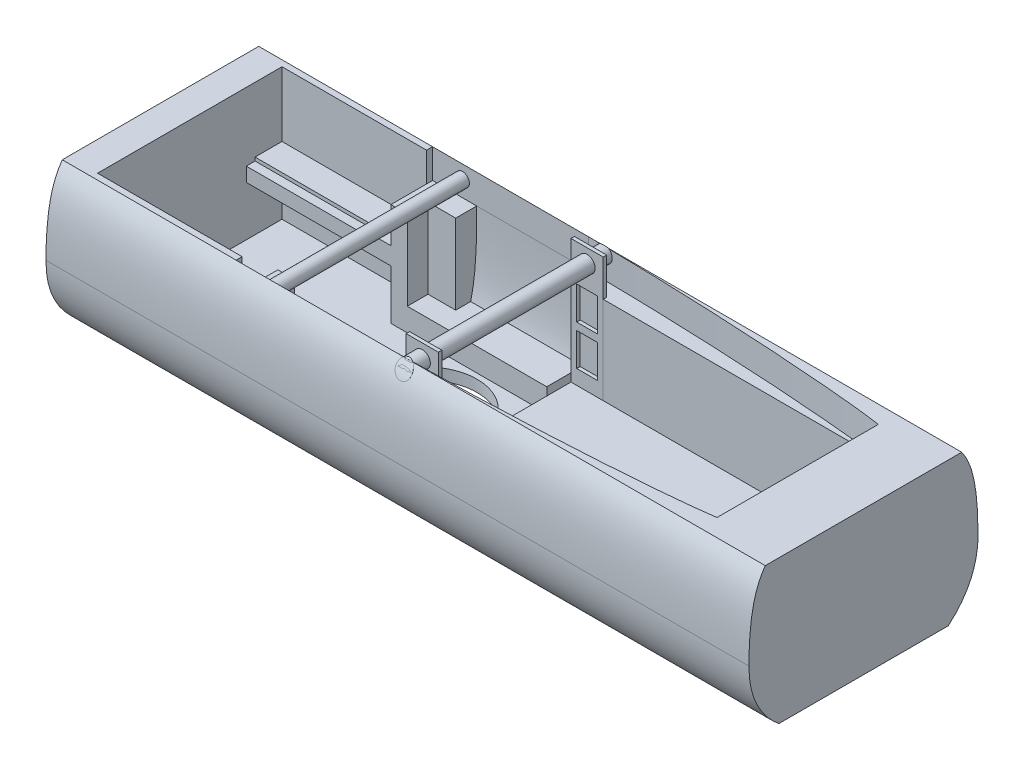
ISO-10303-21;
HEADER;
FILE_DESCRIPTION(('STEP AP214'),'2;1');
FILE_NAME('part.step','',(''),(''),'','','');
FILE_SCHEMA(('AUTOMOTIVE_DESIGN { 1 0 10303 214 1 1 1 1 }'));
ENDSEC;
DATA;
#1=APPLICATION_CONTEXT('core data for automotive mechanical design processes');
#2=APPLICATION_PROTOCOL_DEFINITION('international standard','automotive_design',2000,#1);
#3=PRODUCT_CONTEXT('',#1,'mechanical');
#4=PRODUCT('Part','Part','',(#3));
#5=PRODUCT_RELATED_PRODUCT_CATEGORY('part','',(#4));
#6=PRODUCT_DEFINITION_FORMATION('','',#4);
#7=PRODUCT_DEFINITION_CONTEXT('part definition',#1,'design');
#8=PRODUCT_DEFINITION('design','',#6,#7);
#9=PRODUCT_DEFINITION_SHAPE('','',#8);
#10=(LENGTH_UNIT() NAMED_UNIT(*) SI_UNIT(.MILLI.,.METRE.));
#11=(NAMED_UNIT(*) PLANE_ANGLE_UNIT() SI_UNIT($,.RADIAN.));
#12=(NAMED_UNIT(*) SI_UNIT($,.STERADIAN.) SOLID_ANGLE_UNIT());
#13=UNCERTAINTY_MEASURE_WITH_UNIT(LENGTH_MEASURE(1.E-05),#10,'distance_accuracy_value','');
#14=(GEOMETRIC_REPRESENTATION_CONTEXT(3) GLOBAL_UNCERTAINTY_ASSIGNED_CONTEXT((#13)) GLOBAL_UNIT_ASSIGNED_CONTEXT((#10,
#11,#12)) REPRESENTATION_CONTEXT('',''));
#15=CARTESIAN_POINT('',(0.,0.,0.));
#16=DIRECTION('',(0.,0.,1.));
#17=DIRECTION('',(1.,0.,0.));
#18=AXIS2_PLACEMENT_3D('',#15,#16,#17);
#19=CARTESIAN_POINT('',(-109.2936,103.0064,102.051039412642));
#20=DIRECTION('',(0.,0.,-1.));
#21=DIRECTION('',(-1.,0.,0.));
#22=AXIS2_PLACEMENT_3D('',#19,#20,#21);
#23=CYLINDRICAL_SURFACE('',#22,5.94359999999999);
#24=CARTESIAN_POINT('',(-109.2936,103.0064,-85.2399999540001));
#25=DIRECTION('',(0.,0.,1.));
#26=DIRECTION('',(1.,0.,0.));
#27=AXIS2_PLACEMENT_3D('',#24,#25,#26);
#28=CIRCLE('',#27,5.94359999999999);
#29=CARTESIAN_POINT('',(-103.35,103.0064,-85.2399999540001));
#30=VERTEX_POINT('',#29);
#31=EDGE_CURVE('E97',#30,#30,#28,.T.);
#32=ORIENTED_EDGE('',*,*,#31,.T.);
#33=EDGE_LOOP('',(#32));
#34=FACE_BOUND('',#33,.T.);
#35=CARTESIAN_POINT('',(-109.2936,103.0064,85.2399999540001));
#36=DIRECTION('',(0.,0.,1.));
#37=DIRECTION('',(1.,0.,0.));
#38=AXIS2_PLACEMENT_3D('',#35,#36,#37);
#39=CIRCLE('',#38,5.94359999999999);
#40=CARTESIAN_POINT('',(-103.35,103.0064,85.2399999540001));
#41=VERTEX_POINT('',#40);
#42=EDGE_CURVE('E13',#41,#41,#39,.T.);
#43=ORIENTED_EDGE('',*,*,#42,.F.);
#44=EDGE_LOOP('',(#43));
#45=FACE_BOUND('',#44,.T.);
#46=ADVANCED_FACE('F90',(#34,#45),#23,.T.);
#47=CARTESIAN_POINT('',(-109.2936,103.0064,-85.2399999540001));
#48=DIRECTION('',(0.,0.,1.));
#49=DIRECTION('',(1.,0.,0.));
#50=AXIS2_PLACEMENT_3D('',#47,#48,#49);
#51=PLANE('',#50);
#52=ORIENTED_EDGE('',*,*,#31,.F.);
#53=EDGE_LOOP('',(#52));
#54=FACE_BOUND('',#53,.T.);
#55=ADVANCED_FACE('F105',(#54),#51,.F.);
#56=CARTESIAN_POINT('',(0.,114.6,85.2399999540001));
#57=DIRECTION('',(0.,0.,1.));
#58=DIRECTION('',(1.,0.,0.));
#59=AXIS2_PLACEMENT_3D('',#56,#57,#58);
#60=PLANE('',#59);
#61=ORIENTED_EDGE('',*,*,#42,.T.);
#62=EDGE_LOOP('',(#61));
#63=FACE_BOUND('',#62,.T.);
#64=ADVANCED_FACE('F92',(#63),#60,.T.);
#65=CLOSED_SHELL('',(#46,#55,#64));
#66=MANIFOLD_SOLID_BREP('B2',#65);
#67=CARTESIAN_POINT('',(14.,108.95,124.798989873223));
#68=DIRECTION('',(0.,0.,-1.));
#69=DIRECTION('',(-1.,0.,0.));
#70=AXIS2_PLACEMENT_3D('',#67,#68,#69);
#71=CYLINDRICAL_SURFACE('',#70,7.);
#72=CARTESIAN_POINT('',(7.,108.95,-88.7813522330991));
#73=CARTESIAN_POINT('',(6.99999849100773,109.212756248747,-88.6387594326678));
#74=CARTESIAN_POINT('',(7.01479359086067,109.474266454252,-88.4940019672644));
#75=CARTESIAN_POINT('',(7.07314966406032,109.992474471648,-88.2013987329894));
#76=CARTESIAN_POINT('',(7.1167240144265,110.249169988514,-88.0535515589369));
#77=CARTESIAN_POINT('',(7.23190447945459,110.755674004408,-87.7560671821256));
#78=CARTESIAN_POINT('',(7.30355510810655,111.005470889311,-87.6064275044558));
#79=CARTESIAN_POINT('',(7.47409065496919,111.495545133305,-87.3071990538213));
#80=CARTESIAN_POINT('',(7.57296862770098,111.73582490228,-87.1576102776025));
#81=CARTESIAN_POINT('',(7.78235738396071,112.173618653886,-86.8800042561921));
#82=CARTESIAN_POINT('',(7.88957516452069,112.372571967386,-86.7517625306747));
#83=CARTESIAN_POINT('',(8.12359809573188,112.760406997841,-86.497914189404));
#84=CARTESIAN_POINT('',(8.25040312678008,112.949288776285,-86.3723075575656));
#85=CARTESIAN_POINT('',(8.52304834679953,113.315196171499,-86.1254130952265));
#86=CARTESIAN_POINT('',(8.66885455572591,113.492242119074,-86.0041180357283));
#87=CARTESIAN_POINT('',(8.9792946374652,113.833211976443,-85.7673261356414));
#88=CARTESIAN_POINT('',(9.1439324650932,113.997133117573,-85.6518305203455));
#89=CARTESIAN_POINT('',(9.58432732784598,114.393343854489,-85.3691431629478));
#90=CARTESIAN_POINT('',(9.87267417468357,114.615729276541,-85.207058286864));
#91=CARTESIAN_POINT('',(10.3353163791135,114.916910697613,-84.9841184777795));
#92=CARTESIAN_POINT('',(10.494527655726,115.011894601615,-84.9131778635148));
#93=CARTESIAN_POINT('',(10.8226062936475,115.190109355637,-84.7791279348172));
#94=CARTESIAN_POINT('',(10.9914722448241,115.273341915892,-84.7160174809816));
#95=CARTESIAN_POINT('',(11.3101597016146,115.41452429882,-84.6083179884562));
#96=CARTESIAN_POINT('',(11.4586826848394,115.474387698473,-84.5623822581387));
#97=CARTESIAN_POINT('',(11.7612873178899,115.584309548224,-84.4776704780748));
#98=CARTESIAN_POINT('',(11.9153679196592,115.634369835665,-84.438893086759));
#99=CARTESIAN_POINT('',(12.2282224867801,115.724014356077,-84.3692151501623));
#100=CARTESIAN_POINT('',(12.3869943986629,115.763603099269,-84.3383112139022));
#101=CARTESIAN_POINT('',(12.7083009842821,115.831749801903,-84.2849824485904));
#102=CARTESIAN_POINT('',(12.8708356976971,115.860307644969,-84.2625577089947));
#103=CARTESIAN_POINT('',(13.1992154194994,115.906029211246,-84.2266021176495));
#104=CARTESIAN_POINT('',(13.3650718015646,115.923142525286,-84.2131106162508));
#105=CARTESIAN_POINT('',(13.6980831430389,115.945476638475,-84.195495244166));
#106=CARTESIAN_POINT('',(13.8652381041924,115.950697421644,-84.1913713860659));
#107=CARTESIAN_POINT('',(14.1994475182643,115.949153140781,-84.1925904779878));
#108=CARTESIAN_POINT('',(14.366501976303,115.942388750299,-84.1979328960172));
#109=CARTESIAN_POINT('',(14.6991343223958,115.916995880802,-84.2179554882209));
#110=CARTESIAN_POINT('',(14.8647122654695,115.898367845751,-84.2326353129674));
#111=CARTESIAN_POINT('',(15.1814903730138,115.851296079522,-84.2696331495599));
#112=CARTESIAN_POINT('',(15.3328804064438,115.823638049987,-84.2913388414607));
#113=CARTESIAN_POINT('',(15.632380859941,115.758731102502,-84.3421134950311));
#114=CARTESIAN_POINT('',(15.7804901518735,115.721478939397,-84.3711849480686));
#115=CARTESIAN_POINT('',(16.0725328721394,115.637875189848,-84.4361693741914));
#116=CARTESIAN_POINT('',(16.2164672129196,115.591525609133,-84.4720808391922));
#117=CARTESIAN_POINT('',(16.49957821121,115.490238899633,-84.5501891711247));
#118=CARTESIAN_POINT('',(16.6387530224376,115.435298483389,-84.5923884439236));
#119=CARTESIAN_POINT('',(16.9223986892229,115.312803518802,-84.685971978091));
#120=CARTESIAN_POINT('',(17.0664377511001,115.244599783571,-84.7378156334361));
#121=CARTESIAN_POINT('',(17.347821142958,115.099566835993,-84.8473444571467));
#122=CARTESIAN_POINT('',(17.4851630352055,115.022734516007,-84.9050317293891));
#123=CARTESIAN_POINT('',(17.8865246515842,114.78031446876,-85.0857463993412));
#124=CARTESIAN_POINT('',(18.139984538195,114.602757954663,-85.2164618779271));
#125=CARTESIAN_POINT('',(18.6606821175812,114.185378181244,-85.5185239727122));
#126=CARTESIAN_POINT('',(18.9217542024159,113.940114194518,-85.6929097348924));
#127=CARTESIAN_POINT('',(19.3996824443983,113.418635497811,-86.0554010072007));
#128=CARTESIAN_POINT('',(19.6165077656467,113.142399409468,-86.2435159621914));
#129=CARTESIAN_POINT('',(20.0415554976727,112.509623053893,-86.6640868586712));
#130=CARTESIAN_POINT('',(20.2403641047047,112.147784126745,-86.8981909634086));
#131=CARTESIAN_POINT('',(20.4884466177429,111.584812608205,-87.2514863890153));
#132=CARTESIAN_POINT('',(20.5628165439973,111.393660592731,-87.3696827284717));
#133=CARTESIAN_POINT('',(20.6945512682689,111.005472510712,-87.6060684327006));
#134=CARTESIAN_POINT('',(20.7519138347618,110.808435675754,-87.7242577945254));
#135=CARTESIAN_POINT('',(20.8540290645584,110.389856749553,-87.9714608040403));
#136=CARTESIAN_POINT('',(20.8969702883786,110.167820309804,-88.1003872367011));
#137=CARTESIAN_POINT('',(20.961248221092,109.719584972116,-88.3562098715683));
#138=CARTESIAN_POINT('',(20.9825923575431,109.493387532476,-88.4831067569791));
#139=CARTESIAN_POINT('',(21.0031510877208,109.038261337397,-88.7340660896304));
#140=CARTESIAN_POINT('',(21.0023542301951,108.809331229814,-88.8581270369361));
#141=CARTESIAN_POINT('',(20.9780793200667,108.350751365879,-89.1024122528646));
#142=CARTESIAN_POINT('',(20.9546123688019,108.121102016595,-89.2226383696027));
#143=CARTESIAN_POINT('',(20.8853664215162,107.668207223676,-89.4557637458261));
#144=CARTESIAN_POINT('',(20.8401121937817,107.444935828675,-89.5687678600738));
#145=CARTESIAN_POINT('',(20.7272589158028,107.001596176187,-89.7895589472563));
#146=CARTESIAN_POINT('',(20.6596705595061,106.781526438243,-89.8973483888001));
#147=CARTESIAN_POINT('',(20.5020307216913,106.346721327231,-90.1070094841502));
#148=CARTESIAN_POINT('',(20.4119842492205,106.13198477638,-90.2088824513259));
#149=CARTESIAN_POINT('',(20.2095203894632,105.710159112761,-90.4060248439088));
#150=CARTESIAN_POINT('',(20.097105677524,105.503069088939,-90.501295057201));
#151=CARTESIAN_POINT('',(19.8622021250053,105.11850553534,-90.6757240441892));
#152=CARTESIAN_POINT('',(19.7417297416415,104.940101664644,-90.7555505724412));
#153=CARTESIAN_POINT('',(19.4833608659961,104.593456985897,-90.9088005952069));
#154=CARTESIAN_POINT('',(19.3454665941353,104.425214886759,-90.9822249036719));
#155=CARTESIAN_POINT('',(19.0530822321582,104.100875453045,-91.12220731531));
#156=CARTESIAN_POINT('',(18.8986005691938,103.944772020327,-91.1887688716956));
#157=CARTESIAN_POINT('',(18.574014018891,103.646514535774,-91.3146674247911));
#158=CARTESIAN_POINT('',(18.4039106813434,103.504359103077,-91.3740051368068));
#159=CARTESIAN_POINT('',(18.0675388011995,103.249562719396,-91.479413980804));
#160=CARTESIAN_POINT('',(17.9026586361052,103.135390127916,-91.5262213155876));
#161=CARTESIAN_POINT('',(17.562493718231,102.920982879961,-91.6135022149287));
#162=CARTESIAN_POINT('',(17.3872099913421,102.820746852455,-91.6539764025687));
#163=CARTESIAN_POINT('',(17.0275905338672,102.635365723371,-91.7283833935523));
#164=CARTESIAN_POINT('',(16.8432581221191,102.550215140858,-91.7623185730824));
#165=CARTESIAN_POINT('',(16.4669310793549,102.395947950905,-91.8235007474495));
#166=CARTESIAN_POINT('',(16.2749368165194,102.326830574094,-91.8507480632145));
#167=CARTESIAN_POINT('',(15.8988497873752,102.209797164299,-91.8967153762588));
#168=CARTESIAN_POINT('',(15.7151757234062,102.160717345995,-91.9159062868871));
#169=CARTESIAN_POINT('',(15.343944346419,102.07759226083,-91.9483317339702));
#170=CARTESIAN_POINT('',(15.1563872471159,102.043546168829,-91.9615665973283));
#171=CARTESIAN_POINT('',(14.7788369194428,101.99085224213,-91.9820236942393));
#172=CARTESIAN_POINT('',(14.5888441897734,101.972201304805,-91.9892471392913));
#173=CARTESIAN_POINT('',(14.2078364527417,101.950484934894,-91.9976560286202));
#174=CARTESIAN_POINT('',(14.0168214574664,101.947419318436,-91.998841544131));
#175=CARTESIAN_POINT('',(13.6417422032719,101.956743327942,-91.9952326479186));
#176=CARTESIAN_POINT('',(13.4576627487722,101.96861022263,-91.990640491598));
#177=CARTESIAN_POINT('',(13.0911749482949,102.006802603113,-91.9758336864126));
#178=CARTESIAN_POINT('',(12.9087671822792,102.033132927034,-91.9656171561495));
#179=CARTESIAN_POINT('',(12.5470262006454,102.09998606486,-91.9396031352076));
#180=CARTESIAN_POINT('',(12.3676922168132,102.140505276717,-91.9238070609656));
#181=CARTESIAN_POINT('',(12.0132912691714,102.235341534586,-91.8866941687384));
#182=CARTESIAN_POINT('',(11.8382244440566,102.289659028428,-91.8653771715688));
#183=CARTESIAN_POINT('',(11.4933863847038,102.411623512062,-91.8172830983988));
#184=CARTESIAN_POINT('',(11.3236202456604,102.47928289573,-91.7905009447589));
#185=CARTESIAN_POINT('',(10.9906596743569,102.627258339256,-91.7315929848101));
#186=CARTESIAN_POINT('',(10.8274653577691,102.707574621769,-91.6994670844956));
#187=CARTESIAN_POINT('',(10.5086891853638,102.880107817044,-91.6300024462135));
#188=CARTESIAN_POINT('',(10.3531062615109,102.972323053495,-91.5926644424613));
#189=CARTESIAN_POINT('',(10.0503884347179,103.16786796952,-91.5129047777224));
#190=CARTESIAN_POINT('',(9.90325653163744,103.271201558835,-91.4704813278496));
#191=CARTESIAN_POINT('',(9.61363238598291,103.491614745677,-91.3792557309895));
#192=CARTESIAN_POINT('',(9.47144989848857,103.60903369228,-91.3302901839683));
#193=CARTESIAN_POINT('',(9.19772304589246,103.853741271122,-91.2273100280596));
#194=CARTESIAN_POINT('',(9.06618259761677,103.981033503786,-91.1732935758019));
#195=CARTESIAN_POINT('',(8.81443577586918,104.24435459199,-91.0604562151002));
#196=CARTESIAN_POINT('',(8.69422813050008,104.380382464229,-91.0016358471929));
#197=CARTESIAN_POINT('',(8.46558631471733,104.660138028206,-90.8794058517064));
#198=CARTESIAN_POINT('',(8.35715654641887,104.803868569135,-90.81599452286));
#199=CARTESIAN_POINT('',(8.14601429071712,105.107198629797,-90.6807057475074));
#200=CARTESIAN_POINT('',(8.04409787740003,105.267226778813,-90.6085464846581));
#201=CARTESIAN_POINT('',(7.854331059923,105.593456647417,-90.4596531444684));
#202=CARTESIAN_POINT('',(7.76648614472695,105.759660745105,-90.3829172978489));
#203=CARTESIAN_POINT('',(7.6051227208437,106.09685206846,-90.2252734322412));
#204=CARTESIAN_POINT('',(7.53159710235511,106.267836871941,-90.1443675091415));
#205=CARTESIAN_POINT('',(7.39886528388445,106.613479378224,-89.9787019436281));
#206=CARTESIAN_POINT('',(7.33966322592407,106.788138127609,-89.8939411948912));
#207=CARTESIAN_POINT('',(7.19101395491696,107.290619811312,-89.6468540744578));
#208=CARTESIAN_POINT('',(7.11902443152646,107.62163802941,-89.4802084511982));
#209=CARTESIAN_POINT('',(7.02350287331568,108.285762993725,-89.1373092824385));
#210=CARTESIAN_POINT('',(7.00000190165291,108.618870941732,-88.9610496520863));
#211=CARTESIAN_POINT('',(7.,108.95,-88.7813522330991));
#212=B_SPLINE_CURVE_WITH_KNOTS('',3,(#72,#73,#74,#75,#76,#77,#78,#79,#80,#81,#82,#83,#84,#85,
#86,#87,#88,#89,#90,#91,#92,#93,#94,#95,#96,#97,#98,#99,#100,#101,#102,#103,#104,#105,#106,#107,
#108,#109,#110,#111,#112,#113,#114,#115,#116,#117,#118,#119,#120,#121,#122,#123,#124,#125,#126,
#127,#128,#129,#130,#131,#132,#133,#134,#135,#136,#137,#138,#139,#140,#141,#142,#143,#144,#145,
#146,#147,#148,#149,#150,#151,#152,#153,#154,#155,#156,#157,#158,#159,#160,#161,#162,#163,#164,
#165,#166,#167,#168,#169,#170,#171,#172,#173,#174,#175,#176,#177,#178,#179,#180,#181,#182,#183,
#184,#185,#186,#187,#188,#189,#190,#191,#192,#193,#194,#195,#196,#197,#198,#199,#200,#201,#202,
#203,#204,#205,#206,#207,#208,#209,#210,#211),.UNSPECIFIED.,.T.,.F.,(4,2,2,2,2,2,2,2,2,2,2,2,2,
2,2,2,2,2,2,2,2,2,2,2,2,2,2,2,2,2,2,2,2,2,2,2,2,2,2,2,2,2,2,2,2,2,2,2,2,2,2,2,2,2,2,2,2,2,2,2,2,
2,2,2,2,2,2,2,2,4),(0.,0.896399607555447,1.79321616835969,2.69146039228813,3.58947569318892,
4.36813104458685,5.14678164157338,5.9240584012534,6.70149869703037,7.89167486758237,
8.48660515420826,9.08144876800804,9.5807333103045,10.0799241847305,10.578899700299,
11.0778804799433,11.5790448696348,12.0802099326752,12.581346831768,13.0824649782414,
13.5482096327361,14.0141120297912,14.4799118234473,14.9458903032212,15.4481624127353,
15.9506160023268,16.9551691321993,18.1460640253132,19.3377860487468,20.7553039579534,
21.4649518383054,22.1746927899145,22.9547232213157,23.7344852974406,24.5146506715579,
25.2944341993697,26.0563101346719,26.817821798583,27.5791637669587,28.3404147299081,
29.0282656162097,29.7160289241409,30.403444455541,31.090791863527,31.7078126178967,
32.3247726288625,32.9415080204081,33.5582138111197,34.1307578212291,34.703270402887,
35.275667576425,35.8480579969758,36.4009572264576,36.9540415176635,37.506985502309,
38.0599474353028,38.6134254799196,39.1669132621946,39.7203231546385,40.2739282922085,
40.8456639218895,41.4176090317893,41.989489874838,42.5615837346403,43.1698824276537,
43.7784178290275,44.3866503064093,44.995058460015,46.1239906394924,47.2536458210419),.UNSPECIFIED.);
#213=CARTESIAN_POINT('',(7.,108.95,-88.7813522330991));
#214=VERTEX_POINT('',#213);
#215=EDGE_CURVE('E152',#214,#214,#212,.T.);
#216=ORIENTED_EDGE('',*,*,#215,.F.);
#217=EDGE_LOOP('',(#216));
#218=FACE_BOUND('',#217,.T.);
#219=CARTESIAN_POINT('',(7.,108.95,88.7813522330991));
#220=CARTESIAN_POINT('',(6.99999971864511,108.742508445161,88.8939556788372));
#221=CARTESIAN_POINT('',(7.00922667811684,108.534280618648,89.0051904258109));
#222=CARTESIAN_POINT('',(7.04650127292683,108.117810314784,89.2242450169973));
#223=CARTESIAN_POINT('',(7.07454067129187,107.90956788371,89.3320663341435));
#224=CARTESIAN_POINT('',(7.14975203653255,107.494457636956,89.5437402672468));
#225=CARTESIAN_POINT('',(7.19692784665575,107.28759010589,89.6475920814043));
#226=CARTESIAN_POINT('',(7.31060174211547,106.877006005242,89.8506589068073));
#227=CARTESIAN_POINT('',(7.37709182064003,106.673288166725,89.9498758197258));
#228=CARTESIAN_POINT('',(7.52986841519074,106.269665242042,90.1436286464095));
#229=CARTESIAN_POINT('',(7.61625431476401,106.069784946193,90.2381380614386));
#230=CARTESIAN_POINT('',(7.80848806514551,105.676931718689,90.4213161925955));
#231=CARTESIAN_POINT('',(7.91432711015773,105.483955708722,90.5099875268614));
#232=CARTESIAN_POINT('',(8.14517150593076,105.106842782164,90.6809901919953));
#233=CARTESIAN_POINT('',(8.2701767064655,104.922705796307,90.7633215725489));
#234=CARTESIAN_POINT('',(8.53877468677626,104.565372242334,90.921125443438));
#235=CARTESIAN_POINT('',(8.68236552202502,104.39217453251,90.9965986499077));
#236=CARTESIAN_POINT('',(8.97389750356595,104.073447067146,91.1339137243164));
#237=CARTESIAN_POINT('',(9.12035397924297,103.926822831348,91.1963705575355));
#238=CARTESIAN_POINT('',(9.42714012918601,103.646022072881,91.3148485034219));
#239=CARTESIAN_POINT('',(9.58746835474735,103.511844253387,91.3708702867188));
#240=CARTESIAN_POINT('',(9.92084360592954,103.257511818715,91.4761595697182));
#241=CARTESIAN_POINT('',(10.0938850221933,103.137351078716,91.5254300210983));
#242=CARTESIAN_POINT('',(10.4514427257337,102.912422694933,91.6169797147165));
#243=CARTESIAN_POINT('',(10.6359581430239,102.807653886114,91.6592594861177));
#244=CARTESIAN_POINT('',(10.9982911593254,102.623281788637,91.7332029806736));
#245=CARTESIAN_POINT('',(11.1752731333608,102.542276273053,91.7654730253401));
#246=CARTESIAN_POINT('',(11.536243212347,102.395010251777,91.8238663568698));
#247=CARTESIAN_POINT('',(11.7202308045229,102.328748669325,91.8499900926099));
#248=CARTESIAN_POINT('',(12.0937719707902,102.211706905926,91.8959695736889));
#249=CARTESIAN_POINT('',(12.2833239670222,102.160922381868,91.9158270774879));
#250=CARTESIAN_POINT('',(12.6665582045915,102.07537456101,91.9491960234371));
#251=CARTESIAN_POINT('',(12.8602403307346,102.04061081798,91.9627076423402));
#252=CARTESIAN_POINT('',(13.2399497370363,101.988887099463,91.982785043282));
#253=CARTESIAN_POINT('',(13.4258461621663,101.971089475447,91.9896777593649));
#254=CARTESIAN_POINT('',(13.7985882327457,101.950409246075,91.9976852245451));
#255=CARTESIAN_POINT('',(13.9854338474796,101.947526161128,91.9988001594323));
#256=CARTESIAN_POINT('',(14.3586768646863,101.956703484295,91.9952480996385));
#257=CARTESIAN_POINT('',(14.545074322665,101.968761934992,91.9905818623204));
#258=CARTESIAN_POINT('',(14.9160797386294,102.007695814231,91.97548720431));
#259=CARTESIAN_POINT('',(15.1006876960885,102.034571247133,91.9650587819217));
#260=CARTESIAN_POINT('',(15.4638260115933,102.102315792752,91.9386952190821));
#261=CARTESIAN_POINT('',(15.6424063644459,102.14295289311,91.9228513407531));
#262=CARTESIAN_POINT('',(15.9953656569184,102.237926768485,91.8856802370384));
#263=CARTESIAN_POINT('',(16.16974316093,102.29226815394,91.8643511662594));
#264=CARTESIAN_POINT('',(16.5130300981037,102.414110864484,91.8162992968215));
#265=CARTESIAN_POINT('',(16.6819405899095,102.481609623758,91.7895775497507));
#266=CARTESIAN_POINT('',(17.0132450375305,102.629142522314,91.7308399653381));
#267=CARTESIAN_POINT('',(17.1756386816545,102.709177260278,91.6988238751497));
#268=CARTESIAN_POINT('',(17.4956557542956,102.882539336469,91.6290213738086));
#269=CARTESIAN_POINT('',(17.6531474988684,102.976073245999,91.5911444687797));
#270=CARTESIAN_POINT('',(17.9593984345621,103.174495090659,91.5101914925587));
#271=CARTESIAN_POINT('',(18.1081573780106,103.279383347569,91.467115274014));
#272=CARTESIAN_POINT('',(18.3960975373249,103.49957136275,91.375940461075));
#273=CARTESIAN_POINT('',(18.535279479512,103.614870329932,91.3278422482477));
#274=CARTESIAN_POINT('',(18.8034135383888,103.854942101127,91.226796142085));
#275=CARTESIAN_POINT('',(18.9323620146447,103.979718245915,91.1738465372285));
#276=CARTESIAN_POINT('',(19.1853629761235,104.243933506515,91.0606474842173));
#277=CARTESIAN_POINT('',(19.3088771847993,104.383789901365,91.0001688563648));
#278=CARTESIAN_POINT('',(19.5434561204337,104.671615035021,90.8743684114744));
#279=CARTESIAN_POINT('',(19.6545162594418,104.819586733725,90.8090448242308));
#280=CARTESIAN_POINT('',(19.8637345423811,105.12240481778,90.6738541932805));
#281=CARTESIAN_POINT('',(19.9618927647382,105.277251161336,90.6039871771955));
#282=CARTESIAN_POINT('',(20.1450396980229,105.592657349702,90.4600015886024));
#283=CARTESIAN_POINT('',(20.2300272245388,105.753217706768,90.3858826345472));
#284=CARTESIAN_POINT('',(20.3927178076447,106.091495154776,90.2278248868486));
#285=CARTESIAN_POINT('',(20.469350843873,106.269579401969,90.1435698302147));
#286=CARTESIAN_POINT('',(20.6070682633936,106.629694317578,89.9708906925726));
#287=CARTESIAN_POINT('',(20.6681515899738,106.811725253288,89.8824663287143));
#288=CARTESIAN_POINT('',(20.7748155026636,107.178461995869,89.7018596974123));
#289=CARTESIAN_POINT('',(20.8203944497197,107.363168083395,89.6096770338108));
#290=CARTESIAN_POINT('',(20.896189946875,107.734098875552,89.4219606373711));
#291=CARTESIAN_POINT('',(20.9264007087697,107.920324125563,89.3264256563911));
#292=CARTESIAN_POINT('',(20.973824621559,108.311124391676,89.1231058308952));
#293=CARTESIAN_POINT('',(20.9895008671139,108.515734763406,89.0150289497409));
#294=CARTESIAN_POINT('',(21.0029336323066,108.924073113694,88.7959770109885));
#295=CARTESIAN_POINT('',(21.0006832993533,109.127800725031,88.6850008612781));
#296=CARTESIAN_POINT('',(20.9786268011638,109.533046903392,88.4608146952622));
#297=CARTESIAN_POINT('',(20.9588213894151,109.734565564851,88.3476047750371));
#298=CARTESIAN_POINT('',(20.9020403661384,110.134320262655,88.1195595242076));
#299=CARTESIAN_POINT('',(20.8650586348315,110.332555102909,88.0047236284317));
#300=CARTESIAN_POINT('',(20.7701815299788,110.742434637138,87.7636610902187));
#301=CARTESIAN_POINT('',(20.7106908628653,110.953660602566,87.6373477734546));
#302=CARTESIAN_POINT('',(20.5721996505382,111.369553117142,87.3845891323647));
#303=CARTESIAN_POINT('',(20.4931975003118,111.574219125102,87.2581437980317));
#304=CARTESIAN_POINT('',(20.3160148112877,111.975920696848,87.0060352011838));
#305=CARTESIAN_POINT('',(20.2178145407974,112.172948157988,86.8803728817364));
#306=CARTESIAN_POINT('',(20.0026608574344,112.557862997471,86.6311250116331));
#307=CARTESIAN_POINT('',(19.8857081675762,112.745750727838,86.5075393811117));
#308=CARTESIAN_POINT('',(19.6294848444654,113.116684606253,86.2599930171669));
#309=CARTESIAN_POINT('',(19.4896389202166,113.299404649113,86.1361374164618));
#310=CARTESIAN_POINT('',(19.1906603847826,113.652181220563,85.8936285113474));
#311=CARTESIAN_POINT('',(19.0315248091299,113.822235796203,85.7749760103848));
#312=CARTESIAN_POINT('',(18.6946534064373,114.147593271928,85.5449956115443));
#313=CARTESIAN_POINT('',(18.5169501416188,114.302921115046,85.4336554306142));
#314=CARTESIAN_POINT('',(18.1432839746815,114.597094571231,85.220302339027));
#315=CARTESIAN_POINT('',(17.9473301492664,114.735948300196,85.1182848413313));
#316=CARTESIAN_POINT('',(17.6023362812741,114.954230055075,84.9562608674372));
#317=CARTESIAN_POINT('',(17.4578846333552,115.038627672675,84.8931211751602));
#318=CARTESIAN_POINT('',(17.161230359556,115.197794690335,84.7732834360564));
#319=CARTESIAN_POINT('',(17.0090297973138,115.272566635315,84.7165836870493));
#320=CARTESIAN_POINT('',(16.6975424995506,115.411604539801,84.6105677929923));
#321=CARTESIAN_POINT('',(16.53826050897,115.475877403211,84.5612467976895));
#322=CARTESIAN_POINT('',(16.2132949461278,115.593128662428,84.4708602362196));
#323=CARTESIAN_POINT('',(16.0476111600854,115.64610668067,84.429794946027));
#324=CARTESIAN_POINT('',(15.7095835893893,115.740312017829,84.3565141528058));
#325=CARTESIAN_POINT('',(15.5371986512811,115.781446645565,84.3243685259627));
#326=CARTESIAN_POINT('',(15.1882669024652,115.85069949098,84.2701170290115));
#327=CARTESIAN_POINT('',(15.0117201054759,115.878817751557,84.2480111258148));
#328=CARTESIAN_POINT('',(14.6560799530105,115.921485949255,84.2144238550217));
#329=CARTESIAN_POINT('',(14.4769879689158,115.936042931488,84.2029369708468));
#330=CARTESIAN_POINT('',(14.1178566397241,115.951314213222,84.190885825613));
#331=CARTESIAN_POINT('',(13.937817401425,115.952030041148,84.190320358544));
#332=CARTESIAN_POINT('',(13.5999930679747,115.94035494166,84.199534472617));
#333=CARTESIAN_POINT('',(13.442117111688,115.929518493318,84.2080871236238));
#334=CARTESIAN_POINT('',(13.1281191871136,115.89728213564,84.2334821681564));
#335=CARTESIAN_POINT('',(12.9719972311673,115.875882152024,84.2503246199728));
#336=CARTESIAN_POINT('',(12.6625844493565,115.822842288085,84.2919545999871));
#337=CARTESIAN_POINT('',(12.5092936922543,115.7912021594,84.3167423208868));
#338=CARTESIAN_POINT('',(12.2064884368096,115.718129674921,84.3737851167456));
#339=CARTESIAN_POINT('',(12.0569741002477,115.676696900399,84.4060405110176));
#340=CARTESIAN_POINT('',(11.7613171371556,115.584190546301,84.4777436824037));
#341=CARTESIAN_POINT('',(11.6152121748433,115.533040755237,84.5172482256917));
#342=CARTESIAN_POINT('',(11.3282999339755,115.421917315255,84.6026336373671));
#343=CARTESIAN_POINT('',(11.1874944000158,115.361940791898,84.6485165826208));
#344=CARTESIAN_POINT('',(10.7738939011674,115.169692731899,84.7947373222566));
#345=CARTESIAN_POINT('',(10.509763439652,115.025054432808,84.9036848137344));
#346=CARTESIAN_POINT('',(9.96906154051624,114.683166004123,85.1574695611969));
#347=CARTESIAN_POINT('',(9.69686916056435,114.481240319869,85.3052510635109));
#348=CARTESIAN_POINT('',(9.18954096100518,114.046199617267,85.6175293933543));
#349=CARTESIAN_POINT('',(8.95442875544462,113.813064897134,85.7820367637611));
#350=CARTESIAN_POINT('',(8.47922872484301,113.271526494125,86.1561538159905));
#351=CARTESIAN_POINT('',(8.24757888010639,112.957400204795,86.3681970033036));
#352=CARTESIAN_POINT('',(7.84100069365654,112.299097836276,86.8004996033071));
#353=CARTESIAN_POINT('',(7.66611990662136,111.954896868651,87.0207657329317));
#354=CARTESIAN_POINT('',(7.43538217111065,111.390635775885,87.3716534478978));
#355=CARTESIAN_POINT('',(7.36018672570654,111.177946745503,87.5017672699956));
#356=CARTESIAN_POINT('',(7.23055635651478,110.745960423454,87.761591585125));
#357=CARTESIAN_POINT('',(7.17612629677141,110.526661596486,87.8913019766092));
#358=CARTESIAN_POINT('',(7.08859860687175,110.08299115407,88.1492499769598));
#359=CARTESIAN_POINT('',(7.05550218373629,109.85861925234,88.2774875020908));
#360=CARTESIAN_POINT('',(7.01120841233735,109.406461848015,88.5314874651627));
#361=CARTESIAN_POINT('',(7.00000031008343,109.178678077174,88.6572510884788));
#362=CARTESIAN_POINT('',(7.,108.95,88.7813522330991));
#363=B_SPLINE_CURVE_WITH_KNOTS('',3,(#219,#220,#221,#222,#223,#224,#225,#226,#227,#228,#229,
#230,#231,#232,#233,#234,#235,#236,#237,#238,#239,#240,#241,#242,#243,#244,#245,#246,#247,#248,
#249,#250,#251,#252,#253,#254,#255,#256,#257,#258,#259,#260,#261,#262,#263,#264,#265,#266,#267,
#268,#269,#270,#271,#272,#273,#274,#275,#276,#277,#278,#279,#280,#281,#282,#283,#284,#285,#286,
#287,#288,#289,#290,#291,#292,#293,#294,#295,#296,#297,#298,#299,#300,#301,#302,#303,#304,#305,
#306,#307,#308,#309,#310,#311,#312,#313,#314,#315,#316,#317,#318,#319,#320,#321,#322,#323,#324,
#325,#326,#327,#328,#329,#330,#331,#332,#333,#334,#335,#336,#337,#338,#339,#340,#341,#342,#343,
#344,#345,#346,#347,#348,#349,#350,#351,#352,#353,#354,#355,#356,#357,#358,#359,#360,#361,#362),
.UNSPECIFIED.,.T.,.F.,(4,2,2,2,2,2,2,2,2,2,2,2,2,2,2,2,2,2,2,2,2,2,2,2,2,2,2,2,2,2,2,2,2,2,2,2,
2,2,2,2,2,2,2,2,2,2,2,2,2,2,2,2,2,2,2,2,2,2,2,2,2,2,2,2,2,2,2,2,2,2,2,4),(0.,0.708026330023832,
1.41574285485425,2.12360158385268,2.83116728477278,3.54234716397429,4.2532059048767,
4.96405907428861,5.67483793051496,6.32331157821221,6.971717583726,7.61983919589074,
8.2679117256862,8.85905088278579,9.45014685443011,10.0410768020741,10.6319902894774,
11.1919322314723,11.7518561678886,12.3117067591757,12.8715575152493,13.4224041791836,
13.9734364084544,14.5243612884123,15.0753124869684,15.6358246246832,16.1963526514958,
16.756838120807,17.3175220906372,17.9053186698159,18.4933310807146,19.0813399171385,
19.6694016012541,20.3028946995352,20.9364308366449,21.5700339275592,22.2038754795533,
22.898926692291,23.5942436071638,24.2895306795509,24.9850656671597,25.7438157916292,
26.5026283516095,27.262224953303,28.021792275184,28.8046962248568,29.5877206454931,
30.3693942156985,31.150681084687,31.6866535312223,32.2224839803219,32.7579606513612,
33.2934552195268,33.8330334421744,34.3726098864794,34.9119058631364,35.4511422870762,
35.9260048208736,36.400870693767,36.8757480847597,37.3506457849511,37.8294346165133,
38.3083797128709,39.2657841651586,40.3710567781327,41.4770304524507,42.8045538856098,
44.1331865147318,44.9136647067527,45.6943256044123,46.4750306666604,47.2553520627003),.UNSPECIFIED.);
#364=CARTESIAN_POINT('',(7.,108.95,88.7813522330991));
#365=VERTEX_POINT('',#364);
#366=EDGE_CURVE('E89',#365,#365,#363,.T.);
#367=ORIENTED_EDGE('',*,*,#366,.F.);
#368=EDGE_LOOP('',(#367));
#369=FACE_BOUND('',#368,.T.);
#370=ADVANCED_FACE('F141',(#218,#369),#71,.T.);
#371=CARTESIAN_POINT('',(-286.1,46.1162179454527,-99.3467452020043));
#372=CARTESIAN_POINT('',(-286.1,124.753620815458,-99.2437676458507));
#373=CARTESIAN_POINT('',(-286.1,138.558497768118,-77.2582228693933));
#374=CARTESIAN_POINT('',(-286.1,138.616217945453,0.));
#375=B_SPLINE_CURVE_WITH_KNOTS('',3,(#371,#372,#373,#374),.UNSPECIFIED.,.F.,.F.,(4,4),(0.,1.),.UNSPECIFIED.);
#376=DIRECTION('',(1.,0.,0.));
#377=VECTOR('',#376,1.);
#378=SURFACE_OF_LINEAR_EXTRUSION('',#375,#377);
#379=ORIENTED_EDGE('',*,*,#215,.T.);
#380=EDGE_LOOP('',(#379));
#381=FACE_BOUND('',#380,.T.);
#382=ADVANCED_FACE('F166',(#381),#378,.T.);
#383=CARTESIAN_POINT('',(-286.1,138.616217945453,0.));
#384=CARTESIAN_POINT('',(-286.1,138.558497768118,77.2582228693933));
#385=CARTESIAN_POINT('',(-286.1,124.753620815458,99.2437676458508));
#386=CARTESIAN_POINT('',(-286.1,46.1162179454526,99.3467452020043));
#387=B_SPLINE_CURVE_WITH_KNOTS('',3,(#383,#384,#385,#386),.UNSPECIFIED.,.F.,.F.,(4,4),(0.,1.),.UNSPECIFIED.);
#388=DIRECTION('',(1.,0.,0.));
#389=VECTOR('',#388,1.);
#390=SURFACE_OF_LINEAR_EXTRUSION('',#387,#389);
#391=ORIENTED_EDGE('',*,*,#366,.T.);
#392=EDGE_LOOP('',(#391));
#393=FACE_BOUND('',#392,.T.);
#394=ADVANCED_FACE('F169',(#393),#390,.T.);
#395=CLOSED_SHELL('',(#370,#382,#394));
#396=MANIFOLD_SOLID_BREP('B8',#395);
#397=CARTESIAN_POINT('',(28.,120.95,72.999999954));
#398=DIRECTION('',(0.,0.,-1.));
#399=DIRECTION('',(-1.,0.,0.));
#400=AXIS2_PLACEMENT_3D('',#397,#398,#399);
#401=PLANE('',#400);
#402=DIRECTION('',(1.,0.,0.));
#403=VECTOR('',#402,1.);
#404=CARTESIAN_POINT('',(4.99999999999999,89.2,72.999999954));
#405=LINE('',#404,#403);
#406=CARTESIAN_POINT('',(4.99999999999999,89.2,72.999999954));
#407=VERTEX_POINT('',#406);
#408=CARTESIAN_POINT('',(23.,89.2,72.999999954));
#409=VERTEX_POINT('',#408);
#410=EDGE_CURVE('E339',#407,#409,#405,.T.);
#411=ORIENTED_EDGE('',*,*,#410,.T.);
#412=DIRECTION('',(0.,-1.,0.));
#413=VECTOR('',#412,1.);
#414=CARTESIAN_POINT('',(23.,89.2,72.999999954));
#415=LINE('',#414,#413);
#416=CARTESIAN_POINT('',(23.,60.625,72.999999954));
#417=VERTEX_POINT('',#416);
#418=EDGE_CURVE('E230',#409,#417,#415,.T.);
#419=ORIENTED_EDGE('',*,*,#418,.T.);
#420=DIRECTION('',(-1.,0.,0.));
#421=VECTOR('',#420,1.);
#422=CARTESIAN_POINT('',(4.99999999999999,60.625,72.999999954));
#423=LINE('',#422,#421);
#424=CARTESIAN_POINT('',(4.99999999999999,60.625,72.999999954));
#425=VERTEX_POINT('',#424);
#426=EDGE_CURVE('E323',#417,#425,#423,.T.);
#427=ORIENTED_EDGE('',*,*,#426,.T.);
#428=DIRECTION('',(0.,1.,0.));
#429=VECTOR('',#428,1.);
#430=CARTESIAN_POINT('',(4.99999999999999,89.2,72.999999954));
#431=LINE('',#430,#429);
#432=EDGE_CURVE('E333',#425,#407,#431,.T.);
#433=ORIENTED_EDGE('',*,*,#432,.T.);
#434=EDGE_LOOP('',(#411,#419,#427,#433));
#435=FACE_BOUND('',#434,.T.);
#436=DIRECTION('',(1.,0.,0.));
#437=VECTOR('',#436,1.);
#438=CARTESIAN_POINT('',(4.99999999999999,54.275,72.999999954));
#439=LINE('',#438,#437);
#440=CARTESIAN_POINT('',(4.99999999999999,54.275,72.999999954));
#441=VERTEX_POINT('',#440);
#442=CARTESIAN_POINT('',(23.,54.275,72.999999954));
#443=VERTEX_POINT('',#442);
#444=EDGE_CURVE('E362',#441,#443,#439,.T.);
#445=ORIENTED_EDGE('',*,*,#444,.T.);
#446=DIRECTION('',(0.,-1.,0.));
#447=VECTOR('',#446,1.);
#448=CARTESIAN_POINT('',(23.,54.275,72.999999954));
#449=LINE('',#448,#447);
#450=CARTESIAN_POINT('',(23.,25.7,72.999999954));
#451=VERTEX_POINT('',#450);
#452=EDGE_CURVE('E238',#443,#451,#449,.T.);
#453=ORIENTED_EDGE('',*,*,#452,.T.);
#454=DIRECTION('',(-1.,0.,0.));
#455=VECTOR('',#454,1.);
#456=CARTESIAN_POINT('',(5.,25.7,72.999999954));
#457=LINE('',#456,#455);
#458=CARTESIAN_POINT('',(5.,25.7,72.999999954));
#459=VERTEX_POINT('',#458);
#460=EDGE_CURVE('E363',#451,#459,#457,.T.);
#461=ORIENTED_EDGE('',*,*,#460,.T.);
#462=DIRECTION('',(0.,1.,0.));
#463=VECTOR('',#462,1.);
#464=CARTESIAN_POINT('',(4.99999999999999,54.275,72.999999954));
#465=LINE('',#464,#463);
#466=EDGE_CURVE('E358',#459,#441,#465,.T.);
#467=ORIENTED_EDGE('',*,*,#466,.T.);
#468=EDGE_LOOP('',(#445,#453,#461,#467));
#469=FACE_BOUND('',#468,.T.);
#470=DIRECTION('',(1.,0.,0.));
#471=VECTOR('',#470,1.);
#472=CARTESIAN_POINT('',(28.,13.,72.999999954));
#473=LINE('',#472,#471);
#474=CARTESIAN_POINT('',(0.,13.,72.999999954));
#475=VERTEX_POINT('',#474);
#476=CARTESIAN_POINT('',(28.,13.,72.999999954));
#477=VERTEX_POINT('',#476);
#478=EDGE_CURVE('E352',#475,#477,#473,.T.);
#479=ORIENTED_EDGE('',*,*,#478,.T.);
#480=DIRECTION('',(0.,-1.,0.));
#481=VECTOR('',#480,1.);
#482=CARTESIAN_POINT('',(28.,120.95,72.999999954));
#483=LINE('',#482,#481);
#484=CARTESIAN_POINT('',(28.,120.95,72.999999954));
#485=VERTEX_POINT('',#484);
#486=EDGE_CURVE('E410',#485,#477,#483,.T.);
#487=ORIENTED_EDGE('',*,*,#486,.F.);
#488=DIRECTION('',(1.,0.,0.));
#489=VECTOR('',#488,1.);
#490=CARTESIAN_POINT('',(28.,120.95,72.999999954));
#491=LINE('',#490,#489);
#492=CARTESIAN_POINT('',(0.,120.95,72.999999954));
#493=VERTEX_POINT('',#492);
#494=EDGE_CURVE('E377',#493,#485,#491,.T.);
#495=ORIENTED_EDGE('',*,*,#494,.F.);
#496=DIRECTION('',(0.,-1.,0.));
#497=VECTOR('',#496,1.);
#498=CARTESIAN_POINT('',(0.,120.95,72.999999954));
#499=LINE('',#498,#497);
#500=EDGE_CURVE('E387',#493,#475,#499,.T.);
#501=ORIENTED_EDGE('',*,*,#500,.T.);
#502=EDGE_LOOP('',(#479,#487,#495,#501));
#503=FACE_BOUND('',#502,.T.);
#504=ADVANCED_FACE('F215',(#435,#469,#503),#401,.F.);
#505=CARTESIAN_POINT('',(28.,120.95,72.999999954));
#506=DIRECTION('',(-1.,0.,0.));
#507=DIRECTION('',(0.,0.,1.));
#508=AXIS2_PLACEMENT_3D('',#505,#506,#507);
#509=PLANE('',#508);
#510=DIRECTION('',(0.,0.,-1.));
#511=VECTOR('',#510,1.);
#512=CARTESIAN_POINT('',(28.,13.,72.999999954));
#513=LINE('',#512,#511);
#514=CARTESIAN_POINT('',(28.,13.,69.999999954));
#515=VERTEX_POINT('',#514);
#516=EDGE_CURVE('E391',#477,#515,#513,.T.);
#517=ORIENTED_EDGE('',*,*,#516,.T.);
#518=DIRECTION('',(0.,-1.,0.));
#519=VECTOR('',#518,1.);
#520=CARTESIAN_POINT('',(28.,120.95,69.999999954));
#521=LINE('',#520,#519);
#522=CARTESIAN_POINT('',(28.,120.95,69.999999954));
#523=VERTEX_POINT('',#522);
#524=EDGE_CURVE('E406',#523,#515,#521,.T.);
#525=ORIENTED_EDGE('',*,*,#524,.F.);
#526=DIRECTION('',(0.,0.,-1.));
#527=VECTOR('',#526,1.);
#528=CARTESIAN_POINT('',(28.,120.95,72.999999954));
#529=LINE('',#528,#527);
#530=EDGE_CURVE('E380',#485,#523,#529,.T.);
#531=ORIENTED_EDGE('',*,*,#530,.F.);
#532=ORIENTED_EDGE('',*,*,#486,.T.);
#533=EDGE_LOOP('',(#517,#525,#531,#532));
#534=FACE_BOUND('',#533,.T.);
#535=ADVANCED_FACE('F455',(#534),#509,.F.);
#536=CARTESIAN_POINT('',(28.,120.95,69.999999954));
#537=DIRECTION('',(0.,0.,1.));
#538=DIRECTION('',(1.,0.,0.));
#539=AXIS2_PLACEMENT_3D('',#536,#537,#538);
#540=PLANE('',#539);
#541=DIRECTION('',(1.,0.,0.));
#542=VECTOR('',#541,1.);
#543=CARTESIAN_POINT('',(28.,60.625,69.999999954));
#544=LINE('',#543,#542);
#545=CARTESIAN_POINT('',(4.99999999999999,60.625,69.999999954));
#546=VERTEX_POINT('',#545);
#547=CARTESIAN_POINT('',(23.,60.625,69.999999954));
#548=VERTEX_POINT('',#547);
#549=EDGE_CURVE('E223',#546,#548,#544,.T.);
#550=ORIENTED_EDGE('',*,*,#549,.T.);
#551=DIRECTION('',(0.,1.,0.));
#552=VECTOR('',#551,1.);
#553=CARTESIAN_POINT('',(23.,120.95,69.999999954));
#554=LINE('',#553,#552);
#555=CARTESIAN_POINT('',(23.,89.2,69.999999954));
#556=VERTEX_POINT('',#555);
#557=EDGE_CURVE('E139',#548,#556,#554,.T.);
#558=ORIENTED_EDGE('',*,*,#557,.T.);
#559=DIRECTION('',(-1.,0.,0.));
#560=VECTOR('',#559,1.);
#561=CARTESIAN_POINT('',(28.,89.2,69.999999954));
#562=LINE('',#561,#560);
#563=CARTESIAN_POINT('',(4.99999999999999,89.2,69.999999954));
#564=VERTEX_POINT('',#563);
#565=EDGE_CURVE('E429',#556,#564,#562,.T.);
#566=ORIENTED_EDGE('',*,*,#565,.T.);
#567=DIRECTION('',(0.,-1.,0.));
#568=VECTOR('',#567,1.);
#569=CARTESIAN_POINT('',(4.99999999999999,120.95,69.999999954));
#570=LINE('',#569,#568);
#571=EDGE_CURVE('E433',#564,#546,#570,.T.);
#572=ORIENTED_EDGE('',*,*,#571,.T.);
#573=EDGE_LOOP('',(#550,#558,#566,#572));
#574=FACE_BOUND('',#573,.T.);
#575=DIRECTION('',(1.,0.,0.));
#576=VECTOR('',#575,1.);
#577=CARTESIAN_POINT('',(28.,25.7,69.999999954));
#578=LINE('',#577,#576);
#579=CARTESIAN_POINT('',(5.,25.7,69.999999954));
#580=VERTEX_POINT('',#579);
#581=CARTESIAN_POINT('',(23.,25.7,69.999999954));
#582=VERTEX_POINT('',#581);
#583=EDGE_CURVE('E421',#580,#582,#578,.T.);
#584=ORIENTED_EDGE('',*,*,#583,.T.);
#585=DIRECTION('',(0.,1.,0.));
#586=VECTOR('',#585,1.);
#587=CARTESIAN_POINT('',(23.,120.95,69.999999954));
#588=LINE('',#587,#586);
#589=CARTESIAN_POINT('',(23.,54.275,69.999999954));
#590=VERTEX_POINT('',#589);
#591=EDGE_CURVE('E425',#582,#590,#588,.T.);
#592=ORIENTED_EDGE('',*,*,#591,.T.);
#593=DIRECTION('',(-1.,0.,0.));
#594=VECTOR('',#593,1.);
#595=CARTESIAN_POINT('',(28.,54.275,69.999999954));
#596=LINE('',#595,#594);
#597=CARTESIAN_POINT('',(4.99999999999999,54.275,69.999999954));
#598=VERTEX_POINT('',#597);
#599=EDGE_CURVE('E414',#590,#598,#596,.T.);
#600=ORIENTED_EDGE('',*,*,#599,.T.);
#601=DIRECTION('',(0.,-1.,0.));
#602=VECTOR('',#601,1.);
#603=CARTESIAN_POINT('',(4.99999999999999,120.95,69.999999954));
#604=LINE('',#603,#602);
#605=EDGE_CURVE('E417',#598,#580,#604,.T.);
#606=ORIENTED_EDGE('',*,*,#605,.T.);
#607=EDGE_LOOP('',(#584,#592,#600,#606));
#608=FACE_BOUND('',#607,.T.);
#609=DIRECTION('',(-1.,0.,0.));
#610=VECTOR('',#609,1.);
#611=CARTESIAN_POINT('',(28.,13.,69.999999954));
#612=LINE('',#611,#610);
#613=CARTESIAN_POINT('',(0.,13.,69.999999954));
#614=VERTEX_POINT('',#613);
#615=EDGE_CURVE('E394',#515,#614,#612,.T.);
#616=ORIENTED_EDGE('',*,*,#615,.T.);
#617=DIRECTION('',(0.,-1.,0.));
#618=VECTOR('',#617,1.);
#619=CARTESIAN_POINT('',(0.,120.95,69.999999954));
#620=LINE('',#619,#618);
#621=CARTESIAN_POINT('',(0.,120.95,69.999999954));
#622=VERTEX_POINT('',#621);
#623=EDGE_CURVE('E402',#622,#614,#620,.T.);
#624=ORIENTED_EDGE('',*,*,#623,.F.);
#625=DIRECTION('',(-1.,0.,0.));
#626=VECTOR('',#625,1.);
#627=CARTESIAN_POINT('',(28.,120.95,69.999999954));
#628=LINE('',#627,#626);
#629=EDGE_CURVE('E383',#523,#622,#628,.T.);
#630=ORIENTED_EDGE('',*,*,#629,.F.);
#631=ORIENTED_EDGE('',*,*,#524,.T.);
#632=EDGE_LOOP('',(#616,#624,#630,#631));
#633=FACE_BOUND('',#632,.T.);
#634=ADVANCED_FACE('F436',(#574,#608,#633),#540,.F.);
#635=CARTESIAN_POINT('',(0.,120.95,72.999999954));
#636=DIRECTION('',(1.,0.,0.));
#637=DIRECTION('',(0.,0.,-1.));
#638=AXIS2_PLACEMENT_3D('',#635,#636,#637);
#639=PLANE('',#638);
#640=DIRECTION('',(0.,0.,1.));
#641=VECTOR('',#640,1.);
#642=CARTESIAN_POINT('',(0.,13.,72.999999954));
#643=LINE('',#642,#641);
#644=EDGE_CURVE('E381',#614,#475,#643,.T.);
#645=ORIENTED_EDGE('',*,*,#644,.T.);
#646=ORIENTED_EDGE('',*,*,#500,.F.);
#647=DIRECTION('',(0.,0.,1.));
#648=VECTOR('',#647,1.);
#649=CARTESIAN_POINT('',(0.,120.95,72.999999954));
#650=LINE('',#649,#648);
#651=EDGE_CURVE('E385',#622,#493,#650,.T.);
#652=ORIENTED_EDGE('',*,*,#651,.F.);
#653=ORIENTED_EDGE('',*,*,#623,.T.);
#654=EDGE_LOOP('',(#645,#646,#652,#653));
#655=FACE_BOUND('',#654,.T.);
#656=ADVANCED_FACE('F463',(#655),#639,.F.);
#657=CARTESIAN_POINT('',(0.,120.95,0.));
#658=DIRECTION('',(0.,-1.,0.));
#659=DIRECTION('',(0.,0.,-1.));
#660=AXIS2_PLACEMENT_3D('',#657,#658,#659);
#661=PLANE('',#660);
#662=ORIENTED_EDGE('',*,*,#494,.T.);
#663=ORIENTED_EDGE('',*,*,#530,.T.);
#664=ORIENTED_EDGE('',*,*,#629,.T.);
#665=ORIENTED_EDGE('',*,*,#651,.T.);
#666=EDGE_LOOP('',(#662,#663,#664,#665));
#667=FACE_BOUND('',#666,.T.);
#668=ADVANCED_FACE('F468',(#667),#661,.F.);
#669=CARTESIAN_POINT('',(0.,13.,0.));
#670=DIRECTION('',(0.,-1.,0.));
#671=DIRECTION('',(0.,0.,-1.));
#672=AXIS2_PLACEMENT_3D('',#669,#670,#671);
#673=PLANE('',#672);
#674=ORIENTED_EDGE('',*,*,#478,.F.);
#675=ORIENTED_EDGE('',*,*,#644,.F.);
#676=ORIENTED_EDGE('',*,*,#615,.F.);
#677=ORIENTED_EDGE('',*,*,#516,.F.);
#678=EDGE_LOOP('',(#674,#675,#676,#677));
#679=FACE_BOUND('',#678,.T.);
#680=ADVANCED_FACE('F470',(#679),#673,.T.);
#681=CARTESIAN_POINT('',(23.,54.275,-106.771742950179));
#682=DIRECTION('',(1.,0.,0.));
#683=DIRECTION('',(0.,1.,0.));
#684=AXIS2_PLACEMENT_3D('',#681,#682,#683);
#685=PLANE('',#684);
#686=DIRECTION('',(0.,0.,1.));
#687=VECTOR('',#686,1.);
#688=CARTESIAN_POINT('',(23.,25.7,-106.771742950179));
#689=LINE('',#688,#687);
#690=EDGE_CURVE('E343',#582,#451,#689,.T.);
#691=ORIENTED_EDGE('',*,*,#690,.T.);
#692=ORIENTED_EDGE('',*,*,#452,.F.);
#693=DIRECTION('',(0.,0.,1.));
#694=VECTOR('',#693,1.);
#695=CARTESIAN_POINT('',(23.,54.275,-106.771742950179));
#696=LINE('',#695,#694);
#697=EDGE_CURVE('E368',#590,#443,#696,.T.);
#698=ORIENTED_EDGE('',*,*,#697,.F.);
#699=ORIENTED_EDGE('',*,*,#591,.F.);
#700=EDGE_LOOP('',(#691,#692,#698,#699));
#701=FACE_BOUND('',#700,.T.);
#702=ADVANCED_FACE('F473',(#701),#685,.F.);
#703=CARTESIAN_POINT('',(5.,25.7,-106.771742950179));
#704=DIRECTION('',(0.,-1.,0.));
#705=DIRECTION('',(0.,0.,-1.));
#706=AXIS2_PLACEMENT_3D('',#703,#704,#705);
#707=PLANE('',#706);
#708=DIRECTION('',(0.,0.,1.));
#709=VECTOR('',#708,1.);
#710=CARTESIAN_POINT('',(5.,25.7,-106.771742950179));
#711=LINE('',#710,#709);
#712=EDGE_CURVE('E347',#580,#459,#711,.T.);
#713=ORIENTED_EDGE('',*,*,#712,.T.);
#714=ORIENTED_EDGE('',*,*,#460,.F.);
#715=ORIENTED_EDGE('',*,*,#690,.F.);
#716=ORIENTED_EDGE('',*,*,#583,.F.);
#717=EDGE_LOOP('',(#713,#714,#715,#716));
#718=FACE_BOUND('',#717,.T.);
#719=ADVANCED_FACE('F479',(#718),#707,.F.);
#720=CARTESIAN_POINT('',(4.99999999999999,54.275,-106.771742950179));
#721=DIRECTION('',(-1.,0.,0.));
#722=DIRECTION('',(0.,-1.,0.));
#723=AXIS2_PLACEMENT_3D('',#720,#721,#722);
#724=PLANE('',#723);
#725=DIRECTION('',(0.,0.,1.));
#726=VECTOR('',#725,1.);
#727=CARTESIAN_POINT('',(4.99999999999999,54.275,-106.771742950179));
#728=LINE('',#727,#726);
#729=EDGE_CURVE('E374',#598,#441,#728,.T.);
#730=ORIENTED_EDGE('',*,*,#729,.T.);
#731=ORIENTED_EDGE('',*,*,#466,.F.);
#732=ORIENTED_EDGE('',*,*,#712,.F.);
#733=ORIENTED_EDGE('',*,*,#605,.F.);
#734=EDGE_LOOP('',(#730,#731,#732,#733));
#735=FACE_BOUND('',#734,.T.);
#736=ADVANCED_FACE('F449',(#735),#724,.F.);
#737=CARTESIAN_POINT('',(4.99999999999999,54.275,-106.771742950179));
#738=DIRECTION('',(0.,1.,0.));
#739=DIRECTION('',(0.,0.,1.));
#740=AXIS2_PLACEMENT_3D('',#737,#738,#739);
#741=PLANE('',#740);
#742=ORIENTED_EDGE('',*,*,#697,.T.);
#743=ORIENTED_EDGE('',*,*,#444,.F.);
#744=ORIENTED_EDGE('',*,*,#729,.F.);
#745=ORIENTED_EDGE('',*,*,#599,.F.);
#746=EDGE_LOOP('',(#742,#743,#744,#745));
#747=FACE_BOUND('',#746,.T.);
#748=ADVANCED_FACE('F442',(#747),#741,.F.);
#749=CARTESIAN_POINT('',(23.,89.2,-106.771742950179));
#750=DIRECTION('',(1.,0.,0.));
#751=DIRECTION('',(0.,0.,-1.));
#752=AXIS2_PLACEMENT_3D('',#749,#750,#751);
#753=PLANE('',#752);
#754=DIRECTION('',(0.,0.,1.));
#755=VECTOR('',#754,1.);
#756=CARTESIAN_POINT('',(23.,60.625,-106.771742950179));
#757=LINE('',#756,#755);
#758=EDGE_CURVE('E329',#548,#417,#757,.T.);
#759=ORIENTED_EDGE('',*,*,#758,.T.);
#760=ORIENTED_EDGE('',*,*,#418,.F.);
#761=DIRECTION('',(0.,0.,1.));
#762=VECTOR('',#761,1.);
#763=CARTESIAN_POINT('',(23.,89.2,-106.771742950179));
#764=LINE('',#763,#762);
#765=EDGE_CURVE('E356',#556,#409,#764,.T.);
#766=ORIENTED_EDGE('',*,*,#765,.F.);
#767=ORIENTED_EDGE('',*,*,#557,.F.);
#768=EDGE_LOOP('',(#759,#760,#766,#767));
#769=FACE_BOUND('',#768,.T.);
#770=ADVANCED_FACE('F440',(#769),#753,.F.);
#771=CARTESIAN_POINT('',(4.99999999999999,60.625,-106.771742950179));
#772=DIRECTION('',(0.,-1.,0.));
#773=DIRECTION('',(0.,0.,-1.));
#774=AXIS2_PLACEMENT_3D('',#771,#772,#773);
#775=PLANE('',#774);
#776=DIRECTION('',(0.,0.,1.));
#777=VECTOR('',#776,1.);
#778=CARTESIAN_POINT('',(4.99999999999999,60.625,-106.771742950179));
#779=LINE('',#778,#777);
#780=EDGE_CURVE('E318',#546,#425,#779,.T.);
#781=ORIENTED_EDGE('',*,*,#780,.T.);
#782=ORIENTED_EDGE('',*,*,#426,.F.);
#783=ORIENTED_EDGE('',*,*,#758,.F.);
#784=ORIENTED_EDGE('',*,*,#549,.F.);
#785=EDGE_LOOP('',(#781,#782,#783,#784));
#786=FACE_BOUND('',#785,.T.);
#787=ADVANCED_FACE('F320',(#786),#775,.F.);
#788=CARTESIAN_POINT('',(4.99999999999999,89.2,-106.771742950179));
#789=DIRECTION('',(-1.,0.,0.));
#790=DIRECTION('',(0.,-1.,0.));
#791=AXIS2_PLACEMENT_3D('',#788,#789,#790);
#792=PLANE('',#791);
#793=DIRECTION('',(0.,0.,1.));
#794=VECTOR('',#793,1.);
#795=CARTESIAN_POINT('',(4.99999999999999,89.2,-106.771742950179));
#796=LINE('',#795,#794);
#797=EDGE_CURVE('E330',#564,#407,#796,.T.);
#798=ORIENTED_EDGE('',*,*,#797,.T.);
#799=ORIENTED_EDGE('',*,*,#432,.F.);
#800=ORIENTED_EDGE('',*,*,#780,.F.);
#801=ORIENTED_EDGE('',*,*,#571,.F.);
#802=EDGE_LOOP('',(#798,#799,#800,#801));
#803=FACE_BOUND('',#802,.T.);
#804=ADVANCED_FACE('F334',(#803),#792,.F.);
#805=CARTESIAN_POINT('',(4.99999999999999,89.2,-106.771742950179));
#806=DIRECTION('',(0.,1.,0.));
#807=DIRECTION('',(0.,0.,1.));
#808=AXIS2_PLACEMENT_3D('',#805,#806,#807);
#809=PLANE('',#808);
#810=ORIENTED_EDGE('',*,*,#765,.T.);
#811=ORIENTED_EDGE('',*,*,#410,.F.);
#812=ORIENTED_EDGE('',*,*,#797,.F.);
#813=ORIENTED_EDGE('',*,*,#565,.F.);
#814=EDGE_LOOP('',(#810,#811,#812,#813));
#815=FACE_BOUND('',#814,.T.);
#816=ADVANCED_FACE('F439',(#815),#809,.F.);
#817=CLOSED_SHELL('',(#504,#535,#634,#656,#668,#680,#702,#719,#736,#748,#770,#787,#804,#816));
#818=MANIFOLD_SOLID_BREP('B84',#817);
#819=CARTESIAN_POINT('',(28.,120.95,-72.999999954));
#820=DIRECTION('',(-1.,0.,0.));
#821=DIRECTION('',(0.,0.,1.));
#822=AXIS2_PLACEMENT_3D('',#819,#820,#821);
#823=PLANE('',#822);
#824=DIRECTION('',(0.,0.,-1.));
#825=VECTOR('',#824,1.);
#826=CARTESIAN_POINT('',(28.,13.,-72.999999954));
#827=LINE('',#826,#825);
#828=CARTESIAN_POINT('',(28.,13.,-69.999999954));
#829=VERTEX_POINT('',#828);
#830=CARTESIAN_POINT('',(28.,13.,-72.999999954));
#831=VERTEX_POINT('',#830);
#832=EDGE_CURVE('E694',#829,#831,#827,.T.);
#833=ORIENTED_EDGE('',*,*,#832,.T.);
#834=DIRECTION('',(0.,-1.,0.));
#835=VECTOR('',#834,1.);
#836=CARTESIAN_POINT('',(28.,120.95,-72.999999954));
#837=LINE('',#836,#835);
#838=CARTESIAN_POINT('',(28.,120.95,-72.999999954));
#839=VERTEX_POINT('',#838);
#840=EDGE_CURVE('E761',#839,#831,#837,.T.);
#841=ORIENTED_EDGE('',*,*,#840,.F.);
#842=DIRECTION('',(0.,0.,-1.));
#843=VECTOR('',#842,1.);
#844=CARTESIAN_POINT('',(28.,120.95,-72.999999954));
#845=LINE('',#844,#843);
#846=CARTESIAN_POINT('',(28.,120.95,-69.999999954));
#847=VERTEX_POINT('',#846);
#848=EDGE_CURVE('E735',#847,#839,#845,.T.);
#849=ORIENTED_EDGE('',*,*,#848,.F.);
#850=DIRECTION('',(0.,-1.,0.));
#851=VECTOR('',#850,1.);
#852=CARTESIAN_POINT('',(28.,120.95,-69.999999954));
#853=LINE('',#852,#851);
#854=EDGE_CURVE('E745',#847,#829,#853,.T.);
#855=ORIENTED_EDGE('',*,*,#854,.T.);
#856=EDGE_LOOP('',(#833,#841,#849,#855));
#857=FACE_BOUND('',#856,.T.);
#858=ADVANCED_FACE('F600',(#857),#823,.F.);
#859=CARTESIAN_POINT('',(28.,120.95,-72.999999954));
#860=DIRECTION('',(0.,0.,1.));
#861=DIRECTION('',(1.,0.,0.));
#862=AXIS2_PLACEMENT_3D('',#859,#860,#861);
#863=PLANE('',#862);
#864=DIRECTION('',(-1.,0.,0.));
#865=VECTOR('',#864,1.);
#866=CARTESIAN_POINT('',(4.99999999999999,60.625,-72.999999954));
#867=LINE('',#866,#865);
#868=CARTESIAN_POINT('',(23.,60.625,-72.999999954));
#869=VERTEX_POINT('',#868);
#870=CARTESIAN_POINT('',(4.99999999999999,60.625,-72.999999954));
#871=VERTEX_POINT('',#870);
#872=EDGE_CURVE('E707',#869,#871,#867,.T.);
#873=ORIENTED_EDGE('',*,*,#872,.F.);
#874=DIRECTION('',(0.,-1.,0.));
#875=VECTOR('',#874,1.);
#876=CARTESIAN_POINT('',(23.,89.2,-72.999999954));
#877=LINE('',#876,#875);
#878=CARTESIAN_POINT('',(23.,89.2,-72.999999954));
#879=VERTEX_POINT('',#878);
#880=EDGE_CURVE('E695',#879,#869,#877,.T.);
#881=ORIENTED_EDGE('',*,*,#880,.F.);
#882=DIRECTION('',(1.,0.,0.));
#883=VECTOR('',#882,1.);
#884=CARTESIAN_POINT('',(4.99999999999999,89.2,-72.999999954));
#885=LINE('',#884,#883);
#886=CARTESIAN_POINT('',(4.99999999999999,89.2,-72.999999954));
#887=VERTEX_POINT('',#886);
#888=EDGE_CURVE('E686',#887,#879,#885,.T.);
#889=ORIENTED_EDGE('',*,*,#888,.F.);
#890=DIRECTION('',(0.,1.,0.));
#891=VECTOR('',#890,1.);
#892=CARTESIAN_POINT('',(4.99999999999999,89.2,-72.999999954));
#893=LINE('',#892,#891);
#894=EDGE_CURVE('E709',#871,#887,#893,.T.);
#895=ORIENTED_EDGE('',*,*,#894,.F.);
#896=EDGE_LOOP('',(#873,#881,#889,#895));
#897=FACE_BOUND('',#896,.T.);
#898=DIRECTION('',(-1.,0.,0.));
#899=VECTOR('',#898,1.);
#900=CARTESIAN_POINT('',(5.,25.7,-72.999999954));
#901=LINE('',#900,#899);
#902=CARTESIAN_POINT('',(23.,25.7,-72.999999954));
#903=VERTEX_POINT('',#902);
#904=CARTESIAN_POINT('',(5.,25.7,-72.999999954));
#905=VERTEX_POINT('',#904);
#906=EDGE_CURVE('E721',#903,#905,#901,.T.);
#907=ORIENTED_EDGE('',*,*,#906,.F.);
#908=DIRECTION('',(0.,-1.,0.));
#909=VECTOR('',#908,1.);
#910=CARTESIAN_POINT('',(23.,54.275,-72.999999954));
#911=LINE('',#910,#909);
#912=CARTESIAN_POINT('',(23.,54.275,-72.999999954));
#913=VERTEX_POINT('',#912);
#914=EDGE_CURVE('E724',#913,#903,#911,.T.);
#915=ORIENTED_EDGE('',*,*,#914,.F.);
#916=DIRECTION('',(1.,0.,0.));
#917=VECTOR('',#916,1.);
#918=CARTESIAN_POINT('',(4.99999999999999,54.275,-72.999999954));
#919=LINE('',#918,#917);
#920=CARTESIAN_POINT('',(4.99999999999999,54.275,-72.999999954));
#921=VERTEX_POINT('',#920);
#922=EDGE_CURVE('E702',#921,#913,#919,.T.);
#923=ORIENTED_EDGE('',*,*,#922,.F.);
#924=DIRECTION('',(0.,1.,0.));
#925=VECTOR('',#924,1.);
#926=CARTESIAN_POINT('',(4.99999999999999,54.275,-72.999999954));
#927=LINE('',#926,#925);
#928=EDGE_CURVE('E719',#905,#921,#927,.T.);
#929=ORIENTED_EDGE('',*,*,#928,.F.);
#930=EDGE_LOOP('',(#907,#915,#923,#929));
#931=FACE_BOUND('',#930,.T.);
#932=DIRECTION('',(-1.,0.,0.));
#933=VECTOR('',#932,1.);
#934=CARTESIAN_POINT('',(28.,13.,-72.999999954));
#935=LINE('',#934,#933);
#936=CARTESIAN_POINT('',(0.,13.,-72.999999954));
#937=VERTEX_POINT('',#936);
#938=EDGE_CURVE('E748',#831,#937,#935,.T.);
#939=ORIENTED_EDGE('',*,*,#938,.T.);
#940=DIRECTION('',(0.,-1.,0.));
#941=VECTOR('',#940,1.);
#942=CARTESIAN_POINT('',(0.,120.95,-72.999999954));
#943=LINE('',#942,#941);
#944=CARTESIAN_POINT('',(0.,120.95,-72.999999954));
#945=VERTEX_POINT('',#944);
#946=EDGE_CURVE('E758',#945,#937,#943,.T.);
#947=ORIENTED_EDGE('',*,*,#946,.F.);
#948=DIRECTION('',(-1.,0.,0.));
#949=VECTOR('',#948,1.);
#950=CARTESIAN_POINT('',(28.,120.95,-72.999999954));
#951=LINE('',#950,#949);
#952=EDGE_CURVE('E738',#839,#945,#951,.T.);
#953=ORIENTED_EDGE('',*,*,#952,.F.);
#954=ORIENTED_EDGE('',*,*,#840,.T.);
#955=EDGE_LOOP('',(#939,#947,#953,#954));
#956=FACE_BOUND('',#955,.T.);
#957=ADVANCED_FACE('F705',(#897,#931,#956),#863,.F.);
#958=CARTESIAN_POINT('',(0.,120.95,-72.999999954));
#959=DIRECTION('',(1.,0.,0.));
#960=DIRECTION('',(0.,0.,-1.));
#961=AXIS2_PLACEMENT_3D('',#958,#959,#960);
#962=PLANE('',#961);
#963=DIRECTION('',(0.,0.,1.));
#964=VECTOR('',#963,1.);
#965=CARTESIAN_POINT('',(0.,13.,-72.999999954));
#966=LINE('',#965,#964);
#967=CARTESIAN_POINT('',(0.,13.,-69.999999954));
#968=VERTEX_POINT('',#967);
#969=EDGE_CURVE('E750',#937,#968,#966,.T.);
#970=ORIENTED_EDGE('',*,*,#969,.T.);
#971=DIRECTION('',(0.,-1.,0.));
#972=VECTOR('',#971,1.);
#973=CARTESIAN_POINT('',(0.,120.95,-69.999999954));
#974=LINE('',#973,#972);
#975=CARTESIAN_POINT('',(0.,120.95,-69.999999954));
#976=VERTEX_POINT('',#975);
#977=EDGE_CURVE('E755',#976,#968,#974,.T.);
#978=ORIENTED_EDGE('',*,*,#977,.F.);
#979=DIRECTION('',(0.,0.,1.));
#980=VECTOR('',#979,1.);
#981=CARTESIAN_POINT('',(0.,120.95,-72.999999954));
#982=LINE('',#981,#980);
#983=EDGE_CURVE('E741',#945,#976,#982,.T.);
#984=ORIENTED_EDGE('',*,*,#983,.F.);
#985=ORIENTED_EDGE('',*,*,#946,.T.);
#986=EDGE_LOOP('',(#970,#978,#984,#985));
#987=FACE_BOUND('',#986,.T.);
#988=ADVANCED_FACE('F802',(#987),#962,.F.);
#989=CARTESIAN_POINT('',(28.,120.95,-69.999999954));
#990=DIRECTION('',(0.,0.,-1.));
#991=DIRECTION('',(-1.,0.,0.));
#992=AXIS2_PLACEMENT_3D('',#989,#990,#991);
#993=PLANE('',#992);
#994=DIRECTION('',(1.,0.,0.));
#995=VECTOR('',#994,1.);
#996=CARTESIAN_POINT('',(28.,89.2,-69.999999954));
#997=LINE('',#996,#995);
#998=CARTESIAN_POINT('',(4.99999999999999,89.2,-69.999999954));
#999=VERTEX_POINT('',#998);
#1000=CARTESIAN_POINT('',(23.,89.2,-69.999999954));
#1001=VERTEX_POINT('',#1000);
#1002=EDGE_CURVE('E776',#999,#1001,#997,.T.);
#1003=ORIENTED_EDGE('',*,*,#1002,.T.);
#1004=DIRECTION('',(0.,-1.,0.));
#1005=VECTOR('',#1004,1.);
#1006=CARTESIAN_POINT('',(23.,120.95,-69.999999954));
#1007=LINE('',#1006,#1005);
#1008=CARTESIAN_POINT('',(23.,60.625,-69.999999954));
#1009=VERTEX_POINT('',#1008);
#1010=EDGE_CURVE('E213',#1001,#1009,#1007,.T.);
#1011=ORIENTED_EDGE('',*,*,#1010,.T.);
#1012=DIRECTION('',(-1.,0.,0.));
#1013=VECTOR('',#1012,1.);
#1014=CARTESIAN_POINT('',(28.,60.625,-69.999999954));
#1015=LINE('',#1014,#1013);
#1016=CARTESIAN_POINT('',(4.99999999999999,60.625,-69.999999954));
#1017=VERTEX_POINT('',#1016);
#1018=EDGE_CURVE('E607',#1009,#1017,#1015,.T.);
#1019=ORIENTED_EDGE('',*,*,#1018,.T.);
#1020=DIRECTION('',(0.,1.,0.));
#1021=VECTOR('',#1020,1.);
#1022=CARTESIAN_POINT('',(4.99999999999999,120.95,-69.999999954));
#1023=LINE('',#1022,#1021);
#1024=EDGE_CURVE('E778',#1017,#999,#1023,.T.);
#1025=ORIENTED_EDGE('',*,*,#1024,.T.);
#1026=EDGE_LOOP('',(#1003,#1011,#1019,#1025));
#1027=FACE_BOUND('',#1026,.T.);
#1028=DIRECTION('',(1.,0.,0.));
#1029=VECTOR('',#1028,1.);
#1030=CARTESIAN_POINT('',(28.,54.275,-69.999999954));
#1031=LINE('',#1030,#1029);
#1032=CARTESIAN_POINT('',(4.99999999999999,54.275,-69.999999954));
#1033=VERTEX_POINT('',#1032);
#1034=CARTESIAN_POINT('',(23.,54.275,-69.999999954));
#1035=VERTEX_POINT('',#1034);
#1036=EDGE_CURVE('E764',#1033,#1035,#1031,.T.);
#1037=ORIENTED_EDGE('',*,*,#1036,.T.);
#1038=DIRECTION('',(0.,-1.,0.));
#1039=VECTOR('',#1038,1.);
#1040=CARTESIAN_POINT('',(23.,120.95,-69.999999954));
#1041=LINE('',#1040,#1039);
#1042=CARTESIAN_POINT('',(23.,25.7,-69.999999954));
#1043=VERTEX_POINT('',#1042);
#1044=EDGE_CURVE('E773',#1035,#1043,#1041,.T.);
#1045=ORIENTED_EDGE('',*,*,#1044,.T.);
#1046=DIRECTION('',(-1.,0.,0.));
#1047=VECTOR('',#1046,1.);
#1048=CARTESIAN_POINT('',(28.,25.7,-69.999999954));
#1049=LINE('',#1048,#1047);
#1050=CARTESIAN_POINT('',(5.,25.7,-69.999999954));
#1051=VERTEX_POINT('',#1050);
#1052=EDGE_CURVE('E770',#1043,#1051,#1049,.T.);
#1053=ORIENTED_EDGE('',*,*,#1052,.T.);
#1054=DIRECTION('',(0.,1.,0.));
#1055=VECTOR('',#1054,1.);
#1056=CARTESIAN_POINT('',(4.99999999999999,120.95,-69.999999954));
#1057=LINE('',#1056,#1055);
#1058=EDGE_CURVE('E767',#1051,#1033,#1057,.T.);
#1059=ORIENTED_EDGE('',*,*,#1058,.T.);
#1060=EDGE_LOOP('',(#1037,#1045,#1053,#1059));
#1061=FACE_BOUND('',#1060,.T.);
#1062=DIRECTION('',(1.,0.,0.));
#1063=VECTOR('',#1062,1.);
#1064=CARTESIAN_POINT('',(28.,13.,-69.999999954));
#1065=LINE('',#1064,#1063);
#1066=EDGE_CURVE('E739',#968,#829,#1065,.T.);
#1067=ORIENTED_EDGE('',*,*,#1066,.T.);
#1068=ORIENTED_EDGE('',*,*,#854,.F.);
#1069=DIRECTION('',(1.,0.,0.));
#1070=VECTOR('',#1069,1.);
#1071=CARTESIAN_POINT('',(28.,120.95,-69.999999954));
#1072=LINE('',#1071,#1070);
#1073=EDGE_CURVE('E743',#976,#847,#1072,.T.);
#1074=ORIENTED_EDGE('',*,*,#1073,.F.);
#1075=ORIENTED_EDGE('',*,*,#977,.T.);
#1076=EDGE_LOOP('',(#1067,#1068,#1074,#1075));
#1077=FACE_BOUND('',#1076,.T.);
#1078=ADVANCED_FACE('F782',(#1027,#1061,#1077),#993,.F.);
#1079=CARTESIAN_POINT('',(0.,120.95,0.));
#1080=DIRECTION('',(0.,-1.,0.));
#1081=DIRECTION('',(0.,0.,-1.));
#1082=AXIS2_PLACEMENT_3D('',#1079,#1080,#1081);
#1083=PLANE('',#1082);
#1084=ORIENTED_EDGE('',*,*,#848,.T.);
#1085=ORIENTED_EDGE('',*,*,#952,.T.);
#1086=ORIENTED_EDGE('',*,*,#983,.T.);
#1087=ORIENTED_EDGE('',*,*,#1073,.T.);
#1088=EDGE_LOOP('',(#1084,#1085,#1086,#1087));
#1089=FACE_BOUND('',#1088,.T.);
#1090=ADVANCED_FACE('F815',(#1089),#1083,.F.);
#1091=CARTESIAN_POINT('',(0.,13.,0.));
#1092=DIRECTION('',(0.,-1.,0.));
#1093=DIRECTION('',(0.,0.,-1.));
#1094=AXIS2_PLACEMENT_3D('',#1091,#1092,#1093);
#1095=PLANE('',#1094);
#1096=ORIENTED_EDGE('',*,*,#832,.F.);
#1097=ORIENTED_EDGE('',*,*,#1066,.F.);
#1098=ORIENTED_EDGE('',*,*,#969,.F.);
#1099=ORIENTED_EDGE('',*,*,#938,.F.);
#1100=EDGE_LOOP('',(#1096,#1097,#1098,#1099));
#1101=FACE_BOUND('',#1100,.T.);
#1102=ADVANCED_FACE('F809',(#1101),#1095,.T.);
#1103=CARTESIAN_POINT('',(23.,54.275,-106.771742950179));
#1104=DIRECTION('',(1.,0.,0.));
#1105=DIRECTION('',(0.,1.,0.));
#1106=AXIS2_PLACEMENT_3D('',#1103,#1104,#1105);
#1107=PLANE('',#1106);
#1108=DIRECTION('',(0.,0.,1.));
#1109=VECTOR('',#1108,1.);
#1110=CARTESIAN_POINT('',(23.,54.275,-106.771742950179));
#1111=LINE('',#1110,#1109);
#1112=EDGE_CURVE('E732',#913,#1035,#1111,.T.);
#1113=ORIENTED_EDGE('',*,*,#1112,.F.);
#1114=ORIENTED_EDGE('',*,*,#914,.T.);
#1115=DIRECTION('',(0.,0.,1.));
#1116=VECTOR('',#1115,1.);
#1117=CARTESIAN_POINT('',(23.,25.7,-106.771742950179));
#1118=LINE('',#1117,#1116);
#1119=EDGE_CURVE('E722',#903,#1043,#1118,.T.);
#1120=ORIENTED_EDGE('',*,*,#1119,.T.);
#1121=ORIENTED_EDGE('',*,*,#1044,.F.);
#1122=EDGE_LOOP('',(#1113,#1114,#1120,#1121));
#1123=FACE_BOUND('',#1122,.T.);
#1124=ADVANCED_FACE('F829',(#1123),#1107,.F.);
#1125=CARTESIAN_POINT('',(5.,25.7,-106.771742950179));
#1126=DIRECTION('',(0.,-1.,0.));
#1127=DIRECTION('',(0.,0.,-1.));
#1128=AXIS2_PLACEMENT_3D('',#1125,#1126,#1127);
#1129=PLANE('',#1128);
#1130=ORIENTED_EDGE('',*,*,#1119,.F.);
#1131=ORIENTED_EDGE('',*,*,#906,.T.);
#1132=DIRECTION('',(0.,0.,1.));
#1133=VECTOR('',#1132,1.);
#1134=CARTESIAN_POINT('',(5.,25.7,-106.771742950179));
#1135=LINE('',#1134,#1133);
#1136=EDGE_CURVE('E728',#905,#1051,#1135,.T.);
#1137=ORIENTED_EDGE('',*,*,#1136,.T.);
#1138=ORIENTED_EDGE('',*,*,#1052,.F.);
#1139=EDGE_LOOP('',(#1130,#1131,#1137,#1138));
#1140=FACE_BOUND('',#1139,.T.);
#1141=ADVANCED_FACE('F834',(#1140),#1129,.F.);
#1142=CARTESIAN_POINT('',(4.99999999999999,54.275,-106.771742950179));
#1143=DIRECTION('',(-1.,0.,0.));
#1144=DIRECTION('',(0.,-1.,0.));
#1145=AXIS2_PLACEMENT_3D('',#1142,#1143,#1144);
#1146=PLANE('',#1145);
#1147=ORIENTED_EDGE('',*,*,#1136,.F.);
#1148=ORIENTED_EDGE('',*,*,#928,.T.);
#1149=DIRECTION('',(0.,0.,1.));
#1150=VECTOR('',#1149,1.);
#1151=CARTESIAN_POINT('',(4.99999999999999,54.275,-106.771742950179));
#1152=LINE('',#1151,#1150);
#1153=EDGE_CURVE('E622',#921,#1033,#1152,.T.);
#1154=ORIENTED_EDGE('',*,*,#1153,.T.);
#1155=ORIENTED_EDGE('',*,*,#1058,.F.);
#1156=EDGE_LOOP('',(#1147,#1148,#1154,#1155));
#1157=FACE_BOUND('',#1156,.T.);
#1158=ADVANCED_FACE('F839',(#1157),#1146,.F.);
#1159=CARTESIAN_POINT('',(4.99999999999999,54.275,-106.771742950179));
#1160=DIRECTION('',(0.,1.,0.));
#1161=DIRECTION('',(0.,0.,1.));
#1162=AXIS2_PLACEMENT_3D('',#1159,#1160,#1161);
#1163=PLANE('',#1162);
#1164=ORIENTED_EDGE('',*,*,#1153,.F.);
#1165=ORIENTED_EDGE('',*,*,#922,.T.);
#1166=ORIENTED_EDGE('',*,*,#1112,.T.);
#1167=ORIENTED_EDGE('',*,*,#1036,.F.);
#1168=EDGE_LOOP('',(#1164,#1165,#1166,#1167));
#1169=FACE_BOUND('',#1168,.T.);
#1170=ADVANCED_FACE('F836',(#1169),#1163,.F.);
#1171=CARTESIAN_POINT('',(23.,89.2,-106.771742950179));
#1172=DIRECTION('',(1.,0.,0.));
#1173=DIRECTION('',(0.,0.,-1.));
#1174=AXIS2_PLACEMENT_3D('',#1171,#1172,#1173);
#1175=PLANE('',#1174);
#1176=DIRECTION('',(0.,0.,1.));
#1177=VECTOR('',#1176,1.);
#1178=CARTESIAN_POINT('',(23.,89.2,-106.771742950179));
#1179=LINE('',#1178,#1177);
#1180=EDGE_CURVE('E689',#879,#1001,#1179,.T.);
#1181=ORIENTED_EDGE('',*,*,#1180,.F.);
#1182=ORIENTED_EDGE('',*,*,#880,.T.);
#1183=DIRECTION('',(0.,0.,1.));
#1184=VECTOR('',#1183,1.);
#1185=CARTESIAN_POINT('',(23.,60.625,-106.771742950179));
#1186=LINE('',#1185,#1184);
#1187=EDGE_CURVE('E713',#869,#1009,#1186,.T.);
#1188=ORIENTED_EDGE('',*,*,#1187,.T.);
#1189=ORIENTED_EDGE('',*,*,#1010,.F.);
#1190=EDGE_LOOP('',(#1181,#1182,#1188,#1189));
#1191=FACE_BOUND('',#1190,.T.);
#1192=ADVANCED_FACE('F698',(#1191),#1175,.F.);
#1193=CARTESIAN_POINT('',(4.99999999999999,60.625,-106.771742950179));
#1194=DIRECTION('',(0.,-1.,0.));
#1195=DIRECTION('',(0.,0.,-1.));
#1196=AXIS2_PLACEMENT_3D('',#1193,#1194,#1195);
#1197=PLANE('',#1196);
#1198=ORIENTED_EDGE('',*,*,#1187,.F.);
#1199=ORIENTED_EDGE('',*,*,#872,.T.);
#1200=DIRECTION('',(0.,0.,1.));
#1201=VECTOR('',#1200,1.);
#1202=CARTESIAN_POINT('',(4.99999999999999,60.625,-106.771742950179));
#1203=LINE('',#1202,#1201);
#1204=EDGE_CURVE('E715',#871,#1017,#1203,.T.);
#1205=ORIENTED_EDGE('',*,*,#1204,.T.);
#1206=ORIENTED_EDGE('',*,*,#1018,.F.);
#1207=EDGE_LOOP('',(#1198,#1199,#1205,#1206));
#1208=FACE_BOUND('',#1207,.T.);
#1209=ADVANCED_FACE('F785',(#1208),#1197,.F.);
#1210=CARTESIAN_POINT('',(4.99999999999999,89.2,-106.771742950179));
#1211=DIRECTION('',(-1.,0.,0.));
#1212=DIRECTION('',(0.,-1.,0.));
#1213=AXIS2_PLACEMENT_3D('',#1210,#1211,#1212);
#1214=PLANE('',#1213);
#1215=ORIENTED_EDGE('',*,*,#1204,.F.);
#1216=ORIENTED_EDGE('',*,*,#894,.T.);
#1217=DIRECTION('',(0.,0.,1.));
#1218=VECTOR('',#1217,1.);
#1219=CARTESIAN_POINT('',(4.99999999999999,89.2,-106.771742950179));
#1220=LINE('',#1219,#1218);
#1221=EDGE_CURVE('E614',#887,#999,#1220,.T.);
#1222=ORIENTED_EDGE('',*,*,#1221,.T.);
#1223=ORIENTED_EDGE('',*,*,#1024,.F.);
#1224=EDGE_LOOP('',(#1215,#1216,#1222,#1223));
#1225=FACE_BOUND('',#1224,.T.);
#1226=ADVANCED_FACE('F788',(#1225),#1214,.F.);
#1227=CARTESIAN_POINT('',(4.99999999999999,89.2,-106.771742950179));
#1228=DIRECTION('',(0.,1.,0.));
#1229=DIRECTION('',(0.,0.,1.));
#1230=AXIS2_PLACEMENT_3D('',#1227,#1228,#1229);
#1231=PLANE('',#1230);
#1232=ORIENTED_EDGE('',*,*,#1221,.F.);
#1233=ORIENTED_EDGE('',*,*,#888,.T.);
#1234=ORIENTED_EDGE('',*,*,#1180,.T.);
#1235=ORIENTED_EDGE('',*,*,#1002,.F.);
#1236=EDGE_LOOP('',(#1232,#1233,#1234,#1235));
#1237=FACE_BOUND('',#1236,.T.);
#1238=ADVANCED_FACE('F688',(#1237),#1231,.F.);
#1239=CLOSED_SHELL('',(#858,#957,#988,#1078,#1090,#1102,#1124,#1141,#1158,#1170,#1192,#1209,
#1226,#1238));
#1240=MANIFOLD_SOLID_BREP('B133',#1239);
#1241=CARTESIAN_POINT('',(-135.2875,114.599999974,-105.));
#1242=DIRECTION('',(-1.,0.,0.));
#1243=DIRECTION('',(0.,0.,1.));
#1244=AXIS2_PLACEMENT_3D('',#1241,#1242,#1243);
#1245=PLANE('',#1244);
#1246=CARTESIAN_POINT('',(-135.2875,46.1162179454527,-99.3467452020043));
#1247=CARTESIAN_POINT('',(-135.2875,124.753620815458,-99.2437676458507));
#1248=CARTESIAN_POINT('',(-135.2875,138.558497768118,-77.2582228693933));
#1249=CARTESIAN_POINT('',(-135.2875,138.616217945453,0.));
#1250=B_SPLINE_CURVE_WITH_KNOTS('',3,(#1246,#1247,#1248,#1249),.UNSPECIFIED.,.F.,.F.,(4,4),(0.,
1.),.UNSPECIFIED.);
#1251=CARTESIAN_POINT('',(-135.2875,114.599999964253,-85.2177404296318));
#1252=VERTEX_POINT('',#1251);
#1253=CARTESIAN_POINT('',(-135.2875,114.569537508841,-85.2399999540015));
#1254=VERTEX_POINT('',#1253);
#1255=EDGE_CURVE('E1593',#1252,#1254,#1250,.F.);
#1256=ORIENTED_EDGE('',*,*,#1255,.F.);
#1257=DIRECTION('',(0.,0.,-1.));
#1258=VECTOR('',#1257,1.);
#1259=CARTESIAN_POINT('',(-135.2875,114.599999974,-105.));
#1260=LINE('',#1259,#1258);
#1261=CARTESIAN_POINT('',(-135.2875,114.599999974,-80.));
#1262=VERTEX_POINT('',#1261);
#1263=EDGE_CURVE('E2236',#1262,#1252,#1260,.T.);
#1264=ORIENTED_EDGE('',*,*,#1263,.F.);
#1265=DIRECTION('',(0.,-1.,0.));
#1266=VECTOR('',#1265,1.);
#1267=CARTESIAN_POINT('',(-135.2875,114.599999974,-80.));
#1268=LINE('',#1267,#1266);
#1269=CARTESIAN_POINT('',(-135.2875,89.2,-80.));
#1270=VERTEX_POINT('',#1269);
#1271=EDGE_CURVE('E2228',#1262,#1270,#1268,.T.);
#1272=ORIENTED_EDGE('',*,*,#1271,.T.);
#1273=DIRECTION('',(0.,0.,1.));
#1274=VECTOR('',#1273,1.);
#1275=CARTESIAN_POINT('',(-135.2875,89.2,-80.));
#1276=LINE('',#1275,#1274);
#1277=CARTESIAN_POINT('',(-135.2875,89.2,-85.2399999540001));
#1278=VERTEX_POINT('',#1277);
#1279=EDGE_CURVE('E2079',#1278,#1270,#1276,.T.);
#1280=ORIENTED_EDGE('',*,*,#1279,.F.);
#1281=DIRECTION('',(0.,-1.,0.));
#1282=VECTOR('',#1281,1.);
#1283=CARTESIAN_POINT('',(-135.2875,114.6,-85.2399999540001));
#1284=LINE('',#1283,#1282);
#1285=EDGE_CURVE('E1507',#1254,#1278,#1284,.T.);
#1286=ORIENTED_EDGE('',*,*,#1285,.F.);
#1287=EDGE_LOOP('',(#1256,#1264,#1272,#1280,#1286));
#1288=FACE_BOUND('',#1287,.T.);
#1289=ADVANCED_FACE('F935',(#1288),#1245,.F.);
#1290=CARTESIAN_POINT('',(-135.2875,114.599999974,80.));
#1291=DIRECTION('',(-1.,0.,0.));
#1292=DIRECTION('',(0.,0.,1.));
#1293=AXIS2_PLACEMENT_3D('',#1290,#1291,#1292);
#1294=PLANE('',#1293);
#1295=CARTESIAN_POINT('',(-135.2875,138.616217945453,0.));
#1296=CARTESIAN_POINT('',(-135.2875,138.558497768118,77.2582228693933));
#1297=CARTESIAN_POINT('',(-135.2875,124.753620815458,99.2437676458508));
#1298=CARTESIAN_POINT('',(-135.2875,46.1162179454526,99.3467452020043));
#1299=B_SPLINE_CURVE_WITH_KNOTS('',3,(#1295,#1296,#1297,#1298),.UNSPECIFIED.,.F.,.F.,(4,4),(0.,
1.),.UNSPECIFIED.);
#1300=CARTESIAN_POINT('',(-135.2875,114.569537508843,85.2399999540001));
#1301=VERTEX_POINT('',#1300);
#1302=CARTESIAN_POINT('',(-135.2875,114.599999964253,85.2177404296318));
#1303=VERTEX_POINT('',#1302);
#1304=EDGE_CURVE('E1580',#1301,#1303,#1299,.F.);
#1305=ORIENTED_EDGE('',*,*,#1304,.F.);
#1306=DIRECTION('',(0.,-1.,0.));
#1307=VECTOR('',#1306,1.);
#1308=CARTESIAN_POINT('',(-135.2875,114.6,85.2399999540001));
#1309=LINE('',#1308,#1307);
#1310=CARTESIAN_POINT('',(-135.2875,89.2,85.2399999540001));
#1311=VERTEX_POINT('',#1310);
#1312=EDGE_CURVE('E1426',#1301,#1311,#1309,.T.);
#1313=ORIENTED_EDGE('',*,*,#1312,.T.);
#1314=DIRECTION('',(0.,0.,1.));
#1315=VECTOR('',#1314,1.);
#1316=CARTESIAN_POINT('',(-135.2875,89.2,0.));
#1317=LINE('',#1316,#1315);
#1318=CARTESIAN_POINT('',(-135.2875,89.2,80.));
#1319=VERTEX_POINT('',#1318);
#1320=EDGE_CURVE('E2183',#1319,#1311,#1317,.T.);
#1321=ORIENTED_EDGE('',*,*,#1320,.F.);
#1322=DIRECTION('',(0.,-1.,0.));
#1323=VECTOR('',#1322,1.);
#1324=CARTESIAN_POINT('',(-135.2875,114.599999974,80.));
#1325=LINE('',#1324,#1323);
#1326=CARTESIAN_POINT('',(-135.2875,114.599999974,80.));
#1327=VERTEX_POINT('',#1326);
#1328=EDGE_CURVE('E2213',#1327,#1319,#1325,.T.);
#1329=ORIENTED_EDGE('',*,*,#1328,.F.);
#1330=DIRECTION('',(0.,0.,-1.));
#1331=VECTOR('',#1330,1.);
#1332=CARTESIAN_POINT('',(-135.2875,114.599999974,80.));
#1333=LINE('',#1332,#1331);
#1334=EDGE_CURVE('E2247',#1303,#1327,#1333,.T.);
#1335=ORIENTED_EDGE('',*,*,#1334,.F.);
#1336=EDGE_LOOP('',(#1305,#1313,#1321,#1329,#1335));
#1337=FACE_BOUND('',#1336,.T.);
#1338=ADVANCED_FACE('F1875',(#1337),#1294,.F.);
#1339=CARTESIAN_POINT('',(323.8,89.2,105.));
#1340=DIRECTION('',(-1.,0.,0.));
#1341=DIRECTION('',(0.,0.,1.));
#1342=AXIS2_PLACEMENT_3D('',#1339,#1340,#1341);
#1343=PLANE('',#1342);
#1344=CARTESIAN_POINT('',(323.8,46.1162179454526,99.3467452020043));
#1345=CARTESIAN_POINT('',(323.8,-9.46046066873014,100.010705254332));
#1346=CARTESIAN_POINT('',(323.8,-34.2581100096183,45.5581350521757));
#1347=CARTESIAN_POINT('',(323.8,-34.0162179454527,0.));
#1348=B_SPLINE_CURVE_WITH_KNOTS('',3,(#1344,#1345,#1346,#1347),.UNSPECIFIED.,.F.,.F.,(4,4),(0.,
1.),.UNSPECIFIED.);
#1349=CARTESIAN_POINT('',(323.8,46.1162179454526,99.3467452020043));
#1350=VERTEX_POINT('',#1349);
#1351=CARTESIAN_POINT('',(323.8,-10.0000000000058,73.4930403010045));
#1352=VERTEX_POINT('',#1351);
#1353=EDGE_CURVE('E1352',#1350,#1352,#1348,.T.);
#1354=ORIENTED_EDGE('',*,*,#1353,.T.);
#1355=DIRECTION('',(0.,0.,-1.));
#1356=VECTOR('',#1355,1.);
#1357=CARTESIAN_POINT('',(323.8,-10.,105.));
#1358=LINE('',#1357,#1356);
#1359=CARTESIAN_POINT('',(323.8,-10.0000000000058,-73.4930403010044));
#1360=VERTEX_POINT('',#1359);
#1361=EDGE_CURVE('E1818',#1352,#1360,#1358,.T.);
#1362=ORIENTED_EDGE('',*,*,#1361,.T.);
#1363=CARTESIAN_POINT('',(323.8,-34.0162179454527,0.));
#1364=CARTESIAN_POINT('',(323.8,-34.2581100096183,-45.5581350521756));
#1365=CARTESIAN_POINT('',(323.8,-9.46046066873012,-100.010705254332));
#1366=CARTESIAN_POINT('',(323.8,46.1162179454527,-99.3467452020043));
#1367=B_SPLINE_CURVE_WITH_KNOTS('',3,(#1363,#1364,#1365,#1366),.UNSPECIFIED.,.F.,.F.,(4,4),(0.,
1.),.UNSPECIFIED.);
#1368=CARTESIAN_POINT('',(323.8,46.1162179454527,-99.3467452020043));
#1369=VERTEX_POINT('',#1368);
#1370=EDGE_CURVE('E1545',#1360,#1369,#1367,.T.);
#1371=ORIENTED_EDGE('',*,*,#1370,.T.);
#1372=CARTESIAN_POINT('',(323.8,46.1162179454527,-99.3467452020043));
#1373=CARTESIAN_POINT('',(323.8,124.753620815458,-99.2437676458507));
#1374=CARTESIAN_POINT('',(323.8,138.558497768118,-77.2582228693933));
#1375=CARTESIAN_POINT('',(323.8,138.616217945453,0.));
#1376=B_SPLINE_CURVE_WITH_KNOTS('',3,(#1372,#1373,#1374,#1375),.UNSPECIFIED.,.F.,.F.,(4,4),(0.,
1.),.UNSPECIFIED.);
#1377=CARTESIAN_POINT('',(323.8,114.599999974,-85.2177404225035));
#1378=VERTEX_POINT('',#1377);
#1379=EDGE_CURVE('E1368',#1369,#1378,#1376,.T.);
#1380=ORIENTED_EDGE('',*,*,#1379,.T.);
#1381=DIRECTION('',(0.,0.,-1.));
#1382=VECTOR('',#1381,1.);
#1383=CARTESIAN_POINT('',(323.8,114.6,105.));
#1384=LINE('',#1383,#1382);
#1385=CARTESIAN_POINT('',(323.8,114.599999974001,85.2177404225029));
#1386=VERTEX_POINT('',#1385);
#1387=EDGE_CURVE('E1648',#1386,#1378,#1384,.T.);
#1388=ORIENTED_EDGE('',*,*,#1387,.F.);
#1389=CARTESIAN_POINT('',(323.8,138.616217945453,0.));
#1390=CARTESIAN_POINT('',(323.8,138.558497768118,77.2582228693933));
#1391=CARTESIAN_POINT('',(323.8,124.753620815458,99.2437676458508));
#1392=CARTESIAN_POINT('',(323.8,46.1162179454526,99.3467452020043));
#1393=B_SPLINE_CURVE_WITH_KNOTS('',3,(#1389,#1390,#1391,#1392),.UNSPECIFIED.,.F.,.F.,(4,4),(0.,
1.),.UNSPECIFIED.);
#1394=EDGE_CURVE('E1363',#1386,#1350,#1393,.T.);
#1395=ORIENTED_EDGE('',*,*,#1394,.T.);
#1396=EDGE_LOOP('',(#1354,#1362,#1371,#1380,#1388,#1395));
#1397=FACE_BOUND('',#1396,.T.);
#1398=ADVANCED_FACE('F1881',(#1397),#1343,.F.);
#1399=CARTESIAN_POINT('',(0.,-10.,0.));
#1400=DIRECTION('',(0.,-1.,0.));
#1401=DIRECTION('',(0.,0.,-1.));
#1402=AXIS2_PLACEMENT_3D('',#1399,#1400,#1401);
#1403=PLANE('',#1402);
#1404=CARTESIAN_POINT('',(-55.88,-10.0000000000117,0.));
#1405=DIRECTION('',(0.,1.,0.));
#1406=DIRECTION('',(0.,0.,1.));
#1407=AXIS2_PLACEMENT_3D('',#1404,#1405,#1406);
#1408=CIRCLE('',#1407,44.45);
#1409=CARTESIAN_POINT('',(-55.88,-10.0000000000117,44.45));
#1410=VERTEX_POINT('',#1409);
#1411=EDGE_CURVE('E1374',#1410,#1410,#1408,.T.);
#1412=ORIENTED_EDGE('',*,*,#1411,.T.);
#1413=EDGE_LOOP('',(#1412));
#1414=FACE_BOUND('',#1413,.T.);
#1415=ORIENTED_EDGE('',*,*,#1361,.F.);
#1416=DIRECTION('',(1.,0.,0.));
#1417=VECTOR('',#1416,1.);
#1418=CARTESIAN_POINT('',(-286.1,-9.99999999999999,73.4930403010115));
#1419=LINE('',#1418,#1417);
#1420=CARTESIAN_POINT('',(-286.1,-10.0000000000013,73.49304030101));
#1421=VERTEX_POINT('',#1420);
#1422=EDGE_CURVE('E1606',#1352,#1421,#1419,.F.);
#1423=ORIENTED_EDGE('',*,*,#1422,.T.);
#1424=DIRECTION('',(0.,0.,1.));
#1425=VECTOR('',#1424,1.);
#1426=CARTESIAN_POINT('',(-286.1,-10.,-105.));
#1427=LINE('',#1426,#1425);
#1428=CARTESIAN_POINT('',(-286.1,-10.0000000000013,-73.4930403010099));
#1429=VERTEX_POINT('',#1428);
#1430=EDGE_CURVE('E1360',#1429,#1421,#1427,.T.);
#1431=ORIENTED_EDGE('',*,*,#1430,.F.);
#1432=DIRECTION('',(1.,0.,0.));
#1433=VECTOR('',#1432,1.);
#1434=CARTESIAN_POINT('',(-286.1,-10.,-73.4930403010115));
#1435=LINE('',#1434,#1433);
#1436=EDGE_CURVE('E1599',#1429,#1360,#1435,.T.);
#1437=ORIENTED_EDGE('',*,*,#1436,.T.);
#1438=EDGE_LOOP('',(#1415,#1423,#1431,#1437));
#1439=FACE_BOUND('',#1438,.T.);
#1440=ADVANCED_FACE('F1905',(#1414,#1439),#1403,.T.);
#1441=CARTESIAN_POINT('',(-286.1,114.599999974,-105.));
#1442=DIRECTION('',(1.,0.,0.));
#1443=DIRECTION('',(0.,0.,-1.));
#1444=AXIS2_PLACEMENT_3D('',#1441,#1442,#1443);
#1445=PLANE('',#1444);
#1446=DIRECTION('',(0.,0.,1.));
#1447=VECTOR('',#1446,1.);
#1448=CARTESIAN_POINT('',(-286.1,17.78,11.43));
#1449=LINE('',#1448,#1447);
#1450=CARTESIAN_POINT('',(-286.1,17.78,-11.43));
#1451=VERTEX_POINT('',#1450);
#1452=CARTESIAN_POINT('',(-286.1,17.78,11.43));
#1453=VERTEX_POINT('',#1452);
#1454=EDGE_CURVE('E1623',#1451,#1453,#1449,.T.);
#1455=ORIENTED_EDGE('',*,*,#1454,.T.);
#1456=DIRECTION('',(0.,-1.,0.));
#1457=VECTOR('',#1456,1.);
#1458=CARTESIAN_POINT('',(-286.1,0.,11.43));
#1459=LINE('',#1458,#1457);
#1460=CARTESIAN_POINT('',(-286.1,0.,11.43));
#1461=VERTEX_POINT('',#1460);
#1462=EDGE_CURVE('E1610',#1453,#1461,#1459,.T.);
#1463=ORIENTED_EDGE('',*,*,#1462,.T.);
#1464=DIRECTION('',(0.,0.,-1.));
#1465=VECTOR('',#1464,1.);
#1466=CARTESIAN_POINT('',(-286.1,0.,11.43));
#1467=LINE('',#1466,#1465);
#1468=CARTESIAN_POINT('',(-286.1,0.,-11.43));
#1469=VERTEX_POINT('',#1468);
#1470=EDGE_CURVE('E1614',#1461,#1469,#1467,.T.);
#1471=ORIENTED_EDGE('',*,*,#1470,.T.);
#1472=DIRECTION('',(0.,1.,0.));
#1473=VECTOR('',#1472,1.);
#1474=CARTESIAN_POINT('',(-286.1,0.,-11.43));
#1475=LINE('',#1474,#1473);
#1476=EDGE_CURVE('E1619',#1469,#1451,#1475,.T.);
#1477=ORIENTED_EDGE('',*,*,#1476,.T.);
#1478=EDGE_LOOP('',(#1455,#1463,#1471,#1477));
#1479=FACE_BOUND('',#1478,.T.);
#1480=CARTESIAN_POINT('',(-286.1,46.1162179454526,99.3467452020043));
#1481=CARTESIAN_POINT('',(-286.1,-9.46046066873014,100.010705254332));
#1482=CARTESIAN_POINT('',(-286.1,-34.2581100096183,45.5581350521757));
#1483=CARTESIAN_POINT('',(-286.1,-34.0162179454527,0.));
#1484=B_SPLINE_CURVE_WITH_KNOTS('',3,(#1480,#1481,#1482,#1483),.UNSPECIFIED.,.F.,.F.,(4,4),(0.,
1.),.UNSPECIFIED.);
#1485=CARTESIAN_POINT('',(-286.1,46.1162179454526,99.3467452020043));
#1486=VERTEX_POINT('',#1485);
#1487=EDGE_CURVE('E1349',#1486,#1421,#1484,.T.);
#1488=ORIENTED_EDGE('',*,*,#1487,.F.);
#1489=CARTESIAN_POINT('',(-286.1,138.616217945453,0.));
#1490=CARTESIAN_POINT('',(-286.1,138.558497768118,77.2582228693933));
#1491=CARTESIAN_POINT('',(-286.1,124.753620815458,99.2437676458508));
#1492=CARTESIAN_POINT('',(-286.1,46.1162179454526,99.3467452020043));
#1493=B_SPLINE_CURVE_WITH_KNOTS('',3,(#1489,#1490,#1491,#1492),.UNSPECIFIED.,.F.,.F.,(4,4),(0.,
1.),.UNSPECIFIED.);
#1494=CARTESIAN_POINT('',(-286.1,114.599999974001,85.2177404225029));
#1495=VERTEX_POINT('',#1494);
#1496=EDGE_CURVE('E1332',#1495,#1486,#1493,.T.);
#1497=ORIENTED_EDGE('',*,*,#1496,.F.);
#1498=DIRECTION('',(0.,0.,1.));
#1499=VECTOR('',#1498,1.);
#1500=CARTESIAN_POINT('',(-286.1,114.599999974,-105.));
#1501=LINE('',#1500,#1499);
#1502=CARTESIAN_POINT('',(-286.1,114.599999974,-85.2177404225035));
#1503=VERTEX_POINT('',#1502);
#1504=EDGE_CURVE('E2250',#1503,#1495,#1501,.T.);
#1505=ORIENTED_EDGE('',*,*,#1504,.F.);
#1506=CARTESIAN_POINT('',(-286.1,46.1162179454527,-99.3467452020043));
#1507=CARTESIAN_POINT('',(-286.1,124.753620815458,-99.2437676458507));
#1508=CARTESIAN_POINT('',(-286.1,138.558497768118,-77.2582228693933));
#1509=CARTESIAN_POINT('',(-286.1,138.616217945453,0.));
#1510=B_SPLINE_CURVE_WITH_KNOTS('',3,(#1506,#1507,#1508,#1509),.UNSPECIFIED.,.F.,.F.,(4,4),(0.,
1.),.UNSPECIFIED.);
#1511=CARTESIAN_POINT('',(-286.1,46.1162179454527,-99.3467452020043));
#1512=VERTEX_POINT('',#1511);
#1513=EDGE_CURVE('E1345',#1512,#1503,#1510,.T.);
#1514=ORIENTED_EDGE('',*,*,#1513,.F.);
#1515=CARTESIAN_POINT('',(-286.1,-34.0162179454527,0.));
#1516=CARTESIAN_POINT('',(-286.1,-34.2581100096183,-45.5581350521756));
#1517=CARTESIAN_POINT('',(-286.1,-9.46046066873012,-100.010705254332));
#1518=CARTESIAN_POINT('',(-286.1,46.1162179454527,-99.3467452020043));
#1519=B_SPLINE_CURVE_WITH_KNOTS('',3,(#1515,#1516,#1517,#1518),.UNSPECIFIED.,.F.,.F.,(4,4),(0.,
1.),.UNSPECIFIED.);
#1520=EDGE_CURVE('E1362',#1429,#1512,#1519,.T.);
#1521=ORIENTED_EDGE('',*,*,#1520,.F.);
#1522=ORIENTED_EDGE('',*,*,#1430,.T.);
#1523=EDGE_LOOP('',(#1488,#1497,#1505,#1514,#1521,#1522));
#1524=FACE_BOUND('',#1523,.T.);
#1525=ADVANCED_FACE('F1357',(#1479,#1524),#1445,.F.);
#1526=CARTESIAN_POINT('',(0.,114.599999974,0.));
#1527=DIRECTION('',(0.,-1.,0.));
#1528=DIRECTION('',(0.,0.,-1.));
#1529=AXIS2_PLACEMENT_3D('',#1526,#1527,#1528);
#1530=PLANE('',#1529);
#1531=DIRECTION('',(1.,0.,0.));
#1532=VECTOR('',#1531,1.);
#1533=CARTESIAN_POINT('',(-286.1,114.599999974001,85.2177404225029));
#1534=LINE('',#1533,#1532);
#1535=CARTESIAN_POINT('',(1.79374853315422,114.6,85.2177404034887));
#1536=VERTEX_POINT('',#1535);
#1537=EDGE_CURVE('E1577',#1386,#1536,#1534,.F.);
#1538=ORIENTED_EDGE('',*,*,#1537,.F.);
#1539=ORIENTED_EDGE('',*,*,#1387,.T.);
#1540=DIRECTION('',(1.,0.,0.));
#1541=VECTOR('',#1540,1.);
#1542=CARTESIAN_POINT('',(-286.1,114.599999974,-85.2177404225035));
#1543=LINE('',#1542,#1541);
#1544=CARTESIAN_POINT('',(1.79374853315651,114.6,-85.2177404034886));
#1545=VERTEX_POINT('',#1544);
#1546=EDGE_CURVE('E1590',#1545,#1378,#1543,.T.);
#1547=ORIENTED_EDGE('',*,*,#1546,.F.);
#1548=CARTESIAN_POINT('',(0.,114.6,-85.2399999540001));
#1549=CARTESIAN_POINT('',(130.862989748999,114.6,-83.6512184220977));
#1550=CARTESIAN_POINT('',(236.67737343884,114.6,-74.6667950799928));
#1551=CARTESIAN_POINT('',(266.7,114.6,-69.9999999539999));
#1552=B_SPLINE_CURVE_WITH_KNOTS('',3,(#1548,#1549,#1550,#1551),.UNSPECIFIED.,.F.,.F.,(4,4),(0.,
1.),.UNSPECIFIED.);
#1553=CARTESIAN_POINT('',(266.7,114.6,-69.9999999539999));
#1554=VERTEX_POINT('',#1553);
#1555=EDGE_CURVE('E1651',#1545,#1554,#1552,.T.);
#1556=ORIENTED_EDGE('',*,*,#1555,.T.);
#1557=DIRECTION('',(0.,0.,1.));
#1558=VECTOR('',#1557,1.);
#1559=CARTESIAN_POINT('',(266.7,114.6,-69.999999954));
#1560=LINE('',#1559,#1558);
#1561=CARTESIAN_POINT('',(266.7,114.6,69.999999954));
#1562=VERTEX_POINT('',#1561);
#1563=EDGE_CURVE('E1427',#1554,#1562,#1560,.T.);
#1564=ORIENTED_EDGE('',*,*,#1563,.T.);
#1565=CARTESIAN_POINT('',(266.7,114.6,69.9999999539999));
#1566=CARTESIAN_POINT('',(236.67737343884,114.6,74.6667950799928));
#1567=CARTESIAN_POINT('',(130.862989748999,114.6,83.6512184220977));
#1568=CARTESIAN_POINT('',(0.,114.6,85.2399999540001));
#1569=B_SPLINE_CURVE_WITH_KNOTS('',3,(#1565,#1566,#1567,#1568),.UNSPECIFIED.,.F.,.F.,(4,4),(0.,
1.),.UNSPECIFIED.);
#1570=EDGE_CURVE('E1418',#1562,#1536,#1569,.T.);
#1571=ORIENTED_EDGE('',*,*,#1570,.T.);
#1572=EDGE_LOOP('',(#1538,#1539,#1547,#1556,#1564,#1571));
#1573=FACE_BOUND('',#1572,.T.);
#1574=ADVANCED_FACE('F1667',(#1573),#1530,.F.);
#1575=EDGE_CURVE('E1338',#1303,#1495,#1534,.F.);
#1576=ORIENTED_EDGE('',*,*,#1575,.F.);
#1577=ORIENTED_EDGE('',*,*,#1334,.T.);
#1578=DIRECTION('',(-1.,0.,0.));
#1579=VECTOR('',#1578,1.);
#1580=CARTESIAN_POINT('',(-260.7,114.599999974,80.));
#1581=LINE('',#1580,#1579);
#1582=CARTESIAN_POINT('',(-260.7,114.599999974,80.));
#1583=VERTEX_POINT('',#1582);
#1584=EDGE_CURVE('E2244',#1327,#1583,#1581,.T.);
#1585=ORIENTED_EDGE('',*,*,#1584,.T.);
#1586=DIRECTION('',(0.,0.,-1.));
#1587=VECTOR('',#1586,1.);
#1588=CARTESIAN_POINT('',(-260.7,114.599999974,-80.));
#1589=LINE('',#1588,#1587);
#1590=CARTESIAN_POINT('',(-260.7,114.599999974,-80.));
#1591=VERTEX_POINT('',#1590);
#1592=EDGE_CURVE('E2241',#1583,#1591,#1589,.T.);
#1593=ORIENTED_EDGE('',*,*,#1592,.T.);
#1594=DIRECTION('',(1.,0.,0.));
#1595=VECTOR('',#1594,1.);
#1596=CARTESIAN_POINT('',(-135.2875,114.599999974,-80.));
#1597=LINE('',#1596,#1595);
#1598=EDGE_CURVE('E2238',#1591,#1262,#1597,.T.);
#1599=ORIENTED_EDGE('',*,*,#1598,.T.);
#1600=ORIENTED_EDGE('',*,*,#1263,.T.);
#1601=EDGE_CURVE('E1594',#1503,#1252,#1543,.T.);
#1602=ORIENTED_EDGE('',*,*,#1601,.F.);
#1603=ORIENTED_EDGE('',*,*,#1504,.T.);
#1604=EDGE_LOOP('',(#1576,#1577,#1585,#1593,#1599,#1600,#1602,#1603));
#1605=FACE_BOUND('',#1604,.T.);
#1606=ADVANCED_FACE('F2442',(#1605),#1530,.F.);
#1607=CARTESIAN_POINT('',(-135.2875,114.6,-85.2399999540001));
#1608=DIRECTION('',(0.,0.,-1.));
#1609=DIRECTION('',(-1.,0.,0.));
#1610=AXIS2_PLACEMENT_3D('',#1607,#1608,#1609);
#1611=PLANE('',#1610);
#1612=DIRECTION('',(1.,0.,0.));
#1613=VECTOR('',#1612,1.);
#1614=CARTESIAN_POINT('',(-286.1,114.569537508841,-85.2399999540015));
#1615=LINE('',#1614,#1613);
#1616=CARTESIAN_POINT('',(0.,114.569537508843,-85.2399999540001));
#1617=VERTEX_POINT('',#1616);
#1618=EDGE_CURVE('E952',#1254,#1617,#1615,.T.);
#1619=ORIENTED_EDGE('',*,*,#1618,.F.);
#1620=ORIENTED_EDGE('',*,*,#1285,.T.);
#1621=DIRECTION('',(1.,0.,0.));
#1622=VECTOR('',#1621,1.);
#1623=CARTESIAN_POINT('',(-135.2875,89.2,-85.2399999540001));
#1624=LINE('',#1623,#1622);
#1625=CARTESIAN_POINT('',(-97.,89.2,-85.2399999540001));
#1626=VERTEX_POINT('',#1625);
#1627=EDGE_CURVE('E1436',#1278,#1626,#1624,.T.);
#1628=ORIENTED_EDGE('',*,*,#1627,.T.);
#1629=DIRECTION('',(1.,0.,0.));
#1630=VECTOR('',#1629,1.);
#1631=CARTESIAN_POINT('',(-97.,89.2000000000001,-85.2399999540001));
#1632=LINE('',#1631,#1630);
#1633=CARTESIAN_POINT('',(0.,89.2,-85.2399999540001));
#1634=VERTEX_POINT('',#1633);
#1635=EDGE_CURVE('E1805',#1626,#1634,#1632,.T.);
#1636=ORIENTED_EDGE('',*,*,#1635,.T.);
#1637=DIRECTION('',(0.,-1.,0.));
#1638=VECTOR('',#1637,1.);
#1639=CARTESIAN_POINT('',(0.,114.6,-85.2399999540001));
#1640=LINE('',#1639,#1638);
#1641=EDGE_CURVE('E1513',#1617,#1634,#1640,.T.);
#1642=ORIENTED_EDGE('',*,*,#1641,.F.);
#1643=EDGE_LOOP('',(#1619,#1620,#1628,#1636,#1642));
#1644=FACE_BOUND('',#1643,.T.);
#1645=ADVANCED_FACE('F1473',(#1644),#1611,.F.);
#1646=DIRECTION('',(0.,-1.,0.));
#1647=VECTOR('',#1646,1.);
#1648=SURFACE_OF_LINEAR_EXTRUSION('',#1552,#1647);
#1649=CARTESIAN_POINT('',(0.,114.569537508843,-85.2399999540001));
#1650=CARTESIAN_POINT('',(0.298960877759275,114.574509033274,-85.2363703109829));
#1651=CARTESIAN_POINT('',(0.597920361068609,114.579533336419,-85.2327005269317));
#1652=CARTESIAN_POINT('',(1.19583653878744,114.589687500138,-85.2252806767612));
#1653=CARTESIAN_POINT('',(1.49479323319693,114.594817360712,-85.221530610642));
#1654=CARTESIAN_POINT('',(1.79374853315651,114.6,-85.2177404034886));
#1655=B_SPLINE_CURVE_WITH_KNOTS('',3,(#1649,#1650,#1651,#1652,#1653,#1654),.UNSPECIFIED.,.F.,
.F.,(4,2,4),(0.,0.897072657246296,1.79414531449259),.UNSPECIFIED.);
#1656=EDGE_CURVE('E598',#1617,#1545,#1655,.T.);
#1657=ORIENTED_EDGE('',*,*,#1656,.F.);
#1658=ORIENTED_EDGE('',*,*,#1641,.T.);
#1659=CARTESIAN_POINT('',(0.,89.2,-85.2399999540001));
#1660=CARTESIAN_POINT('',(130.862989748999,89.2,-83.6512184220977));
#1661=CARTESIAN_POINT('',(236.67737343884,89.2,-74.6667950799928));
#1662=CARTESIAN_POINT('',(266.7,89.2,-69.9999999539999));
#1663=B_SPLINE_CURVE_WITH_KNOTS('',3,(#1659,#1660,#1661,#1662),.UNSPECIFIED.,.F.,.F.,(4,4),(0.,
1.),.UNSPECIFIED.);
#1664=CARTESIAN_POINT('',(266.7,89.2,-69.9999999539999));
#1665=VERTEX_POINT('',#1664);
#1666=EDGE_CURVE('E1440',#1634,#1665,#1663,.T.);
#1667=ORIENTED_EDGE('',*,*,#1666,.T.);
#1668=DIRECTION('',(0.,-1.,0.));
#1669=VECTOR('',#1668,1.);
#1670=CARTESIAN_POINT('',(266.7,114.6,-69.9999999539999));
#1671=LINE('',#1670,#1669);
#1672=EDGE_CURVE('E1516',#1554,#1665,#1671,.T.);
#1673=ORIENTED_EDGE('',*,*,#1672,.F.);
#1674=ORIENTED_EDGE('',*,*,#1555,.F.);
#1675=EDGE_LOOP('',(#1657,#1658,#1667,#1673,#1674));
#1676=FACE_BOUND('',#1675,.T.);
#1677=ADVANCED_FACE('F1412',(#1676),#1648,.F.);
#1678=DIRECTION('',(0.,-1.,0.));
#1679=VECTOR('',#1678,1.);
#1680=SURFACE_OF_LINEAR_EXTRUSION('',#1569,#1679);
#1681=CARTESIAN_POINT('',(1.79374853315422,114.6,85.2177404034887));
#1682=CARTESIAN_POINT('',(1.49479323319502,114.594817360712,85.221530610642));
#1683=CARTESIAN_POINT('',(1.1958365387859,114.589687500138,85.2252806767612));
#1684=CARTESIAN_POINT('',(0.597920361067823,114.579533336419,85.2327005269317));
#1685=CARTESIAN_POINT('',(0.298960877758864,114.574509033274,85.2363703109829));
#1686=CARTESIAN_POINT('',(0.,114.569537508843,85.2399999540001));
#1687=B_SPLINE_CURVE_WITH_KNOTS('',3,(#1681,#1682,#1683,#1684,#1685,#1686),.UNSPECIFIED.,.F.,
.F.,(4,2,4),(0.,0.89707265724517,1.79414531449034),.UNSPECIFIED.);
#1688=CARTESIAN_POINT('',(0.,114.569537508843,85.2399999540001));
#1689=VERTEX_POINT('',#1688);
#1690=EDGE_CURVE('E960',#1536,#1689,#1687,.T.);
#1691=ORIENTED_EDGE('',*,*,#1690,.F.);
#1692=ORIENTED_EDGE('',*,*,#1570,.F.);
#1693=DIRECTION('',(0.,-1.,0.));
#1694=VECTOR('',#1693,1.);
#1695=CARTESIAN_POINT('',(266.7,114.6,69.999999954));
#1696=LINE('',#1695,#1694);
#1697=CARTESIAN_POINT('',(266.7,89.2,69.999999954));
#1698=VERTEX_POINT('',#1697);
#1699=EDGE_CURVE('E1672',#1562,#1698,#1696,.T.);
#1700=ORIENTED_EDGE('',*,*,#1699,.T.);
#1701=CARTESIAN_POINT('',(266.7,89.2,69.9999999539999));
#1702=CARTESIAN_POINT('',(236.67737343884,89.2,74.6667950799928));
#1703=CARTESIAN_POINT('',(130.862989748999,89.2,83.6512184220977));
#1704=CARTESIAN_POINT('',(0.,89.2,85.2399999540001));
#1705=B_SPLINE_CURVE_WITH_KNOTS('',3,(#1701,#1702,#1703,#1704),.UNSPECIFIED.,.F.,.F.,(4,4),(0.,
1.),.UNSPECIFIED.);
#1706=CARTESIAN_POINT('',(0.,89.2,85.239999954));
#1707=VERTEX_POINT('',#1706);
#1708=EDGE_CURVE('E1685',#1698,#1707,#1705,.T.);
#1709=ORIENTED_EDGE('',*,*,#1708,.T.);
#1710=DIRECTION('',(0.,-1.,0.));
#1711=VECTOR('',#1710,1.);
#1712=CARTESIAN_POINT('',(0.,114.6,85.2399999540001));
#1713=LINE('',#1712,#1711);
#1714=EDGE_CURVE('E1682',#1689,#1707,#1713,.T.);
#1715=ORIENTED_EDGE('',*,*,#1714,.F.);
#1716=EDGE_LOOP('',(#1691,#1692,#1700,#1709,#1715));
#1717=FACE_BOUND('',#1716,.T.);
#1718=ADVANCED_FACE('F1406',(#1717),#1680,.F.);
#1719=CARTESIAN_POINT('',(0.,114.6,85.2399999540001));
#1720=DIRECTION('',(0.,0.,1.));
#1721=DIRECTION('',(1.,0.,0.));
#1722=AXIS2_PLACEMENT_3D('',#1719,#1720,#1721);
#1723=PLANE('',#1722);
#1724=DIRECTION('',(1.,0.,0.));
#1725=VECTOR('',#1724,1.);
#1726=CARTESIAN_POINT('',(-286.1,114.569537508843,85.2399999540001));
#1727=LINE('',#1726,#1725);
#1728=EDGE_CURVE('E946',#1689,#1301,#1727,.F.);
#1729=ORIENTED_EDGE('',*,*,#1728,.F.);
#1730=ORIENTED_EDGE('',*,*,#1714,.T.);
#1731=DIRECTION('',(1.,0.,0.));
#1732=VECTOR('',#1731,1.);
#1733=CARTESIAN_POINT('',(-97.,89.2000000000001,85.2399999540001));
#1734=LINE('',#1733,#1732);
#1735=CARTESIAN_POINT('',(-97.,89.2,85.2399999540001));
#1736=VERTEX_POINT('',#1735);
#1737=EDGE_CURVE('E1444',#1736,#1707,#1734,.T.);
#1738=ORIENTED_EDGE('',*,*,#1737,.F.);
#1739=DIRECTION('',(-1.,0.,0.));
#1740=VECTOR('',#1739,1.);
#1741=CARTESIAN_POINT('',(0.,89.2,85.2399999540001));
#1742=LINE('',#1741,#1740);
#1743=EDGE_CURVE('E1442',#1736,#1311,#1742,.T.);
#1744=ORIENTED_EDGE('',*,*,#1743,.T.);
#1745=ORIENTED_EDGE('',*,*,#1312,.F.);
#1746=EDGE_LOOP('',(#1729,#1730,#1738,#1744,#1745));
#1747=FACE_BOUND('',#1746,.T.);
#1748=ADVANCED_FACE('F1402',(#1747),#1723,.F.);
#1749=CARTESIAN_POINT('',(0.,89.2,0.));
#1750=DIRECTION('',(0.,1.,0.));
#1751=DIRECTION('',(0.,0.,1.));
#1752=AXIS2_PLACEMENT_3D('',#1749,#1750,#1751);
#1753=PLANE('',#1752);
#1754=DIRECTION('',(0.,0.,-1.));
#1755=VECTOR('',#1754,1.);
#1756=CARTESIAN_POINT('',(-97.,89.2,-80.));
#1757=LINE('',#1756,#1755);
#1758=CARTESIAN_POINT('',(-97.,89.2,-67.));
#1759=VERTEX_POINT('',#1758);
#1760=EDGE_CURVE('E2055',#1759,#1626,#1757,.T.);
#1761=ORIENTED_EDGE('',*,*,#1760,.T.);
#1762=ORIENTED_EDGE('',*,*,#1627,.F.);
#1763=ORIENTED_EDGE('',*,*,#1279,.T.);
#1764=CARTESIAN_POINT('',(-135.2875,89.2,-49.));
#1765=VERTEX_POINT('',#1764);
#1766=EDGE_CURVE('E2082',#1270,#1765,#1276,.T.);
#1767=ORIENTED_EDGE('',*,*,#1766,.T.);
#1768=DIRECTION('',(1.,0.,0.));
#1769=VECTOR('',#1768,1.);
#1770=CARTESIAN_POINT('',(-121.,89.2,-49.));
#1771=LINE('',#1770,#1769);
#1772=CARTESIAN_POINT('',(-121.,89.2,-49.));
#1773=VERTEX_POINT('',#1772);
#1774=EDGE_CURVE('E2076',#1765,#1773,#1771,.T.);
#1775=ORIENTED_EDGE('',*,*,#1774,.T.);
#1776=DIRECTION('',(0.,0.,-1.));
#1777=VECTOR('',#1776,1.);
#1778=CARTESIAN_POINT('',(-121.,89.2,-67.));
#1779=LINE('',#1778,#1777);
#1780=CARTESIAN_POINT('',(-121.,89.2,-67.));
#1781=VERTEX_POINT('',#1780);
#1782=EDGE_CURVE('E2073',#1773,#1781,#1779,.T.);
#1783=ORIENTED_EDGE('',*,*,#1782,.T.);
#1784=DIRECTION('',(1.,0.,0.));
#1785=VECTOR('',#1784,1.);
#1786=CARTESIAN_POINT('',(-97.,89.2,-67.));
#1787=LINE('',#1786,#1785);
#1788=EDGE_CURVE('E2071',#1781,#1759,#1787,.T.);
#1789=ORIENTED_EDGE('',*,*,#1788,.T.);
#1790=EDGE_LOOP('',(#1761,#1762,#1763,#1767,#1775,#1783,#1789));
#1791=FACE_BOUND('',#1790,.T.);
#1792=ADVANCED_FACE('F1405',(#1791),#1753,.T.);
#1793=DIRECTION('',(1.,0.,0.));
#1794=VECTOR('',#1793,1.);
#1795=CARTESIAN_POINT('',(266.7,89.2,-69.999999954));
#1796=LINE('',#1795,#1794);
#1797=CARTESIAN_POINT('',(28.,89.2,-69.999999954));
#1798=VERTEX_POINT('',#1797);
#1799=EDGE_CURVE('E1723',#1798,#1665,#1796,.T.);
#1800=ORIENTED_EDGE('',*,*,#1799,.T.);
#1801=ORIENTED_EDGE('',*,*,#1666,.F.);
#1802=DIRECTION('',(0.,0.,1.));
#1803=VECTOR('',#1802,1.);
#1804=CARTESIAN_POINT('',(0.,89.2,-69.999999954));
#1805=LINE('',#1804,#1803);
#1806=CARTESIAN_POINT('',(0.,89.2,-72.999999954));
#1807=VERTEX_POINT('',#1806);
#1808=EDGE_CURVE('E1732',#1634,#1807,#1805,.T.);
#1809=ORIENTED_EDGE('',*,*,#1808,.T.);
#1810=DIRECTION('',(-1.,0.,0.));
#1811=VECTOR('',#1810,1.);
#1812=CARTESIAN_POINT('',(0.,89.2,-72.999999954));
#1813=LINE('',#1812,#1811);
#1814=CARTESIAN_POINT('',(28.,89.2,-72.999999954));
#1815=VERTEX_POINT('',#1814);
#1816=EDGE_CURVE('E2190',#1815,#1807,#1813,.T.);
#1817=ORIENTED_EDGE('',*,*,#1816,.F.);
#1818=DIRECTION('',(0.,0.,-1.));
#1819=VECTOR('',#1818,1.);
#1820=CARTESIAN_POINT('',(28.,89.2,-69.999999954));
#1821=LINE('',#1820,#1819);
#1822=EDGE_CURVE('E1727',#1798,#1815,#1821,.T.);
#1823=ORIENTED_EDGE('',*,*,#1822,.F.);
#1824=EDGE_LOOP('',(#1800,#1801,#1809,#1817,#1823));
#1825=FACE_BOUND('',#1824,.T.);
#1826=ADVANCED_FACE('F1724',(#1825),#1753,.T.);
#1827=DIRECTION('',(0.,0.,1.));
#1828=VECTOR('',#1827,1.);
#1829=CARTESIAN_POINT('',(0.,89.2,80.));
#1830=LINE('',#1829,#1828);
#1831=CARTESIAN_POINT('',(0.,89.2,72.999999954));
#1832=VERTEX_POINT('',#1831);
#1833=EDGE_CURVE('E2097',#1832,#1707,#1830,.T.);
#1834=ORIENTED_EDGE('',*,*,#1833,.T.);
#1835=ORIENTED_EDGE('',*,*,#1708,.F.);
#1836=DIRECTION('',(-1.,0.,0.));
#1837=VECTOR('',#1836,1.);
#1838=CARTESIAN_POINT('',(0.,89.2,69.999999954));
#1839=LINE('',#1838,#1837);
#1840=CARTESIAN_POINT('',(28.,89.2,69.999999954));
#1841=VERTEX_POINT('',#1840);
#1842=EDGE_CURVE('E1731',#1698,#1841,#1839,.T.);
#1843=ORIENTED_EDGE('',*,*,#1842,.T.);
#1844=DIRECTION('',(0.,0.,-1.));
#1845=VECTOR('',#1844,1.);
#1846=CARTESIAN_POINT('',(28.,89.2,69.999999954));
#1847=LINE('',#1846,#1845);
#1848=CARTESIAN_POINT('',(28.,89.2,72.999999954));
#1849=VERTEX_POINT('',#1848);
#1850=EDGE_CURVE('E2182',#1849,#1841,#1847,.T.);
#1851=ORIENTED_EDGE('',*,*,#1850,.F.);
#1852=DIRECTION('',(1.,0.,0.));
#1853=VECTOR('',#1852,1.);
#1854=CARTESIAN_POINT('',(0.,89.2,72.999999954));
#1855=LINE('',#1854,#1853);
#1856=EDGE_CURVE('E2178',#1832,#1849,#1855,.T.);
#1857=ORIENTED_EDGE('',*,*,#1856,.F.);
#1858=EDGE_LOOP('',(#1834,#1835,#1843,#1851,#1857));
#1859=FACE_BOUND('',#1858,.T.);
#1860=ADVANCED_FACE('F2417',(#1859),#1753,.T.);
#1861=ORIENTED_EDGE('',*,*,#1320,.T.);
#1862=ORIENTED_EDGE('',*,*,#1743,.F.);
#1863=DIRECTION('',(0.,0.,-1.));
#1864=VECTOR('',#1863,1.);
#1865=CARTESIAN_POINT('',(-97.,89.2,67.));
#1866=LINE('',#1865,#1864);
#1867=CARTESIAN_POINT('',(-97.,89.2,67.));
#1868=VERTEX_POINT('',#1867);
#1869=EDGE_CURVE('E2005',#1736,#1868,#1866,.T.);
#1870=ORIENTED_EDGE('',*,*,#1869,.T.);
#1871=DIRECTION('',(-1.,0.,0.));
#1872=VECTOR('',#1871,1.);
#1873=CARTESIAN_POINT('',(-121.,89.2,67.));
#1874=LINE('',#1873,#1872);
#1875=CARTESIAN_POINT('',(-121.,89.2,67.));
#1876=VERTEX_POINT('',#1875);
#1877=EDGE_CURVE('E2004',#1868,#1876,#1874,.T.);
#1878=ORIENTED_EDGE('',*,*,#1877,.T.);
#1879=DIRECTION('',(0.,0.,-1.));
#1880=VECTOR('',#1879,1.);
#1881=CARTESIAN_POINT('',(-121.,89.2,67.));
#1882=LINE('',#1881,#1880);
#1883=CARTESIAN_POINT('',(-121.,89.2,49.));
#1884=VERTEX_POINT('',#1883);
#1885=EDGE_CURVE('E2090',#1876,#1884,#1882,.T.);
#1886=ORIENTED_EDGE('',*,*,#1885,.T.);
#1887=DIRECTION('',(-1.,0.,0.));
#1888=VECTOR('',#1887,1.);
#1889=CARTESIAN_POINT('',(-121.,89.2,49.));
#1890=LINE('',#1889,#1888);
#1891=CARTESIAN_POINT('',(-135.2875,89.2,49.));
#1892=VERTEX_POINT('',#1891);
#1893=EDGE_CURVE('E1989',#1884,#1892,#1890,.T.);
#1894=ORIENTED_EDGE('',*,*,#1893,.T.);
#1895=DIRECTION('',(0.,0.,1.));
#1896=VECTOR('',#1895,1.);
#1897=CARTESIAN_POINT('',(-135.2875,89.2,80.));
#1898=LINE('',#1897,#1896);
#1899=EDGE_CURVE('E2085',#1892,#1319,#1898,.T.);
#1900=ORIENTED_EDGE('',*,*,#1899,.T.);
#1901=EDGE_LOOP('',(#1861,#1862,#1870,#1878,#1886,#1894,#1900));
#1902=FACE_BOUND('',#1901,.T.);
#1903=ADVANCED_FACE('F1932',(#1902),#1753,.T.);
#1904=CARTESIAN_POINT('',(-260.7,114.599999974,-80.));
#1905=DIRECTION('',(-1.,0.,0.));
#1906=DIRECTION('',(0.,0.,1.));
#1907=AXIS2_PLACEMENT_3D('',#1904,#1905,#1906);
#1908=PLANE('',#1907);
#1909=DIRECTION('',(0.,0.,1.));
#1910=VECTOR('',#1909,1.);
#1911=CARTESIAN_POINT('',(-260.7,0.,80.));
#1912=LINE('',#1911,#1910);
#1913=CARTESIAN_POINT('',(-260.7,0.,11.43));
#1914=VERTEX_POINT('',#1913);
#1915=CARTESIAN_POINT('',(-260.7,0.,80.));
#1916=VERTEX_POINT('',#1915);
#1917=EDGE_CURVE('E2143',#1914,#1916,#1912,.T.);
#1918=ORIENTED_EDGE('',*,*,#1917,.F.);
#1919=DIRECTION('',(0.,-1.,0.));
#1920=VECTOR('',#1919,1.);
#1921=CARTESIAN_POINT('',(-260.7,0.,11.43));
#1922=LINE('',#1921,#1920);
#1923=CARTESIAN_POINT('',(-260.7,17.78,11.43));
#1924=VERTEX_POINT('',#1923);
#1925=EDGE_CURVE('E1609',#1924,#1914,#1922,.T.);
#1926=ORIENTED_EDGE('',*,*,#1925,.F.);
#1927=DIRECTION('',(0.,0.,1.));
#1928=VECTOR('',#1927,1.);
#1929=CARTESIAN_POINT('',(-260.7,17.78,11.43));
#1930=LINE('',#1929,#1928);
#1931=CARTESIAN_POINT('',(-260.7,17.78,-11.43));
#1932=VERTEX_POINT('',#1931);
#1933=EDGE_CURVE('E1615',#1932,#1924,#1930,.T.);
#1934=ORIENTED_EDGE('',*,*,#1933,.F.);
#1935=DIRECTION('',(0.,1.,0.));
#1936=VECTOR('',#1935,1.);
#1937=CARTESIAN_POINT('',(-260.7,0.,-11.43));
#1938=LINE('',#1937,#1936);
#1939=CARTESIAN_POINT('',(-260.7,0.,-11.43));
#1940=VERTEX_POINT('',#1939);
#1941=EDGE_CURVE('E1630',#1940,#1932,#1938,.T.);
#1942=ORIENTED_EDGE('',*,*,#1941,.F.);
#1943=CARTESIAN_POINT('',(-260.7,0.,-80.));
#1944=VERTEX_POINT('',#1943);
#1945=EDGE_CURVE('E2148',#1944,#1940,#1912,.T.);
#1946=ORIENTED_EDGE('',*,*,#1945,.F.);
#1947=DIRECTION('',(0.,-1.,0.));
#1948=VECTOR('',#1947,1.);
#1949=CARTESIAN_POINT('',(-260.7,114.599999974,-80.));
#1950=LINE('',#1949,#1948);
#1951=CARTESIAN_POINT('',(-260.7,43.18,-80.));
#1952=VERTEX_POINT('',#1951);
#1953=EDGE_CURVE('E2227',#1952,#1944,#1950,.T.);
#1954=ORIENTED_EDGE('',*,*,#1953,.F.);
#1955=DIRECTION('',(0.,0.,1.));
#1956=VECTOR('',#1955,1.);
#1957=CARTESIAN_POINT('',(-260.7,43.18,-80.));
#1958=LINE('',#1957,#1956);
#1959=CARTESIAN_POINT('',(-260.7,43.18,-49.));
#1960=VERTEX_POINT('',#1959);
#1961=EDGE_CURVE('E2273',#1952,#1960,#1958,.T.);
#1962=ORIENTED_EDGE('',*,*,#1961,.T.);
#1963=DIRECTION('',(0.,1.,0.));
#1964=VECTOR('',#1963,1.);
#1965=CARTESIAN_POINT('',(-260.7,58.42,-49.));
#1966=LINE('',#1965,#1964);
#1967=CARTESIAN_POINT('',(-260.7,55.42,-49.0000000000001));
#1968=VERTEX_POINT('',#1967);
#1969=EDGE_CURVE('E2281',#1960,#1968,#1966,.T.);
#1970=ORIENTED_EDGE('',*,*,#1969,.T.);
#1971=DIRECTION('',(0.,0.,1.));
#1972=VECTOR('',#1971,1.);
#1973=CARTESIAN_POINT('',(-260.7,55.42,-56.62));
#1974=LINE('',#1973,#1972);
#1975=CARTESIAN_POINT('',(-260.7,55.42,-56.62));
#1976=VERTEX_POINT('',#1975);
#1977=EDGE_CURVE('E2367',#1976,#1968,#1974,.T.);
#1978=ORIENTED_EDGE('',*,*,#1977,.F.);
#1979=DIRECTION('',(0.,1.,0.));
#1980=VECTOR('',#1979,1.);
#1981=CARTESIAN_POINT('',(-260.7,55.42,-56.62));
#1982=LINE('',#1981,#1980);
#1983=CARTESIAN_POINT('',(-260.7,58.42,-56.62));
#1984=VERTEX_POINT('',#1983);
#1985=EDGE_CURVE('E2328',#1976,#1984,#1982,.T.);
#1986=ORIENTED_EDGE('',*,*,#1985,.T.);
#1987=DIRECTION('',(0.,0.,-1.));
#1988=VECTOR('',#1987,1.);
#1989=CARTESIAN_POINT('',(-260.7,58.42,-80.));
#1990=LINE('',#1989,#1988);
#1991=CARTESIAN_POINT('',(-260.7,58.42,-80.));
#1992=VERTEX_POINT('',#1991);
#1993=EDGE_CURVE('E2268',#1984,#1992,#1990,.T.);
#1994=ORIENTED_EDGE('',*,*,#1993,.T.);
#1995=EDGE_CURVE('E2223',#1591,#1992,#1950,.T.);
#1996=ORIENTED_EDGE('',*,*,#1995,.F.);
#1997=ORIENTED_EDGE('',*,*,#1592,.F.);
#1998=DIRECTION('',(0.,-1.,0.));
#1999=VECTOR('',#1998,1.);
#2000=CARTESIAN_POINT('',(-260.7,114.599999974,80.));
#2001=LINE('',#2000,#1999);
#2002=CARTESIAN_POINT('',(-260.7,58.42,80.));
#2003=VERTEX_POINT('',#2002);
#2004=EDGE_CURVE('E2218',#1583,#2003,#2001,.T.);
#2005=ORIENTED_EDGE('',*,*,#2004,.T.);
#2006=DIRECTION('',(0.,0.,-1.));
#2007=VECTOR('',#2006,1.);
#2008=CARTESIAN_POINT('',(-260.7,58.42,49.));
#2009=LINE('',#2008,#2007);
#2010=CARTESIAN_POINT('',(-260.7,58.42,56.62));
#2011=VERTEX_POINT('',#2010);
#2012=EDGE_CURVE('E2300',#2003,#2011,#2009,.T.);
#2013=ORIENTED_EDGE('',*,*,#2012,.T.);
#2014=DIRECTION('',(0.,1.,0.));
#2015=VECTOR('',#2014,1.);
#2016=CARTESIAN_POINT('',(-260.7,55.42,56.62));
#2017=LINE('',#2016,#2015);
#2018=CARTESIAN_POINT('',(-260.7,55.42,56.62));
#2019=VERTEX_POINT('',#2018);
#2020=EDGE_CURVE('E2329',#2019,#2011,#2017,.T.);
#2021=ORIENTED_EDGE('',*,*,#2020,.F.);
#2022=CARTESIAN_POINT('',(-260.7,55.42,49.0000000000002));
#2023=VERTEX_POINT('',#2022);
#2024=EDGE_CURVE('E2346',#2023,#2019,#1974,.T.);
#2025=ORIENTED_EDGE('',*,*,#2024,.F.);
#2026=DIRECTION('',(0.,-1.,0.));
#2027=VECTOR('',#2026,1.);
#2028=CARTESIAN_POINT('',(-260.7,58.42,49.));
#2029=LINE('',#2028,#2027);
#2030=CARTESIAN_POINT('',(-260.7,43.18,49.));
#2031=VERTEX_POINT('',#2030);
#2032=EDGE_CURVE('E2305',#2023,#2031,#2029,.T.);
#2033=ORIENTED_EDGE('',*,*,#2032,.T.);
#2034=DIRECTION('',(0.,0.,1.));
#2035=VECTOR('',#2034,1.);
#2036=CARTESIAN_POINT('',(-260.7,43.18,49.));
#2037=LINE('',#2036,#2035);
#2038=CARTESIAN_POINT('',(-260.7,43.18,80.));
#2039=VERTEX_POINT('',#2038);
#2040=EDGE_CURVE('E2313',#2031,#2039,#2037,.T.);
#2041=ORIENTED_EDGE('',*,*,#2040,.T.);
#2042=EDGE_CURVE('E2222',#2039,#1916,#2001,.T.);
#2043=ORIENTED_EDGE('',*,*,#2042,.T.);
#2044=EDGE_LOOP('',(#1918,#1926,#1934,#1942,#1946,#1954,#1962,#1970,#1978,#1986,#1994,#1996,
#1997,#2005,#2013,#2021,#2025,#2033,#2041,#2043));
#2045=FACE_BOUND('',#2044,.T.);
#2046=ADVANCED_FACE('F1961',(#2045),#1908,.F.);
#2047=CARTESIAN_POINT('',(-135.2875,89.2,80.));
#2048=DIRECTION('',(1.,0.,0.));
#2049=DIRECTION('',(0.,0.,-1.));
#2050=AXIS2_PLACEMENT_3D('',#2047,#2048,#2049);
#2051=PLANE('',#2050);
#2052=DIRECTION('',(0.,0.,1.));
#2053=VECTOR('',#2052,1.);
#2054=CARTESIAN_POINT('',(-135.2875,43.18,49.));
#2055=LINE('',#2054,#2053);
#2056=CARTESIAN_POINT('',(-135.2875,43.18,49.));
#2057=VERTEX_POINT('',#2056);
#2058=CARTESIAN_POINT('',(-135.2875,43.18,80.));
#2059=VERTEX_POINT('',#2058);
#2060=EDGE_CURVE('E2306',#2057,#2059,#2055,.T.);
#2061=ORIENTED_EDGE('',*,*,#2060,.F.);
#2062=DIRECTION('',(0.,-1.,0.));
#2063=VECTOR('',#2062,1.);
#2064=CARTESIAN_POINT('',(-135.2875,89.2,49.));
#2065=LINE('',#2064,#2063);
#2066=CARTESIAN_POINT('',(-135.2875,0.,49.));
#2067=VERTEX_POINT('',#2066);
#2068=EDGE_CURVE('E1997',#2057,#2067,#2065,.T.);
#2069=ORIENTED_EDGE('',*,*,#2068,.T.);
#2070=DIRECTION('',(0.,0.,1.));
#2071=VECTOR('',#2070,1.);
#2072=CARTESIAN_POINT('',(-135.2875,0.,80.));
#2073=LINE('',#2072,#2071);
#2074=CARTESIAN_POINT('',(-135.2875,0.,80.));
#2075=VERTEX_POINT('',#2074);
#2076=EDGE_CURVE('E2046',#2067,#2075,#2073,.T.);
#2077=ORIENTED_EDGE('',*,*,#2076,.T.);
#2078=EDGE_CURVE('E2137',#2059,#2075,#1325,.T.);
#2079=ORIENTED_EDGE('',*,*,#2078,.F.);
#2080=EDGE_LOOP('',(#2061,#2069,#2077,#2079));
#2081=FACE_BOUND('',#2080,.T.);
#2082=ADVANCED_FACE('F1957',(#2081),#2051,.F.);
#2083=DIRECTION('',(0.,0.,-1.));
#2084=VECTOR('',#2083,1.);
#2085=CARTESIAN_POINT('',(-135.2875,58.42,49.));
#2086=LINE('',#2085,#2084);
#2087=CARTESIAN_POINT('',(-135.2875,58.42,80.));
#2088=VERTEX_POINT('',#2087);
#2089=CARTESIAN_POINT('',(-135.2875,58.42,49.));
#2090=VERTEX_POINT('',#2089);
#2091=EDGE_CURVE('E2301',#2088,#2090,#2086,.T.);
#2092=ORIENTED_EDGE('',*,*,#2091,.F.);
#2093=EDGE_CURVE('E2217',#1319,#2088,#1325,.T.);
#2094=ORIENTED_EDGE('',*,*,#2093,.F.);
#2095=ORIENTED_EDGE('',*,*,#1899,.F.);
#2096=EDGE_CURVE('E1991',#1892,#2090,#2065,.T.);
#2097=ORIENTED_EDGE('',*,*,#2096,.T.);
#2098=EDGE_LOOP('',(#2092,#2094,#2095,#2097));
#2099=FACE_BOUND('',#2098,.T.);
#2100=ADVANCED_FACE('F1960',(#2099),#2051,.F.);
#2101=CARTESIAN_POINT('',(-260.7,114.599999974,80.));
#2102=DIRECTION('',(0.,0.,1.));
#2103=DIRECTION('',(1.,0.,0.));
#2104=AXIS2_PLACEMENT_3D('',#2101,#2102,#2103);
#2105=PLANE('',#2104);
#2106=DIRECTION('',(1.,0.,0.));
#2107=VECTOR('',#2106,1.);
#2108=CARTESIAN_POINT('',(-260.7,43.18,80.));
#2109=LINE('',#2108,#2107);
#2110=EDGE_CURVE('E2290',#2039,#2059,#2109,.T.);
#2111=ORIENTED_EDGE('',*,*,#2110,.T.);
#2112=ORIENTED_EDGE('',*,*,#2078,.T.);
#2113=DIRECTION('',(1.,0.,0.));
#2114=VECTOR('',#2113,1.);
#2115=CARTESIAN_POINT('',(-135.2875,0.,80.));
#2116=LINE('',#2115,#2114);
#2117=EDGE_CURVE('E2141',#1916,#2075,#2116,.T.);
#2118=ORIENTED_EDGE('',*,*,#2117,.F.);
#2119=ORIENTED_EDGE('',*,*,#2042,.F.);
#2120=EDGE_LOOP('',(#2111,#2112,#2118,#2119));
#2121=FACE_BOUND('',#2120,.T.);
#2122=ADVANCED_FACE('F2493',(#2121),#2105,.F.);
#2123=DIRECTION('',(1.,0.,0.));
#2124=VECTOR('',#2123,1.);
#2125=CARTESIAN_POINT('',(-260.7,58.42,80.));
#2126=LINE('',#2125,#2124);
#2127=EDGE_CURVE('E2293',#2003,#2088,#2126,.T.);
#2128=ORIENTED_EDGE('',*,*,#2127,.F.);
#2129=ORIENTED_EDGE('',*,*,#2004,.F.);
#2130=ORIENTED_EDGE('',*,*,#1584,.F.);
#2131=ORIENTED_EDGE('',*,*,#1328,.T.);
#2132=ORIENTED_EDGE('',*,*,#2093,.T.);
#2133=EDGE_LOOP('',(#2128,#2129,#2130,#2131,#2132));
#2134=FACE_BOUND('',#2133,.T.);
#2135=ADVANCED_FACE('F1952',(#2134),#2105,.F.);
#2136=CARTESIAN_POINT('',(-135.2875,89.2,-80.));
#2137=DIRECTION('',(1.,0.,0.));
#2138=DIRECTION('',(0.,0.,-1.));
#2139=AXIS2_PLACEMENT_3D('',#2136,#2137,#2138);
#2140=PLANE('',#2139);
#2141=DIRECTION('',(0.,0.,1.));
#2142=VECTOR('',#2141,1.);
#2143=CARTESIAN_POINT('',(-135.2875,43.18,-80.));
#2144=LINE('',#2143,#2142);
#2145=CARTESIAN_POINT('',(-135.2875,43.18,-80.));
#2146=VERTEX_POINT('',#2145);
#2147=CARTESIAN_POINT('',(-135.2875,43.18,-49.));
#2148=VERTEX_POINT('',#2147);
#2149=EDGE_CURVE('E2274',#2146,#2148,#2144,.T.);
#2150=ORIENTED_EDGE('',*,*,#2149,.F.);
#2151=CARTESIAN_POINT('',(-135.2875,0.,-80.));
#2152=VERTEX_POINT('',#2151);
#2153=EDGE_CURVE('E2233',#2146,#2152,#1268,.T.);
#2154=ORIENTED_EDGE('',*,*,#2153,.T.);
#2155=DIRECTION('',(0.,0.,1.));
#2156=VECTOR('',#2155,1.);
#2157=CARTESIAN_POINT('',(-135.2875,0.,-80.));
#2158=LINE('',#2157,#2156);
#2159=CARTESIAN_POINT('',(-135.2875,0.,-49.));
#2160=VERTEX_POINT('',#2159);
#2161=EDGE_CURVE('E2041',#2152,#2160,#2158,.T.);
#2162=ORIENTED_EDGE('',*,*,#2161,.T.);
#2163=DIRECTION('',(0.,-1.,0.));
#2164=VECTOR('',#2163,1.);
#2165=CARTESIAN_POINT('',(-135.2875,89.2,-49.));
#2166=LINE('',#2165,#2164);
#2167=EDGE_CURVE('E2039',#2148,#2160,#2166,.T.);
#2168=ORIENTED_EDGE('',*,*,#2167,.F.);
#2169=EDGE_LOOP('',(#2150,#2154,#2162,#2168));
#2170=FACE_BOUND('',#2169,.T.);
#2171=ADVANCED_FACE('F1948',(#2170),#2140,.F.);
#2172=DIRECTION('',(0.,0.,-1.));
#2173=VECTOR('',#2172,1.);
#2174=CARTESIAN_POINT('',(-135.2875,58.42,-80.));
#2175=LINE('',#2174,#2173);
#2176=CARTESIAN_POINT('',(-135.2875,58.42,-49.));
#2177=VERTEX_POINT('',#2176);
#2178=CARTESIAN_POINT('',(-135.2875,58.42,-80.));
#2179=VERTEX_POINT('',#2178);
#2180=EDGE_CURVE('E2269',#2177,#2179,#2175,.T.);
#2181=ORIENTED_EDGE('',*,*,#2180,.F.);
#2182=EDGE_CURVE('E2061',#1765,#2177,#2166,.T.);
#2183=ORIENTED_EDGE('',*,*,#2182,.F.);
#2184=ORIENTED_EDGE('',*,*,#1766,.F.);
#2185=EDGE_CURVE('E2232',#1270,#2179,#1268,.T.);
#2186=ORIENTED_EDGE('',*,*,#2185,.T.);
#2187=EDGE_LOOP('',(#2181,#2183,#2184,#2186));
#2188=FACE_BOUND('',#2187,.T.);
#2189=ADVANCED_FACE('F1951',(#2188),#2140,.F.);
#2190=CARTESIAN_POINT('',(-135.2875,114.599999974,-80.));
#2191=DIRECTION('',(0.,0.,-1.));
#2192=DIRECTION('',(-1.,0.,0.));
#2193=AXIS2_PLACEMENT_3D('',#2190,#2191,#2192);
#2194=PLANE('',#2193);
#2195=DIRECTION('',(1.,0.,0.));
#2196=VECTOR('',#2195,1.);
#2197=CARTESIAN_POINT('',(-260.7,43.18,-80.));
#2198=LINE('',#2197,#2196);
#2199=EDGE_CURVE('E2237',#1952,#2146,#2198,.T.);
#2200=ORIENTED_EDGE('',*,*,#2199,.F.);
#2201=ORIENTED_EDGE('',*,*,#1953,.T.);
#2202=DIRECTION('',(-1.,0.,0.));
#2203=VECTOR('',#2202,1.);
#2204=CARTESIAN_POINT('',(-135.2875,0.,-80.));
#2205=LINE('',#2204,#2203);
#2206=EDGE_CURVE('E1825',#2152,#1944,#2205,.T.);
#2207=ORIENTED_EDGE('',*,*,#2206,.F.);
#2208=ORIENTED_EDGE('',*,*,#2153,.F.);
#2209=EDGE_LOOP('',(#2200,#2201,#2207,#2208));
#2210=FACE_BOUND('',#2209,.T.);
#2211=ADVANCED_FACE('F2481',(#2210),#2194,.F.);
#2212=DIRECTION('',(1.,0.,0.));
#2213=VECTOR('',#2212,1.);
#2214=CARTESIAN_POINT('',(-260.7,58.42,-80.));
#2215=LINE('',#2214,#2213);
#2216=EDGE_CURVE('E2265',#1992,#2179,#2215,.T.);
#2217=ORIENTED_EDGE('',*,*,#2216,.T.);
#2218=ORIENTED_EDGE('',*,*,#2185,.F.);
#2219=ORIENTED_EDGE('',*,*,#1271,.F.);
#2220=ORIENTED_EDGE('',*,*,#1598,.F.);
#2221=ORIENTED_EDGE('',*,*,#1995,.T.);
#2222=EDGE_LOOP('',(#2217,#2218,#2219,#2220,#2221));
#2223=FACE_BOUND('',#2222,.T.);
#2224=ADVANCED_FACE('F2528',(#2223),#2194,.F.);
#2225=CARTESIAN_POINT('',(0.,13.,49.));
#2226=DIRECTION('',(1.,0.,0.));
#2227=DIRECTION('',(0.,0.,-1.));
#2228=AXIS2_PLACEMENT_3D('',#2225,#2226,#2227);
#2229=PLANE('',#2228);
#2230=DIRECTION('',(0.,-1.,0.));
#2231=VECTOR('',#2230,1.);
#2232=CARTESIAN_POINT('',(0.,20.,49.));
#2233=LINE('',#2232,#2231);
#2234=CARTESIAN_POINT('',(0.,13.,49.));
#2235=VERTEX_POINT('',#2234);
#2236=CARTESIAN_POINT('',(0.,0.,49.));
#2237=VERTEX_POINT('',#2236);
#2238=EDGE_CURVE('E2011',#2235,#2237,#2233,.T.);
#2239=ORIENTED_EDGE('',*,*,#2238,.F.);
#2240=DIRECTION('',(0.,0.,1.));
#2241=VECTOR('',#2240,1.);
#2242=CARTESIAN_POINT('',(0.,13.,-49.));
#2243=LINE('',#2242,#2241);
#2244=CARTESIAN_POINT('',(0.,13.,-49.));
#2245=VERTEX_POINT('',#2244);
#2246=EDGE_CURVE('E1744',#2245,#2235,#2243,.T.);
#2247=ORIENTED_EDGE('',*,*,#2246,.F.);
#2248=DIRECTION('',(0.,-1.,0.));
#2249=VECTOR('',#2248,1.);
#2250=CARTESIAN_POINT('',(0.,20.,-49.));
#2251=LINE('',#2250,#2249);
#2252=CARTESIAN_POINT('',(0.,0.,-49.));
#2253=VERTEX_POINT('',#2252);
#2254=EDGE_CURVE('E2027',#2245,#2253,#2251,.T.);
#2255=ORIENTED_EDGE('',*,*,#2254,.T.);
#2256=DIRECTION('',(0.,0.,1.));
#2257=VECTOR('',#2256,1.);
#2258=CARTESIAN_POINT('',(0.,0.,49.));
#2259=LINE('',#2258,#2257);
#2260=EDGE_CURVE('E1739',#2253,#2237,#2259,.T.);
#2261=ORIENTED_EDGE('',*,*,#2260,.T.);
#2262=EDGE_LOOP('',(#2239,#2247,#2255,#2261));
#2263=FACE_BOUND('',#2262,.T.);
#2264=ADVANCED_FACE('F1873',(#2263),#2229,.F.);
#2265=ORIENTED_EDGE('',*,*,#1833,.F.);
#2266=DIRECTION('',(0.,1.,0.));
#2267=VECTOR('',#2266,1.);
#2268=CARTESIAN_POINT('',(0.,-15.1602556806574,72.999999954));
#2269=LINE('',#2268,#2267);
#2270=CARTESIAN_POINT('',(0.,20.,72.999999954));
#2271=VERTEX_POINT('',#2270);
#2272=EDGE_CURVE('E2163',#2271,#1832,#2269,.T.);
#2273=ORIENTED_EDGE('',*,*,#2272,.F.);
#2274=DIRECTION('',(0.,0.,-1.));
#2275=VECTOR('',#2274,1.);
#2276=CARTESIAN_POINT('',(0.,20.,49.));
#2277=LINE('',#2276,#2275);
#2278=CARTESIAN_POINT('',(0.,20.,80.));
#2279=VERTEX_POINT('',#2278);
#2280=EDGE_CURVE('E1817',#2279,#2271,#2277,.T.);
#2281=ORIENTED_EDGE('',*,*,#2280,.F.);
#2282=CARTESIAN_POINT('',(0.,89.2000000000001,85.239999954));
#2283=CARTESIAN_POINT('',(0.,70.9789946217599,85.264302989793));
#2284=CARTESIAN_POINT('',(0.,41.6668339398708,85.4857732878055));
#2285=CARTESIAN_POINT('',(0.,20.,80.));
#2286=B_SPLINE_CURVE_WITH_KNOTS('',3,(#2282,#2283,#2284,#2285),.UNSPECIFIED.,.F.,.F.,(4,4),(0.,
1.),.UNSPECIFIED.);
#2287=EDGE_CURVE('E1448',#1707,#2279,#2286,.T.);
#2288=ORIENTED_EDGE('',*,*,#2287,.F.);
#2289=EDGE_LOOP('',(#2265,#2273,#2281,#2288));
#2290=FACE_BOUND('',#2289,.T.);
#2291=ADVANCED_FACE('F1856',(#2290),#2229,.F.);
#2292=CARTESIAN_POINT('',(-97.,89.2,67.));
#2293=DIRECTION('',(-1.,0.,0.));
#2294=DIRECTION('',(0.,0.,1.));
#2295=AXIS2_PLACEMENT_3D('',#2292,#2293,#2294);
#2296=PLANE('',#2295);
#2297=DIRECTION('',(0.,-1.,0.));
#2298=VECTOR('',#2297,1.);
#2299=CARTESIAN_POINT('',(-97.,89.2,67.));
#2300=LINE('',#2299,#2298);
#2301=CARTESIAN_POINT('',(-97.,20.,67.));
#2302=VERTEX_POINT('',#2301);
#2303=EDGE_CURVE('E1746',#1868,#2302,#2300,.T.);
#2304=ORIENTED_EDGE('',*,*,#2303,.F.);
#2305=ORIENTED_EDGE('',*,*,#1869,.F.);
#2306=CARTESIAN_POINT('',(-97.,20.,80.0000000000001));
#2307=CARTESIAN_POINT('',(-97.,41.6668339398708,85.4857732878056));
#2308=CARTESIAN_POINT('',(-97.,70.9789946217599,85.2643029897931));
#2309=CARTESIAN_POINT('',(-97.,89.2000000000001,85.2399999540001));
#2310=B_SPLINE_CURVE_WITH_KNOTS('',3,(#2306,#2307,#2308,#2309),.UNSPECIFIED.,.F.,.F.,(4,4),(0.,
1.),.UNSPECIFIED.);
#2311=CARTESIAN_POINT('',(-97.,20.,80.0000000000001));
#2312=VERTEX_POINT('',#2311);
#2313=EDGE_CURVE('E1449',#2312,#1736,#2310,.T.);
#2314=ORIENTED_EDGE('',*,*,#2313,.F.);
#2315=DIRECTION('',(0.,0.,1.));
#2316=VECTOR('',#2315,1.);
#2317=CARTESIAN_POINT('',(-97.,20.,80.));
#2318=LINE('',#2317,#2316);
#2319=EDGE_CURVE('E1819',#2302,#2312,#2318,.T.);
#2320=ORIENTED_EDGE('',*,*,#2319,.F.);
#2321=EDGE_LOOP('',(#2304,#2305,#2314,#2320));
#2322=FACE_BOUND('',#2321,.T.);
#2323=ADVANCED_FACE('F1845',(#2322),#2296,.F.);
#2324=CARTESIAN_POINT('',(-121.,89.2,67.));
#2325=DIRECTION('',(0.,0.,1.));
#2326=DIRECTION('',(1.,0.,0.));
#2327=AXIS2_PLACEMENT_3D('',#2324,#2325,#2326);
#2328=PLANE('',#2327);
#2329=DIRECTION('',(1.,0.,0.));
#2330=VECTOR('',#2329,1.);
#2331=CARTESIAN_POINT('',(-97.,20.,67.));
#2332=LINE('',#2331,#2330);
#2333=CARTESIAN_POINT('',(-121.,20.,67.));
#2334=VERTEX_POINT('',#2333);
#2335=EDGE_CURVE('E1983',#2334,#2302,#2332,.T.);
#2336=ORIENTED_EDGE('',*,*,#2335,.F.);
#2337=DIRECTION('',(0.,-1.,0.));
#2338=VECTOR('',#2337,1.);
#2339=CARTESIAN_POINT('',(-121.,89.2,67.));
#2340=LINE('',#2339,#2338);
#2341=EDGE_CURVE('E1980',#1876,#2334,#2340,.T.);
#2342=ORIENTED_EDGE('',*,*,#2341,.F.);
#2343=ORIENTED_EDGE('',*,*,#1877,.F.);
#2344=ORIENTED_EDGE('',*,*,#2303,.T.);
#2345=EDGE_LOOP('',(#2336,#2342,#2343,#2344));
#2346=FACE_BOUND('',#2345,.T.);
#2347=ADVANCED_FACE('F1855',(#2346),#2328,.F.);
#2348=CARTESIAN_POINT('',(-121.,89.2,67.));
#2349=DIRECTION('',(-1.,0.,0.));
#2350=DIRECTION('',(0.,0.,1.));
#2351=AXIS2_PLACEMENT_3D('',#2348,#2349,#2350);
#2352=PLANE('',#2351);
#2353=DIRECTION('',(0.,0.,1.));
#2354=VECTOR('',#2353,1.);
#2355=CARTESIAN_POINT('',(-121.,20.,67.));
#2356=LINE('',#2355,#2354);
#2357=CARTESIAN_POINT('',(-121.,20.,49.));
#2358=VERTEX_POINT('',#2357);
#2359=EDGE_CURVE('E1974',#2358,#2334,#2356,.T.);
#2360=ORIENTED_EDGE('',*,*,#2359,.F.);
#2361=DIRECTION('',(0.,-1.,0.));
#2362=VECTOR('',#2361,1.);
#2363=CARTESIAN_POINT('',(-121.,89.2,49.));
#2364=LINE('',#2363,#2362);
#2365=EDGE_CURVE('E1977',#1884,#2358,#2364,.T.);
#2366=ORIENTED_EDGE('',*,*,#2365,.F.);
#2367=ORIENTED_EDGE('',*,*,#1885,.F.);
#2368=ORIENTED_EDGE('',*,*,#2341,.T.);
#2369=EDGE_LOOP('',(#2360,#2366,#2367,#2368));
#2370=FACE_BOUND('',#2369,.T.);
#2371=ADVANCED_FACE('F1872',(#2370),#2352,.F.);
#2372=DIRECTION('',(0.,0.,-1.));
#2373=VECTOR('',#2372,1.);
#2374=CARTESIAN_POINT('',(0.,20.,-49.));
#2375=LINE('',#2374,#2373);
#2376=CARTESIAN_POINT('',(0.,20.,-72.999999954));
#2377=VERTEX_POINT('',#2376);
#2378=CARTESIAN_POINT('',(0.,20.,-80.));
#2379=VERTEX_POINT('',#2378);
#2380=EDGE_CURVE('E1770',#2377,#2379,#2375,.T.);
#2381=ORIENTED_EDGE('',*,*,#2380,.F.);
#2382=DIRECTION('',(0.,1.,0.));
#2383=VECTOR('',#2382,1.);
#2384=CARTESIAN_POINT('',(0.,-15.1602556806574,-72.999999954));
#2385=LINE('',#2384,#2383);
#2386=EDGE_CURVE('E2199',#2377,#1807,#2385,.T.);
#2387=ORIENTED_EDGE('',*,*,#2386,.T.);
#2388=ORIENTED_EDGE('',*,*,#1808,.F.);
#2389=CARTESIAN_POINT('',(0.,89.2000000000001,-85.239999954));
#2390=CARTESIAN_POINT('',(0.,70.9789946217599,-85.264302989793));
#2391=CARTESIAN_POINT('',(0.,41.6668339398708,-85.4857732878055));
#2392=CARTESIAN_POINT('',(0.,20.,-80.));
#2393=B_SPLINE_CURVE_WITH_KNOTS('',3,(#2389,#2390,#2391,#2392),.UNSPECIFIED.,.F.,.F.,(4,4),(0.,
1.),.UNSPECIFIED.);
#2394=EDGE_CURVE('E1691',#1634,#2379,#2393,.T.);
#2395=ORIENTED_EDGE('',*,*,#2394,.T.);
#2396=EDGE_LOOP('',(#2381,#2387,#2388,#2395));
#2397=FACE_BOUND('',#2396,.T.);
#2398=ADVANCED_FACE('F937',(#2397),#2229,.F.);
#2399=CARTESIAN_POINT('',(0.,13.,0.));
#2400=DIRECTION('',(0.,-1.,0.));
#2401=DIRECTION('',(0.,0.,-1.));
#2402=AXIS2_PLACEMENT_3D('',#2399,#2400,#2401);
#2403=PLANE('',#2402);
#2404=CARTESIAN_POINT('',(0.,13.,-72.999999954));
#2405=VERTEX_POINT('',#2404);
#2406=EDGE_CURVE('E1750',#2405,#2245,#2243,.T.);
#2407=ORIENTED_EDGE('',*,*,#2406,.T.);
#2408=ORIENTED_EDGE('',*,*,#2246,.T.);
#2409=DIRECTION('',(0.,0.,-1.));
#2410=VECTOR('',#2409,1.);
#2411=CARTESIAN_POINT('',(0.,13.,0.));
#2412=LINE('',#2411,#2410);
#2413=CARTESIAN_POINT('',(0.,13.,72.999999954));
#2414=VERTEX_POINT('',#2413);
#2415=EDGE_CURVE('E1776',#2414,#2235,#2412,.T.);
#2416=ORIENTED_EDGE('',*,*,#2415,.F.);
#2417=DIRECTION('',(1.,0.,0.));
#2418=VECTOR('',#2417,1.);
#2419=CARTESIAN_POINT('',(0.,13.,72.999999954));
#2420=LINE('',#2419,#2418);
#2421=CARTESIAN_POINT('',(28.,13.,72.999999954));
#2422=VERTEX_POINT('',#2421);
#2423=EDGE_CURVE('E2162',#2414,#2422,#2420,.T.);
#2424=ORIENTED_EDGE('',*,*,#2423,.T.);
#2425=DIRECTION('',(0.,0.,-1.));
#2426=VECTOR('',#2425,1.);
#2427=CARTESIAN_POINT('',(28.,13.,69.999999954));
#2428=LINE('',#2427,#2426);
#2429=CARTESIAN_POINT('',(28.,13.,69.999999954));
#2430=VERTEX_POINT('',#2429);
#2431=EDGE_CURVE('E2167',#2422,#2430,#2428,.T.);
#2432=ORIENTED_EDGE('',*,*,#2431,.T.);
#2433=DIRECTION('',(1.,0.,0.));
#2434=VECTOR('',#2433,1.);
#2435=CARTESIAN_POINT('',(0.,13.,69.999999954));
#2436=LINE('',#2435,#2434);
#2437=CARTESIAN_POINT('',(266.7,13.,69.999999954));
#2438=VERTEX_POINT('',#2437);
#2439=EDGE_CURVE('E1754',#2430,#2438,#2436,.T.);
#2440=ORIENTED_EDGE('',*,*,#2439,.T.);
#2441=DIRECTION('',(0.,0.,-1.));
#2442=VECTOR('',#2441,1.);
#2443=CARTESIAN_POINT('',(266.7,13.,69.999999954));
#2444=LINE('',#2443,#2442);
#2445=CARTESIAN_POINT('',(266.7,13.,-69.999999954));
#2446=VERTEX_POINT('',#2445);
#2447=EDGE_CURVE('E1757',#2438,#2446,#2444,.T.);
#2448=ORIENTED_EDGE('',*,*,#2447,.T.);
#2449=DIRECTION('',(-1.,0.,0.));
#2450=VECTOR('',#2449,1.);
#2451=CARTESIAN_POINT('',(0.,13.,-69.999999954));
#2452=LINE('',#2451,#2450);
#2453=CARTESIAN_POINT('',(28.,13.,-69.999999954));
#2454=VERTEX_POINT('',#2453);
#2455=EDGE_CURVE('E1737',#2446,#2454,#2452,.T.);
#2456=ORIENTED_EDGE('',*,*,#2455,.T.);
#2457=DIRECTION('',(0.,0.,-1.));
#2458=VECTOR('',#2457,1.);
#2459=CARTESIAN_POINT('',(28.,13.,-69.999999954));
#2460=LINE('',#2459,#2458);
#2461=CARTESIAN_POINT('',(28.,13.,-72.999999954));
#2462=VERTEX_POINT('',#2461);
#2463=EDGE_CURVE('E2189',#2454,#2462,#2460,.T.);
#2464=ORIENTED_EDGE('',*,*,#2463,.T.);
#2465=DIRECTION('',(-1.,0.,0.));
#2466=VECTOR('',#2465,1.);
#2467=CARTESIAN_POINT('',(0.,13.,-72.999999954));
#2468=LINE('',#2467,#2466);
#2469=EDGE_CURVE('E2194',#2462,#2405,#2468,.T.);
#2470=ORIENTED_EDGE('',*,*,#2469,.T.);
#2471=EDGE_LOOP('',(#2407,#2408,#2416,#2424,#2432,#2440,#2448,#2456,#2464,#2470));
#2472=FACE_BOUND('',#2471,.T.);
#2473=ADVANCED_FACE('F1866',(#2472),#2403,.F.);
#2474=CARTESIAN_POINT('',(266.7,89.2,-69.999999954));
#2475=DIRECTION('',(0.,0.,-1.));
#2476=DIRECTION('',(-1.,0.,0.));
#2477=AXIS2_PLACEMENT_3D('',#2474,#2475,#2476);
#2478=PLANE('',#2477);
#2479=ORIENTED_EDGE('',*,*,#1799,.F.);
#2480=DIRECTION('',(0.,1.,0.));
#2481=VECTOR('',#2480,1.);
#2482=CARTESIAN_POINT('',(28.,-15.1602556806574,-69.999999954));
#2483=LINE('',#2482,#2481);
#2484=EDGE_CURVE('E2186',#2454,#1798,#2483,.T.);
#2485=ORIENTED_EDGE('',*,*,#2484,.F.);
#2486=ORIENTED_EDGE('',*,*,#2455,.F.);
#2487=DIRECTION('',(0.,-1.,0.));
#2488=VECTOR('',#2487,1.);
#2489=CARTESIAN_POINT('',(266.7,89.2,-69.999999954));
#2490=LINE('',#2489,#2488);
#2491=EDGE_CURVE('E1718',#1665,#2446,#2490,.T.);
#2492=ORIENTED_EDGE('',*,*,#2491,.F.);
#2493=EDGE_LOOP('',(#2479,#2485,#2486,#2492));
#2494=FACE_BOUND('',#2493,.T.);
#2495=ADVANCED_FACE('F1735',(#2494),#2478,.F.);
#2496=CARTESIAN_POINT('',(266.7,89.2,-69.999999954));
#2497=DIRECTION('',(1.,0.,0.));
#2498=DIRECTION('',(0.,0.,-1.));
#2499=AXIS2_PLACEMENT_3D('',#2496,#2497,#2498);
#2500=PLANE('',#2499);
#2501=ORIENTED_EDGE('',*,*,#2491,.T.);
#2502=ORIENTED_EDGE('',*,*,#2447,.F.);
#2503=DIRECTION('',(0.,-1.,0.));
#2504=VECTOR('',#2503,1.);
#2505=CARTESIAN_POINT('',(266.7,89.2,69.999999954));
#2506=LINE('',#2505,#2504);
#2507=EDGE_CURVE('E1677',#1698,#2438,#2506,.T.);
#2508=ORIENTED_EDGE('',*,*,#2507,.F.);
#2509=ORIENTED_EDGE('',*,*,#1699,.F.);
#2510=ORIENTED_EDGE('',*,*,#1563,.F.);
#2511=ORIENTED_EDGE('',*,*,#1672,.T.);
#2512=EDGE_LOOP('',(#2501,#2502,#2508,#2509,#2510,#2511));
#2513=FACE_BOUND('',#2512,.T.);
#2514=ADVANCED_FACE('F1674',(#2513),#2500,.F.);
#2515=CARTESIAN_POINT('',(0.,89.2,69.999999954));
#2516=DIRECTION('',(0.,0.,1.));
#2517=DIRECTION('',(1.,0.,0.));
#2518=AXIS2_PLACEMENT_3D('',#2515,#2516,#2517);
#2519=PLANE('',#2518);
#2520=ORIENTED_EDGE('',*,*,#2439,.F.);
#2521=DIRECTION('',(0.,1.,0.));
#2522=VECTOR('',#2521,1.);
#2523=CARTESIAN_POINT('',(28.,-15.1602556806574,69.999999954));
#2524=LINE('',#2523,#2522);
#2525=EDGE_CURVE('E2168',#2430,#1841,#2524,.T.);
#2526=ORIENTED_EDGE('',*,*,#2525,.T.);
#2527=ORIENTED_EDGE('',*,*,#1842,.F.);
#2528=ORIENTED_EDGE('',*,*,#2507,.T.);
#2529=EDGE_LOOP('',(#2520,#2526,#2527,#2528));
#2530=FACE_BOUND('',#2529,.T.);
#2531=ADVANCED_FACE('F1858',(#2530),#2519,.F.);
#2532=CARTESIAN_POINT('',(-121.,89.2,49.));
#2533=DIRECTION('',(0.,0.,1.));
#2534=DIRECTION('',(1.,0.,0.));
#2535=AXIS2_PLACEMENT_3D('',#2532,#2533,#2534);
#2536=PLANE('',#2535);
#2537=DIRECTION('',(-1.,0.,0.));
#2538=VECTOR('',#2537,1.);
#2539=CARTESIAN_POINT('',(-121.,55.42,49.));
#2540=LINE('',#2539,#2538);
#2541=CARTESIAN_POINT('',(-147.9875,55.42,49.0000000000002));
#2542=VERTEX_POINT('',#2541);
#2543=EDGE_CURVE('E2309',#2542,#2023,#2540,.T.);
#2544=ORIENTED_EDGE('',*,*,#2543,.F.);
#2545=DIRECTION('',(0.,1.,0.));
#2546=VECTOR('',#2545,1.);
#2547=CARTESIAN_POINT('',(-147.9875,89.2,49.0000000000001));
#2548=LINE('',#2547,#2546);
#2549=CARTESIAN_POINT('',(-147.9875,58.42,49.));
#2550=VERTEX_POINT('',#2549);
#2551=EDGE_CURVE('E2320',#2542,#2550,#2548,.T.);
#2552=ORIENTED_EDGE('',*,*,#2551,.T.);
#2553=DIRECTION('',(1.,0.,0.));
#2554=VECTOR('',#2553,1.);
#2555=CARTESIAN_POINT('',(-260.7,58.42,49.));
#2556=LINE('',#2555,#2554);
#2557=EDGE_CURVE('E2297',#2550,#2090,#2556,.T.);
#2558=ORIENTED_EDGE('',*,*,#2557,.T.);
#2559=ORIENTED_EDGE('',*,*,#2096,.F.);
#2560=ORIENTED_EDGE('',*,*,#1893,.F.);
#2561=ORIENTED_EDGE('',*,*,#2365,.T.);
#2562=DIRECTION('',(-1.,0.,0.));
#2563=VECTOR('',#2562,1.);
#2564=CARTESIAN_POINT('',(0.,20.,49.));
#2565=LINE('',#2564,#2563);
#2566=CARTESIAN_POINT('',(0.,20.,49.));
#2567=VERTEX_POINT('',#2566);
#2568=EDGE_CURVE('E1827',#2567,#2358,#2565,.T.);
#2569=ORIENTED_EDGE('',*,*,#2568,.F.);
#2570=EDGE_CURVE('E2014',#2567,#2235,#2233,.T.);
#2571=ORIENTED_EDGE('',*,*,#2570,.T.);
#2572=ORIENTED_EDGE('',*,*,#2238,.T.);
#2573=DIRECTION('',(-1.,0.,0.));
#2574=VECTOR('',#2573,1.);
#2575=CARTESIAN_POINT('',(-121.,0.,49.));
#2576=LINE('',#2575,#2574);
#2577=EDGE_CURVE('E2022',#2237,#2067,#2576,.T.);
#2578=ORIENTED_EDGE('',*,*,#2577,.T.);
#2579=ORIENTED_EDGE('',*,*,#2068,.F.);
#2580=DIRECTION('',(1.,0.,0.));
#2581=VECTOR('',#2580,1.);
#2582=CARTESIAN_POINT('',(-260.7,43.18,49.));
#2583=LINE('',#2582,#2581);
#2584=EDGE_CURVE('E2278',#2031,#2057,#2583,.T.);
#2585=ORIENTED_EDGE('',*,*,#2584,.F.);
#2586=ORIENTED_EDGE('',*,*,#2032,.F.);
#2587=EDGE_LOOP('',(#2544,#2552,#2558,#2559,#2560,#2561,#2569,#2571,#2572,#2578,#2579,#2585,#2586));
#2588=FACE_BOUND('',#2587,.T.);
#2589=ADVANCED_FACE('F1861',(#2588),#2536,.F.);
#2590=CARTESIAN_POINT('',(-121.,89.2,-49.));
#2591=DIRECTION('',(0.,0.,-1.));
#2592=DIRECTION('',(-1.,0.,0.));
#2593=AXIS2_PLACEMENT_3D('',#2590,#2591,#2592);
#2594=PLANE('',#2593);
#2595=DIRECTION('',(1.,0.,0.));
#2596=VECTOR('',#2595,1.);
#2597=CARTESIAN_POINT('',(-260.7,58.42,-49.));
#2598=LINE('',#2597,#2596);
#2599=CARTESIAN_POINT('',(-147.9875,58.42,-49.));
#2600=VERTEX_POINT('',#2599);
#2601=EDGE_CURVE('E2262',#2600,#2177,#2598,.T.);
#2602=ORIENTED_EDGE('',*,*,#2601,.F.);
#2603=DIRECTION('',(0.,-1.,0.));
#2604=VECTOR('',#2603,1.);
#2605=CARTESIAN_POINT('',(-147.9875,89.2,-49.));
#2606=LINE('',#2605,#2604);
#2607=CARTESIAN_POINT('',(-147.9875,55.42,-49.0000000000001));
#2608=VERTEX_POINT('',#2607);
#2609=EDGE_CURVE('E2324',#2600,#2608,#2606,.T.);
#2610=ORIENTED_EDGE('',*,*,#2609,.T.);
#2611=DIRECTION('',(1.,0.,0.));
#2612=VECTOR('',#2611,1.);
#2613=CARTESIAN_POINT('',(-121.,55.42,-49.));
#2614=LINE('',#2613,#2612);
#2615=EDGE_CURVE('E1761',#1968,#2608,#2614,.T.);
#2616=ORIENTED_EDGE('',*,*,#2615,.F.);
#2617=ORIENTED_EDGE('',*,*,#1969,.F.);
#2618=DIRECTION('',(1.,0.,0.));
#2619=VECTOR('',#2618,1.);
#2620=CARTESIAN_POINT('',(-260.7,43.18,-49.));
#2621=LINE('',#2620,#2619);
#2622=EDGE_CURVE('E2259',#1960,#2148,#2621,.T.);
#2623=ORIENTED_EDGE('',*,*,#2622,.T.);
#2624=ORIENTED_EDGE('',*,*,#2167,.T.);
#2625=DIRECTION('',(1.,0.,0.));
#2626=VECTOR('',#2625,1.);
#2627=CARTESIAN_POINT('',(-121.,0.,-49.));
#2628=LINE('',#2627,#2626);
#2629=EDGE_CURVE('E2032',#2160,#2253,#2628,.T.);
#2630=ORIENTED_EDGE('',*,*,#2629,.T.);
#2631=ORIENTED_EDGE('',*,*,#2254,.F.);
#2632=CARTESIAN_POINT('',(0.,20.,-49.));
#2633=VERTEX_POINT('',#2632);
#2634=EDGE_CURVE('E2129',#2633,#2245,#2251,.T.);
#2635=ORIENTED_EDGE('',*,*,#2634,.F.);
#2636=DIRECTION('',(1.,0.,0.));
#2637=VECTOR('',#2636,1.);
#2638=CARTESIAN_POINT('',(0.,20.,-49.));
#2639=LINE('',#2638,#2637);
#2640=CARTESIAN_POINT('',(-121.,20.,-49.));
#2641=VERTEX_POINT('',#2640);
#2642=EDGE_CURVE('E2125',#2641,#2633,#2639,.T.);
#2643=ORIENTED_EDGE('',*,*,#2642,.F.);
#2644=DIRECTION('',(0.,-1.,0.));
#2645=VECTOR('',#2644,1.);
#2646=CARTESIAN_POINT('',(-121.,89.2,-49.));
#2647=LINE('',#2646,#2645);
#2648=EDGE_CURVE('E2059',#1773,#2641,#2647,.T.);
#2649=ORIENTED_EDGE('',*,*,#2648,.F.);
#2650=ORIENTED_EDGE('',*,*,#1774,.F.);
#2651=ORIENTED_EDGE('',*,*,#2182,.T.);
#2652=EDGE_LOOP('',(#2602,#2610,#2616,#2617,#2623,#2624,#2630,#2631,#2635,#2643,#2649,#2650,#2651));
#2653=FACE_BOUND('',#2652,.T.);
#2654=ADVANCED_FACE('F1943',(#2653),#2594,.F.);
#2655=CARTESIAN_POINT('',(-121.,89.2,-67.));
#2656=DIRECTION('',(-1.,0.,0.));
#2657=DIRECTION('',(0.,0.,1.));
#2658=AXIS2_PLACEMENT_3D('',#2655,#2656,#2657);
#2659=PLANE('',#2658);
#2660=ORIENTED_EDGE('',*,*,#2648,.T.);
#2661=DIRECTION('',(0.,0.,1.));
#2662=VECTOR('',#2661,1.);
#2663=CARTESIAN_POINT('',(-121.,20.,-67.));
#2664=LINE('',#2663,#2662);
#2665=CARTESIAN_POINT('',(-121.,20.,-67.));
#2666=VERTEX_POINT('',#2665);
#2667=EDGE_CURVE('E2122',#2666,#2641,#2664,.T.);
#2668=ORIENTED_EDGE('',*,*,#2667,.F.);
#2669=DIRECTION('',(0.,-1.,0.));
#2670=VECTOR('',#2669,1.);
#2671=CARTESIAN_POINT('',(-121.,89.2,-67.));
#2672=LINE('',#2671,#2670);
#2673=EDGE_CURVE('E2054',#1781,#2666,#2672,.T.);
#2674=ORIENTED_EDGE('',*,*,#2673,.F.);
#2675=ORIENTED_EDGE('',*,*,#1782,.F.);
#2676=EDGE_LOOP('',(#2660,#2668,#2674,#2675));
#2677=FACE_BOUND('',#2676,.T.);
#2678=ADVANCED_FACE('F1939',(#2677),#2659,.F.);
#2679=CARTESIAN_POINT('',(-97.,89.2,-67.));
#2680=DIRECTION('',(0.,0.,-1.));
#2681=DIRECTION('',(-1.,0.,0.));
#2682=AXIS2_PLACEMENT_3D('',#2679,#2680,#2681);
#2683=PLANE('',#2682);
#2684=ORIENTED_EDGE('',*,*,#2673,.T.);
#2685=DIRECTION('',(-1.,0.,0.));
#2686=VECTOR('',#2685,1.);
#2687=CARTESIAN_POINT('',(-97.,20.,-67.));
#2688=LINE('',#2687,#2686);
#2689=CARTESIAN_POINT('',(-97.,20.,-67.));
#2690=VERTEX_POINT('',#2689);
#2691=EDGE_CURVE('E2117',#2690,#2666,#2688,.T.);
#2692=ORIENTED_EDGE('',*,*,#2691,.F.);
#2693=DIRECTION('',(0.,-1.,0.));
#2694=VECTOR('',#2693,1.);
#2695=CARTESIAN_POINT('',(-97.,89.2,-67.));
#2696=LINE('',#2695,#2694);
#2697=EDGE_CURVE('E2050',#1759,#2690,#2696,.T.);
#2698=ORIENTED_EDGE('',*,*,#2697,.F.);
#2699=ORIENTED_EDGE('',*,*,#1788,.F.);
#2700=EDGE_LOOP('',(#2684,#2692,#2698,#2699));
#2701=FACE_BOUND('',#2700,.T.);
#2702=ADVANCED_FACE('F1935',(#2701),#2683,.F.);
#2703=CARTESIAN_POINT('',(-97.,89.2,-80.));
#2704=DIRECTION('',(-1.,0.,0.));
#2705=DIRECTION('',(0.,0.,1.));
#2706=AXIS2_PLACEMENT_3D('',#2703,#2704,#2705);
#2707=PLANE('',#2706);
#2708=ORIENTED_EDGE('',*,*,#2697,.T.);
#2709=DIRECTION('',(0.,0.,1.));
#2710=VECTOR('',#2709,1.);
#2711=CARTESIAN_POINT('',(-97.,20.,-80.));
#2712=LINE('',#2711,#2710);
#2713=CARTESIAN_POINT('',(-97.,20.,-80.));
#2714=VERTEX_POINT('',#2713);
#2715=EDGE_CURVE('E1771',#2714,#2690,#2712,.T.);
#2716=ORIENTED_EDGE('',*,*,#2715,.F.);
#2717=CARTESIAN_POINT('',(-97.,20.,-80.0000000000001));
#2718=CARTESIAN_POINT('',(-97.,41.6668339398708,-85.4857732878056));
#2719=CARTESIAN_POINT('',(-97.,70.9789946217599,-85.2643029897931));
#2720=CARTESIAN_POINT('',(-97.,89.2000000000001,-85.2399999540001));
#2721=B_SPLINE_CURVE_WITH_KNOTS('',3,(#2717,#2718,#2719,#2720),.UNSPECIFIED.,.F.,.F.,(4,4),(0.,
1.),.UNSPECIFIED.);
#2722=EDGE_CURVE('E1796',#2714,#1626,#2721,.T.);
#2723=ORIENTED_EDGE('',*,*,#2722,.T.);
#2724=ORIENTED_EDGE('',*,*,#1760,.F.);
#2725=EDGE_LOOP('',(#2708,#2716,#2723,#2724));
#2726=FACE_BOUND('',#2725,.T.);
#2727=ADVANCED_FACE('F1927',(#2726),#2707,.F.);
#2728=CARTESIAN_POINT('',(0.,20.,-68.));
#2729=DIRECTION('',(-1.,0.,0.));
#2730=DIRECTION('',(0.,0.,1.));
#2731=AXIS2_PLACEMENT_3D('',#2728,#2729,#2730);
#2732=PLANE('',#2731);
#2733=ORIENTED_EDGE('',*,*,#2634,.T.);
#2734=ORIENTED_EDGE('',*,*,#2406,.F.);
#2735=EDGE_CURVE('E2195',#2405,#2377,#2385,.T.);
#2736=ORIENTED_EDGE('',*,*,#2735,.T.);
#2737=EDGE_CURVE('E1765',#2633,#2377,#2375,.T.);
#2738=ORIENTED_EDGE('',*,*,#2737,.F.);
#2739=EDGE_LOOP('',(#2733,#2734,#2736,#2738));
#2740=FACE_BOUND('',#2739,.T.);
#2741=ADVANCED_FACE('F1923',(#2740),#2732,.F.);
#2742=CARTESIAN_POINT('',(0.,20.,0.));
#2743=DIRECTION('',(0.,1.,0.));
#2744=DIRECTION('',(0.,0.,1.));
#2745=AXIS2_PLACEMENT_3D('',#2742,#2743,#2744);
#2746=PLANE('',#2745);
#2747=ORIENTED_EDGE('',*,*,#2737,.T.);
#2748=ORIENTED_EDGE('',*,*,#2380,.T.);
#2749=DIRECTION('',(-1.,0.,0.));
#2750=VECTOR('',#2749,1.);
#2751=CARTESIAN_POINT('',(0.,20.,-80.));
#2752=LINE('',#2751,#2750);
#2753=EDGE_CURVE('E1769',#2379,#2714,#2752,.T.);
#2754=ORIENTED_EDGE('',*,*,#2753,.T.);
#2755=ORIENTED_EDGE('',*,*,#2715,.T.);
#2756=ORIENTED_EDGE('',*,*,#2691,.T.);
#2757=ORIENTED_EDGE('',*,*,#2667,.T.);
#2758=ORIENTED_EDGE('',*,*,#2642,.T.);
#2759=EDGE_LOOP('',(#2747,#2748,#2754,#2755,#2756,#2757,#2758));
#2760=FACE_BOUND('',#2759,.T.);
#2761=ADVANCED_FACE('F1919',(#2760),#2746,.T.);
#2762=CARTESIAN_POINT('',(0.,20.,68.));
#2763=DIRECTION('',(-1.,0.,0.));
#2764=DIRECTION('',(0.,0.,1.));
#2765=AXIS2_PLACEMENT_3D('',#2762,#2763,#2764);
#2766=PLANE('',#2765);
#2767=EDGE_CURVE('E1810',#2271,#2567,#2277,.T.);
#2768=ORIENTED_EDGE('',*,*,#2767,.F.);
#2769=EDGE_CURVE('E2158',#2414,#2271,#2269,.T.);
#2770=ORIENTED_EDGE('',*,*,#2769,.F.);
#2771=ORIENTED_EDGE('',*,*,#2415,.T.);
#2772=ORIENTED_EDGE('',*,*,#2570,.F.);
#2773=EDGE_LOOP('',(#2768,#2770,#2771,#2772));
#2774=FACE_BOUND('',#2773,.T.);
#2775=ADVANCED_FACE('F1915',(#2774),#2766,.F.);
#2776=CARTESIAN_POINT('',(0.,20.,0.));
#2777=DIRECTION('',(0.,-1.,0.));
#2778=DIRECTION('',(0.,0.,-1.));
#2779=AXIS2_PLACEMENT_3D('',#2776,#2777,#2778);
#2780=PLANE('',#2779);
#2781=ORIENTED_EDGE('',*,*,#2319,.T.);
#2782=DIRECTION('',(1.,0.,0.));
#2783=VECTOR('',#2782,1.);
#2784=CARTESIAN_POINT('',(0.,20.,80.));
#2785=LINE('',#2784,#2783);
#2786=EDGE_CURVE('E2008',#2312,#2279,#2785,.T.);
#2787=ORIENTED_EDGE('',*,*,#2786,.T.);
#2788=ORIENTED_EDGE('',*,*,#2280,.T.);
#2789=ORIENTED_EDGE('',*,*,#2767,.T.);
#2790=ORIENTED_EDGE('',*,*,#2568,.T.);
#2791=ORIENTED_EDGE('',*,*,#2359,.T.);
#2792=ORIENTED_EDGE('',*,*,#2335,.T.);
#2793=EDGE_LOOP('',(#2781,#2787,#2788,#2789,#2790,#2791,#2792));
#2794=FACE_BOUND('',#2793,.T.);
#2795=ADVANCED_FACE('F1911',(#2794),#2780,.F.);
#2796=CARTESIAN_POINT('',(0.,0.,0.));
#2797=DIRECTION('',(0.,-1.,0.));
#2798=DIRECTION('',(0.,0.,-1.));
#2799=AXIS2_PLACEMENT_3D('',#2796,#2797,#2798);
#2800=PLANE('',#2799);
#2801=CARTESIAN_POINT('',(-55.88,0.,0.));
#2802=DIRECTION('',(0.,-1.,0.));
#2803=DIRECTION('',(0.,0.,-1.));
#2804=AXIS2_PLACEMENT_3D('',#2801,#2802,#2803);
#2805=CIRCLE('',#2804,44.45);
#2806=CARTESIAN_POINT('',(-55.88,0.,-44.45));
#2807=VERTEX_POINT('',#2806);
#2808=EDGE_CURVE('E940',#2807,#2807,#2805,.T.);
#2809=ORIENTED_EDGE('',*,*,#2808,.T.);
#2810=EDGE_LOOP('',(#2809));
#2811=FACE_BOUND('',#2810,.T.);
#2812=ORIENTED_EDGE('',*,*,#2161,.F.);
#2813=ORIENTED_EDGE('',*,*,#2206,.T.);
#2814=ORIENTED_EDGE('',*,*,#1945,.T.);
#2815=DIRECTION('',(1.,0.,0.));
#2816=VECTOR('',#2815,1.);
#2817=CARTESIAN_POINT('',(-286.1,0.,-11.43));
#2818=LINE('',#2817,#2816);
#2819=EDGE_CURVE('E1642',#1469,#1940,#2818,.T.);
#2820=ORIENTED_EDGE('',*,*,#2819,.F.);
#2821=ORIENTED_EDGE('',*,*,#1470,.F.);
#2822=DIRECTION('',(1.,0.,0.));
#2823=VECTOR('',#2822,1.);
#2824=CARTESIAN_POINT('',(-286.1,0.,11.43));
#2825=LINE('',#2824,#2823);
#2826=EDGE_CURVE('E1627',#1461,#1914,#2825,.T.);
#2827=ORIENTED_EDGE('',*,*,#2826,.T.);
#2828=ORIENTED_EDGE('',*,*,#1917,.T.);
#2829=ORIENTED_EDGE('',*,*,#2117,.T.);
#2830=ORIENTED_EDGE('',*,*,#2076,.F.);
#2831=ORIENTED_EDGE('',*,*,#2577,.F.);
#2832=ORIENTED_EDGE('',*,*,#2260,.F.);
#2833=ORIENTED_EDGE('',*,*,#2629,.F.);
#2834=EDGE_LOOP('',(#2812,#2813,#2814,#2820,#2821,#2827,#2828,#2829,#2830,#2831,#2832,#2833));
#2835=FACE_BOUND('',#2834,.T.);
#2836=ADVANCED_FACE('F1903',(#2811,#2835),#2800,.F.);
#2837=CARTESIAN_POINT('',(0.,-15.1602556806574,72.999999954));
#2838=DIRECTION('',(0.,0.,1.));
#2839=DIRECTION('',(1.,0.,0.));
#2840=AXIS2_PLACEMENT_3D('',#2837,#2838,#2839);
#2841=PLANE('',#2840);
#2842=ORIENTED_EDGE('',*,*,#2769,.T.);
#2843=ORIENTED_EDGE('',*,*,#2272,.T.);
#2844=ORIENTED_EDGE('',*,*,#1856,.T.);
#2845=DIRECTION('',(0.,1.,0.));
#2846=VECTOR('',#2845,1.);
#2847=CARTESIAN_POINT('',(28.,-15.1602556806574,72.999999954));
#2848=LINE('',#2847,#2846);
#2849=EDGE_CURVE('E2164',#2422,#1849,#2848,.T.);
#2850=ORIENTED_EDGE('',*,*,#2849,.F.);
#2851=ORIENTED_EDGE('',*,*,#2423,.F.);
#2852=EDGE_LOOP('',(#2842,#2843,#2844,#2850,#2851));
#2853=FACE_BOUND('',#2852,.T.);
#2854=ADVANCED_FACE('F1899',(#2853),#2841,.F.);
#2855=CARTESIAN_POINT('',(28.,-15.1602556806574,69.999999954));
#2856=DIRECTION('',(1.,0.,0.));
#2857=DIRECTION('',(0.,0.,-1.));
#2858=AXIS2_PLACEMENT_3D('',#2855,#2856,#2857);
#2859=PLANE('',#2858);
#2860=ORIENTED_EDGE('',*,*,#2849,.T.);
#2861=ORIENTED_EDGE('',*,*,#1850,.T.);
#2862=ORIENTED_EDGE('',*,*,#2525,.F.);
#2863=ORIENTED_EDGE('',*,*,#2431,.F.);
#2864=EDGE_LOOP('',(#2860,#2861,#2862,#2863));
#2865=FACE_BOUND('',#2864,.T.);
#2866=ADVANCED_FACE('F1895',(#2865),#2859,.F.);
#2867=CARTESIAN_POINT('',(28.,-15.1602556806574,-69.999999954));
#2868=DIRECTION('',(1.,0.,0.));
#2869=DIRECTION('',(0.,0.,-1.));
#2870=AXIS2_PLACEMENT_3D('',#2867,#2868,#2869);
#2871=PLANE('',#2870);
#2872=ORIENTED_EDGE('',*,*,#2484,.T.);
#2873=ORIENTED_EDGE('',*,*,#1822,.T.);
#2874=DIRECTION('',(0.,1.,0.));
#2875=VECTOR('',#2874,1.);
#2876=CARTESIAN_POINT('',(28.,-15.1602556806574,-72.999999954));
#2877=LINE('',#2876,#2875);
#2878=EDGE_CURVE('E2191',#2462,#1815,#2877,.T.);
#2879=ORIENTED_EDGE('',*,*,#2878,.F.);
#2880=ORIENTED_EDGE('',*,*,#2463,.F.);
#2881=EDGE_LOOP('',(#2872,#2873,#2879,#2880));
#2882=FACE_BOUND('',#2881,.T.);
#2883=ADVANCED_FACE('F1891',(#2882),#2871,.F.);
#2884=CARTESIAN_POINT('',(0.,-15.1602556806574,-72.999999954));
#2885=DIRECTION('',(0.,0.,-1.));
#2886=DIRECTION('',(-1.,0.,0.));
#2887=AXIS2_PLACEMENT_3D('',#2884,#2885,#2886);
#2888=PLANE('',#2887);
#2889=ORIENTED_EDGE('',*,*,#2878,.T.);
#2890=ORIENTED_EDGE('',*,*,#1816,.T.);
#2891=ORIENTED_EDGE('',*,*,#2386,.F.);
#2892=ORIENTED_EDGE('',*,*,#2735,.F.);
#2893=ORIENTED_EDGE('',*,*,#2469,.F.);
#2894=EDGE_LOOP('',(#2889,#2890,#2891,#2892,#2893));
#2895=FACE_BOUND('',#2894,.T.);
#2896=ADVANCED_FACE('F1887',(#2895),#2888,.F.);
#2897=CARTESIAN_POINT('',(-260.7,43.18,-80.));
#2898=DIRECTION('',(0.,1.,0.));
#2899=DIRECTION('',(0.,0.,1.));
#2900=AXIS2_PLACEMENT_3D('',#2897,#2898,#2899);
#2901=PLANE('',#2900);
#2902=ORIENTED_EDGE('',*,*,#2149,.T.);
#2903=ORIENTED_EDGE('',*,*,#2622,.F.);
#2904=ORIENTED_EDGE('',*,*,#1961,.F.);
#2905=ORIENTED_EDGE('',*,*,#2199,.T.);
#2906=EDGE_LOOP('',(#2902,#2903,#2904,#2905));
#2907=FACE_BOUND('',#2906,.T.);
#2908=ADVANCED_FACE('F1890',(#2907),#2901,.F.);
#2909=CARTESIAN_POINT('',(-260.7,58.42,-80.));
#2910=DIRECTION('',(0.,-1.,0.));
#2911=DIRECTION('',(0.,0.,-1.));
#2912=AXIS2_PLACEMENT_3D('',#2909,#2910,#2911);
#2913=PLANE('',#2912);
#2914=ORIENTED_EDGE('',*,*,#1993,.F.);
#2915=DIRECTION('',(-1.,0.,0.));
#2916=VECTOR('',#2915,1.);
#2917=CARTESIAN_POINT('',(-260.7,58.42,-56.62));
#2918=LINE('',#2917,#2916);
#2919=CARTESIAN_POINT('',(-147.9875,58.42,-56.62));
#2920=VERTEX_POINT('',#2919);
#2921=EDGE_CURVE('E2342',#2920,#1984,#2918,.T.);
#2922=ORIENTED_EDGE('',*,*,#2921,.F.);
#2923=DIRECTION('',(0.,0.,-1.));
#2924=VECTOR('',#2923,1.);
#2925=CARTESIAN_POINT('',(-147.9875,58.42,-56.62));
#2926=LINE('',#2925,#2924);
#2927=EDGE_CURVE('E2350',#2600,#2920,#2926,.T.);
#2928=ORIENTED_EDGE('',*,*,#2927,.F.);
#2929=ORIENTED_EDGE('',*,*,#2601,.T.);
#2930=ORIENTED_EDGE('',*,*,#2180,.T.);
#2931=ORIENTED_EDGE('',*,*,#2216,.F.);
#2932=EDGE_LOOP('',(#2914,#2922,#2928,#2929,#2930,#2931));
#2933=FACE_BOUND('',#2932,.T.);
#2934=ADVANCED_FACE('F2461',(#2933),#2913,.F.);
#2935=CARTESIAN_POINT('',(-260.7,43.18,49.));
#2936=DIRECTION('',(0.,1.,0.));
#2937=DIRECTION('',(0.,0.,1.));
#2938=AXIS2_PLACEMENT_3D('',#2935,#2936,#2937);
#2939=PLANE('',#2938);
#2940=ORIENTED_EDGE('',*,*,#2060,.T.);
#2941=ORIENTED_EDGE('',*,*,#2110,.F.);
#2942=ORIENTED_EDGE('',*,*,#2040,.F.);
#2943=ORIENTED_EDGE('',*,*,#2584,.T.);
#2944=EDGE_LOOP('',(#2940,#2941,#2942,#2943));
#2945=FACE_BOUND('',#2944,.T.);
#2946=ADVANCED_FACE('F2495',(#2945),#2939,.F.);
#2947=CARTESIAN_POINT('',(-260.7,58.42,49.));
#2948=DIRECTION('',(0.,-1.,0.));
#2949=DIRECTION('',(0.,0.,-1.));
#2950=AXIS2_PLACEMENT_3D('',#2947,#2948,#2949);
#2951=PLANE('',#2950);
#2952=ORIENTED_EDGE('',*,*,#2557,.F.);
#2953=CARTESIAN_POINT('',(-147.9875,58.42,56.62));
#2954=VERTEX_POINT('',#2953);
#2955=EDGE_CURVE('E2347',#2954,#2550,#2926,.T.);
#2956=ORIENTED_EDGE('',*,*,#2955,.F.);
#2957=DIRECTION('',(1.,0.,0.));
#2958=VECTOR('',#2957,1.);
#2959=CARTESIAN_POINT('',(-260.7,58.42,56.62));
#2960=LINE('',#2959,#2958);
#2961=EDGE_CURVE('E2351',#2011,#2954,#2960,.T.);
#2962=ORIENTED_EDGE('',*,*,#2961,.F.);
#2963=ORIENTED_EDGE('',*,*,#2012,.F.);
#2964=ORIENTED_EDGE('',*,*,#2127,.T.);
#2965=ORIENTED_EDGE('',*,*,#2091,.T.);
#2966=EDGE_LOOP('',(#2952,#2956,#2962,#2963,#2964,#2965));
#2967=FACE_BOUND('',#2966,.T.);
#2968=ADVANCED_FACE('F2434',(#2967),#2951,.F.);
#2969=CARTESIAN_POINT('',(-260.7,55.42,56.62));
#2970=DIRECTION('',(0.,0.,1.));
#2971=DIRECTION('',(1.,0.,0.));
#2972=AXIS2_PLACEMENT_3D('',#2969,#2970,#2971);
#2973=PLANE('',#2972);
#2974=ORIENTED_EDGE('',*,*,#2961,.T.);
#2975=DIRECTION('',(0.,1.,0.));
#2976=VECTOR('',#2975,1.);
#2977=CARTESIAN_POINT('',(-147.9875,55.42,56.62));
#2978=LINE('',#2977,#2976);
#2979=CARTESIAN_POINT('',(-147.9875,55.42,56.62));
#2980=VERTEX_POINT('',#2979);
#2981=EDGE_CURVE('E2332',#2980,#2954,#2978,.T.);
#2982=ORIENTED_EDGE('',*,*,#2981,.F.);
#2983=DIRECTION('',(1.,0.,0.));
#2984=VECTOR('',#2983,1.);
#2985=CARTESIAN_POINT('',(-260.7,55.42,56.62));
#2986=LINE('',#2985,#2984);
#2987=EDGE_CURVE('E2363',#2019,#2980,#2986,.T.);
#2988=ORIENTED_EDGE('',*,*,#2987,.F.);
#2989=ORIENTED_EDGE('',*,*,#2020,.T.);
#2990=EDGE_LOOP('',(#2974,#2982,#2988,#2989));
#2991=FACE_BOUND('',#2990,.T.);
#2992=ADVANCED_FACE('F2507',(#2991),#2973,.F.);
#2993=CARTESIAN_POINT('',(-147.9875,55.42,-56.62));
#2994=DIRECTION('',(1.,0.,0.));
#2995=DIRECTION('',(0.,0.,-1.));
#2996=AXIS2_PLACEMENT_3D('',#2993,#2994,#2995);
#2997=PLANE('',#2996);
#2998=DIRECTION('',(0.,0.,-1.));
#2999=VECTOR('',#2998,1.);
#3000=CARTESIAN_POINT('',(-147.9875,55.42,-56.62));
#3001=LINE('',#3000,#2999);
#3002=EDGE_CURVE('E2358',#2980,#2542,#3001,.T.);
#3003=ORIENTED_EDGE('',*,*,#3002,.F.);
#3004=ORIENTED_EDGE('',*,*,#2981,.T.);
#3005=ORIENTED_EDGE('',*,*,#2955,.T.);
#3006=ORIENTED_EDGE('',*,*,#2551,.F.);
#3007=EDGE_LOOP('',(#3003,#3004,#3005,#3006));
#3008=FACE_BOUND('',#3007,.T.);
#3009=ADVANCED_FACE('F2504',(#3008),#2997,.F.);
#3010=CARTESIAN_POINT('',(0.,55.42,0.));
#3011=DIRECTION('',(0.,1.,0.));
#3012=DIRECTION('',(0.,0.,1.));
#3013=AXIS2_PLACEMENT_3D('',#3010,#3011,#3012);
#3014=PLANE('',#3013);
#3015=ORIENTED_EDGE('',*,*,#2543,.T.);
#3016=ORIENTED_EDGE('',*,*,#2024,.T.);
#3017=ORIENTED_EDGE('',*,*,#2987,.T.);
#3018=ORIENTED_EDGE('',*,*,#3002,.T.);
#3019=EDGE_LOOP('',(#3015,#3016,#3017,#3018));
#3020=FACE_BOUND('',#3019,.T.);
#3021=ADVANCED_FACE('F2501',(#3020),#3014,.T.);
#3022=ORIENTED_EDGE('',*,*,#2615,.T.);
#3023=CARTESIAN_POINT('',(-147.9875,55.42,-56.62));
#3024=VERTEX_POINT('',#3023);
#3025=EDGE_CURVE('E2362',#2608,#3024,#3001,.T.);
#3026=ORIENTED_EDGE('',*,*,#3025,.T.);
#3027=DIRECTION('',(-1.,0.,0.));
#3028=VECTOR('',#3027,1.);
#3029=CARTESIAN_POINT('',(-260.7,55.42,-56.62));
#3030=LINE('',#3029,#3028);
#3031=EDGE_CURVE('E2333',#3024,#1976,#3030,.T.);
#3032=ORIENTED_EDGE('',*,*,#3031,.T.);
#3033=ORIENTED_EDGE('',*,*,#1977,.T.);
#3034=EDGE_LOOP('',(#3022,#3026,#3032,#3033));
#3035=FACE_BOUND('',#3034,.T.);
#3036=ADVANCED_FACE('F2472',(#3035),#3014,.T.);
#3037=ORIENTED_EDGE('',*,*,#2927,.T.);
#3038=DIRECTION('',(0.,1.,0.));
#3039=VECTOR('',#3038,1.);
#3040=CARTESIAN_POINT('',(-147.9875,55.42,-56.62));
#3041=LINE('',#3040,#3039);
#3042=EDGE_CURVE('E2336',#3024,#2920,#3041,.T.);
#3043=ORIENTED_EDGE('',*,*,#3042,.F.);
#3044=ORIENTED_EDGE('',*,*,#3025,.F.);
#3045=ORIENTED_EDGE('',*,*,#2609,.F.);
#3046=EDGE_LOOP('',(#3037,#3043,#3044,#3045));
#3047=FACE_BOUND('',#3046,.T.);
#3048=ADVANCED_FACE('F2468',(#3047),#2997,.F.);
#3049=CARTESIAN_POINT('',(-260.7,55.42,-56.62));
#3050=DIRECTION('',(0.,0.,-1.));
#3051=DIRECTION('',(-1.,0.,0.));
#3052=AXIS2_PLACEMENT_3D('',#3049,#3050,#3051);
#3053=PLANE('',#3052);
#3054=ORIENTED_EDGE('',*,*,#2921,.T.);
#3055=ORIENTED_EDGE('',*,*,#1985,.F.);
#3056=ORIENTED_EDGE('',*,*,#3031,.F.);
#3057=ORIENTED_EDGE('',*,*,#3042,.T.);
#3058=EDGE_LOOP('',(#3054,#3055,#3056,#3057));
#3059=FACE_BOUND('',#3058,.T.);
#3060=ADVANCED_FACE('F2773',(#3059),#3053,.F.);
#3061=CARTESIAN_POINT('',(-97.,20.,-80.0000000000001));
#3062=CARTESIAN_POINT('',(0.,20.,-80.));
#3063=CARTESIAN_POINT('',(-97.,41.6668339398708,-85.4857732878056));
#3064=CARTESIAN_POINT('',(0.,41.6668339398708,-85.4857732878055));
#3065=CARTESIAN_POINT('',(-97.,70.9789946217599,-85.2643029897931));
#3066=CARTESIAN_POINT('',(0.,70.9789946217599,-85.264302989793));
#3067=CARTESIAN_POINT('',(-97.,89.2000000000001,-85.2399999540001));
#3068=CARTESIAN_POINT('',(0.,89.2000000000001,-85.239999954));
#3069=B_SPLINE_SURFACE_WITH_KNOTS('',3,1,((#3061,#3062),(#3063,#3064),(#3065,#3066),(#3067,
#3068)),.UNSPECIFIED.,.F.,.F.,.F.,(4,4),(2,2),(0.,1.),(0.,1.),.UNSPECIFIED.);
#3070=ORIENTED_EDGE('',*,*,#2722,.F.);
#3071=ORIENTED_EDGE('',*,*,#2753,.F.);
#3072=ORIENTED_EDGE('',*,*,#2394,.F.);
#3073=ORIENTED_EDGE('',*,*,#1635,.F.);
#3074=EDGE_LOOP('',(#3070,#3071,#3072,#3073));
#3075=FACE_BOUND('',#3074,.T.);
#3076=ADVANCED_FACE('F1472',(#3075),#3069,.F.);
#3077=CARTESIAN_POINT('',(-97.,20.,80.0000000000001));
#3078=CARTESIAN_POINT('',(0.,20.,80.));
#3079=CARTESIAN_POINT('',(-97.,41.6668339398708,85.4857732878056));
#3080=CARTESIAN_POINT('',(0.,41.6668339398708,85.4857732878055));
#3081=CARTESIAN_POINT('',(-97.,70.9789946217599,85.2643029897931));
#3082=CARTESIAN_POINT('',(0.,70.9789946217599,85.264302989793));
#3083=CARTESIAN_POINT('',(-97.,89.2000000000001,85.2399999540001));
#3084=CARTESIAN_POINT('',(0.,89.2000000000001,85.239999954));
#3085=B_SPLINE_SURFACE_WITH_KNOTS('',3,1,((#3077,#3078),(#3079,#3080),(#3081,#3082),(#3083,
#3084)),.UNSPECIFIED.,.F.,.F.,.F.,(4,4),(2,2),(0.,1.),(0.,1.),.UNSPECIFIED.);
#3086=ORIENTED_EDGE('',*,*,#2313,.T.);
#3087=ORIENTED_EDGE('',*,*,#1737,.T.);
#3088=ORIENTED_EDGE('',*,*,#2287,.T.);
#3089=ORIENTED_EDGE('',*,*,#2786,.F.);
#3090=EDGE_LOOP('',(#3086,#3087,#3088,#3089));
#3091=FACE_BOUND('',#3090,.T.);
#3092=ADVANCED_FACE('F1400',(#3091),#3085,.T.);
#3093=CARTESIAN_POINT('',(-286.1,0.,11.43));
#3094=DIRECTION('',(0.,0.,1.));
#3095=DIRECTION('',(1.,0.,0.));
#3096=AXIS2_PLACEMENT_3D('',#3093,#3094,#3095);
#3097=PLANE('',#3096);
#3098=ORIENTED_EDGE('',*,*,#1925,.T.);
#3099=ORIENTED_EDGE('',*,*,#2826,.F.);
#3100=ORIENTED_EDGE('',*,*,#1462,.F.);
#3101=DIRECTION('',(1.,0.,0.));
#3102=VECTOR('',#3101,1.);
#3103=CARTESIAN_POINT('',(-286.1,17.78,11.43));
#3104=LINE('',#3103,#3102);
#3105=EDGE_CURVE('E1441',#1453,#1924,#3104,.T.);
#3106=ORIENTED_EDGE('',*,*,#3105,.T.);
#3107=EDGE_LOOP('',(#3098,#3099,#3100,#3106));
#3108=FACE_BOUND('',#3107,.T.);
#3109=ADVANCED_FACE('F1393',(#3108),#3097,.F.);
#3110=CARTESIAN_POINT('',(-286.1,17.78,11.43));
#3111=DIRECTION('',(0.,1.,0.));
#3112=DIRECTION('',(0.,0.,1.));
#3113=AXIS2_PLACEMENT_3D('',#3110,#3111,#3112);
#3114=PLANE('',#3113);
#3115=ORIENTED_EDGE('',*,*,#1933,.T.);
#3116=ORIENTED_EDGE('',*,*,#3105,.F.);
#3117=ORIENTED_EDGE('',*,*,#1454,.F.);
#3118=DIRECTION('',(1.,0.,0.));
#3119=VECTOR('',#3118,1.);
#3120=CARTESIAN_POINT('',(-286.1,17.78,-11.43));
#3121=LINE('',#3120,#3119);
#3122=EDGE_CURVE('E1639',#1451,#1932,#3121,.T.);
#3123=ORIENTED_EDGE('',*,*,#3122,.T.);
#3124=EDGE_LOOP('',(#3115,#3116,#3117,#3123));
#3125=FACE_BOUND('',#3124,.T.);
#3126=ADVANCED_FACE('F1389',(#3125),#3114,.F.);
#3127=CARTESIAN_POINT('',(-286.1,0.,-11.43));
#3128=DIRECTION('',(0.,0.,-1.));
#3129=DIRECTION('',(0.,1.,0.));
#3130=AXIS2_PLACEMENT_3D('',#3127,#3128,#3129);
#3131=PLANE('',#3130);
#3132=ORIENTED_EDGE('',*,*,#1941,.T.);
#3133=ORIENTED_EDGE('',*,*,#3122,.F.);
#3134=ORIENTED_EDGE('',*,*,#1476,.F.);
#3135=ORIENTED_EDGE('',*,*,#2819,.T.);
#3136=EDGE_LOOP('',(#3132,#3133,#3134,#3135));
#3137=FACE_BOUND('',#3136,.T.);
#3138=ADVANCED_FACE('F1392',(#3137),#3131,.F.);
#3139=DIRECTION('',(1.,0.,0.));
#3140=VECTOR('',#3139,1.);
#3141=SURFACE_OF_LINEAR_EXTRUSION('',#1493,#3140);
#3142=ORIENTED_EDGE('',*,*,#1575,.T.);
#3143=ORIENTED_EDGE('',*,*,#1496,.T.);
#3144=DIRECTION('',(1.,0.,0.));
#3145=VECTOR('',#3144,1.);
#3146=CARTESIAN_POINT('',(-286.1,46.1162179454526,99.3467452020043));
#3147=LINE('',#3146,#3145);
#3148=EDGE_CURVE('E1335',#1486,#1350,#3147,.T.);
#3149=ORIENTED_EDGE('',*,*,#3148,.T.);
#3150=ORIENTED_EDGE('',*,*,#1394,.F.);
#3151=ORIENTED_EDGE('',*,*,#1537,.T.);
#3152=ORIENTED_EDGE('',*,*,#1690,.T.);
#3153=ORIENTED_EDGE('',*,*,#1728,.T.);
#3154=ORIENTED_EDGE('',*,*,#1304,.T.);
#3155=EDGE_LOOP('',(#3142,#3143,#3149,#3150,#3151,#3152,#3153,#3154));
#3156=FACE_BOUND('',#3155,.T.);
#3157=ADVANCED_FACE('F1334',(#3156),#3141,.T.);
#3158=DIRECTION('',(1.,0.,0.));
#3159=VECTOR('',#3158,1.);
#3160=SURFACE_OF_LINEAR_EXTRUSION('',#1484,#3159);
#3161=ORIENTED_EDGE('',*,*,#1353,.F.);
#3162=ORIENTED_EDGE('',*,*,#3148,.F.);
#3163=ORIENTED_EDGE('',*,*,#1487,.T.);
#3164=ORIENTED_EDGE('',*,*,#1422,.F.);
#3165=EDGE_LOOP('',(#3161,#3162,#3163,#3164));
#3166=FACE_BOUND('',#3165,.T.);
#3167=ADVANCED_FACE('F1348',(#3166),#3160,.T.);
#3168=DIRECTION('',(1.,0.,0.));
#3169=VECTOR('',#3168,1.);
#3170=SURFACE_OF_LINEAR_EXTRUSION('',#1510,#3169);
#3171=ORIENTED_EDGE('',*,*,#1601,.T.);
#3172=ORIENTED_EDGE('',*,*,#1255,.T.);
#3173=ORIENTED_EDGE('',*,*,#1618,.T.);
#3174=ORIENTED_EDGE('',*,*,#1656,.T.);
#3175=ORIENTED_EDGE('',*,*,#1546,.T.);
#3176=ORIENTED_EDGE('',*,*,#1379,.F.);
#3177=DIRECTION('',(1.,0.,0.));
#3178=VECTOR('',#3177,1.);
#3179=CARTESIAN_POINT('',(-286.1,46.1162179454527,-99.3467452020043));
#3180=LINE('',#3179,#3178);
#3181=EDGE_CURVE('E1344',#1512,#1369,#3180,.T.);
#3182=ORIENTED_EDGE('',*,*,#3181,.F.);
#3183=ORIENTED_EDGE('',*,*,#1513,.T.);
#3184=EDGE_LOOP('',(#3171,#3172,#3173,#3174,#3175,#3176,#3182,#3183));
#3185=FACE_BOUND('',#3184,.T.);
#3186=ADVANCED_FACE('F1386',(#3185),#3170,.T.);
#3187=DIRECTION('',(1.,0.,0.));
#3188=VECTOR('',#3187,1.);
#3189=SURFACE_OF_LINEAR_EXTRUSION('',#1519,#3188);
#3190=ORIENTED_EDGE('',*,*,#1520,.T.);
#3191=ORIENTED_EDGE('',*,*,#3181,.T.);
#3192=ORIENTED_EDGE('',*,*,#1370,.F.);
#3193=ORIENTED_EDGE('',*,*,#1436,.F.);
#3194=EDGE_LOOP('',(#3190,#3191,#3192,#3193));
#3195=FACE_BOUND('',#3194,.T.);
#3196=ADVANCED_FACE('F1387',(#3195),#3189,.T.);
#3197=CARTESIAN_POINT('',(-55.88,-10.0000000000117,0.));
#3198=DIRECTION('',(0.,1.,0.));
#3199=DIRECTION('',(0.,0.,1.));
#3200=AXIS2_PLACEMENT_3D('',#3197,#3198,#3199);
#3201=CYLINDRICAL_SURFACE('',#3200,44.45);
#3202=ORIENTED_EDGE('',*,*,#1411,.F.);
#3203=EDGE_LOOP('',(#3202));
#3204=FACE_BOUND('',#3203,.T.);
#3205=ORIENTED_EDGE('',*,*,#2808,.F.);
#3206=EDGE_LOOP('',(#3205));
#3207=FACE_BOUND('',#3206,.T.);
#3208=ADVANCED_FACE('F2660',(#3204,#3207),#3201,.F.);
#3209=CLOSED_SHELL('',(#1289,#1338,#1398,#1440,#1525,#1574,#1606,#1645,#1677,#1718,#1748,#1792,
#1826,#1860,#1903,#2046,#2082,#2100,#2122,#2135,#2171,#2189,#2211,#2224,#2264,#2291,#2323,#2347,
#2371,#2398,#2473,#2495,#2514,#2531,#2589,#2654,#2678,#2702,#2727,#2741,#2761,#2775,#2795,#2836,
#2854,#2866,#2883,#2896,#2908,#2934,#2946,#2968,#2992,#3009,#3021,#3036,#3048,#3060,#3076,#3092,
#3109,#3126,#3138,#3157,#3167,#3186,#3196,#3208));
#3210=MANIFOLD_SOLID_BREP('B207',#3209);
#3211=ADVANCED_BREP_SHAPE_REPRESENTATION('',(#18,#66,#396,#818,#1240,#3210),#14);
#3212=SHAPE_DEFINITION_REPRESENTATION(#9,#3211);
ENDSEC;
END-ISO-10303-21;
